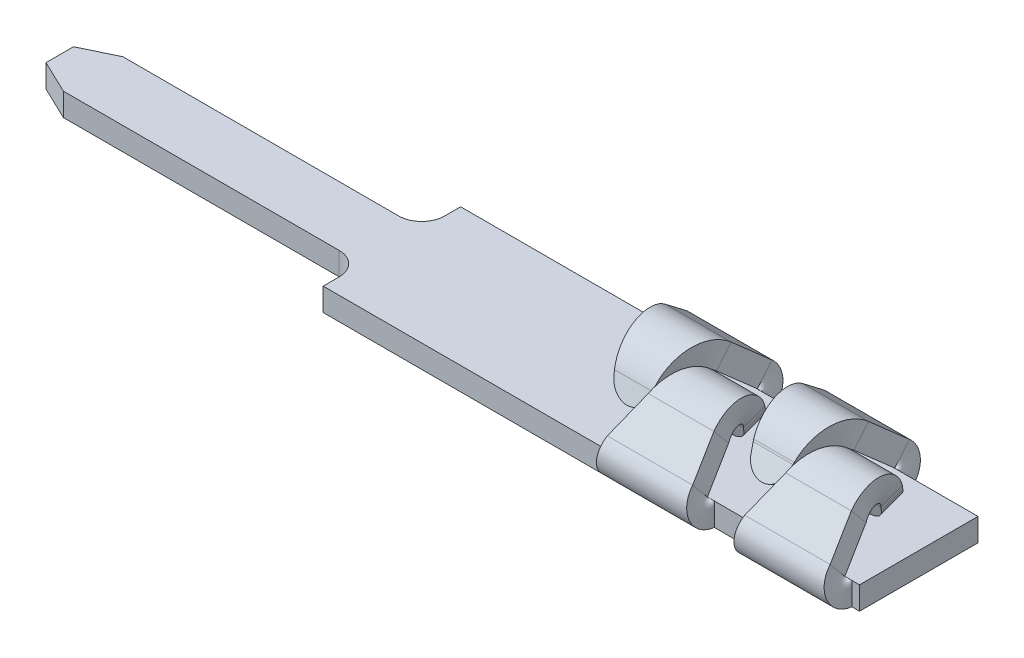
ISO-10303-21;
HEADER;
FILE_DESCRIPTION(('STEP AP214'),'2;1');
FILE_NAME('part.step','',(''),(''),'','','');
FILE_SCHEMA(('AUTOMOTIVE_DESIGN { 1 0 10303 214 1 1 1 1 }'));
ENDSEC;
DATA;
#1=APPLICATION_CONTEXT('core data for automotive mechanical design processes');
#2=APPLICATION_PROTOCOL_DEFINITION('international standard','automotive_design',2000,#1);
#3=PRODUCT_CONTEXT('',#1,'mechanical');
#4=PRODUCT('Part','Part','',(#3));
#5=PRODUCT_RELATED_PRODUCT_CATEGORY('part','',(#4));
#6=PRODUCT_DEFINITION_FORMATION('','',#4);
#7=PRODUCT_DEFINITION_CONTEXT('part definition',#1,'design');
#8=PRODUCT_DEFINITION('design','',#6,#7);
#9=PRODUCT_DEFINITION_SHAPE('','',#8);
#10=(LENGTH_UNIT() NAMED_UNIT(*) SI_UNIT(.MILLI.,.METRE.));
#11=(NAMED_UNIT(*) PLANE_ANGLE_UNIT() SI_UNIT($,.RADIAN.));
#12=(NAMED_UNIT(*) SI_UNIT($,.STERADIAN.) SOLID_ANGLE_UNIT());
#13=UNCERTAINTY_MEASURE_WITH_UNIT(LENGTH_MEASURE(1.E-05),#10,'distance_accuracy_value','');
#14=(GEOMETRIC_REPRESENTATION_CONTEXT(3) GLOBAL_UNCERTAINTY_ASSIGNED_CONTEXT((#13)) GLOBAL_UNIT_ASSIGNED_CONTEXT((#10,
#11,#12)) REPRESENTATION_CONTEXT('',''));
#15=CARTESIAN_POINT('',(0.,0.,0.));
#16=DIRECTION('',(0.,0.,1.));
#17=DIRECTION('',(1.,0.,0.));
#18=AXIS2_PLACEMENT_3D('',#15,#16,#17);
#19=CARTESIAN_POINT('',(-3.175,0.202506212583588,-1.11626923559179));
#20=DIRECTION('',(0.,0.766044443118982,-0.642787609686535));
#21=DIRECTION('',(0.,0.642787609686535,0.766044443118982));
#22=AXIS2_PLACEMENT_3D('',#19,#20,#21);
#23=PLANE('',#22);
#24=DIRECTION('',(-0.236130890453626,-0.624610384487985,-0.744381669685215));
#25=VECTOR('',#24,1.);
#26=CARTESIAN_POINT('',(1.32654624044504,1.17975022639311,0.0483648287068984));
#27=LINE('',#26,#25);
#28=CARTESIAN_POINT('',(1.15999180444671,0.739182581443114,-0.476683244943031));
#29=VERTEX_POINT('',#28);
#30=CARTESIAN_POINT('',(1.05079678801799,0.45034133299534,-0.820910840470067));
#31=VERTEX_POINT('',#30);
#32=EDGE_CURVE('E169',#29,#31,#27,.T.);
#33=ORIENTED_EDGE('',*,*,#32,.F.);
#34=DIRECTION('',(1.,0.,0.));
#35=VECTOR('',#34,1.);
#36=CARTESIAN_POINT('',(-3.175,0.739182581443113,-0.476683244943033));
#37=LINE('',#36,#35);
#38=CARTESIAN_POINT('',(1.88800819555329,0.739182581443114,-0.476683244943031));
#39=VERTEX_POINT('',#38);
#40=EDGE_CURVE('E162',#29,#39,#37,.T.);
#41=ORIENTED_EDGE('',*,*,#40,.T.);
#42=DIRECTION('',(-0.236130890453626,0.624610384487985,0.744381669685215));
#43=VECTOR('',#42,1.);
#44=CARTESIAN_POINT('',(2.07320546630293,0.249301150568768,-1.06050120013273));
#45=LINE('',#44,#43);
#46=CARTESIAN_POINT('',(1.997203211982,0.450341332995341,-0.820910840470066));
#47=VERTEX_POINT('',#46);
#48=EDGE_CURVE('E177',#47,#39,#45,.T.);
#49=ORIENTED_EDGE('',*,*,#48,.F.);
#50=DIRECTION('',(1.,0.,0.));
#51=VECTOR('',#50,1.);
#52=CARTESIAN_POINT('',(-3.175,0.45034133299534,-0.820910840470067));
#53=LINE('',#52,#51);
#54=EDGE_CURVE('E1850',#31,#47,#53,.T.);
#55=ORIENTED_EDGE('',*,*,#54,.F.);
#56=EDGE_LOOP('',(#33,#41,#49,#55));
#57=FACE_BOUND('',#56,.T.);
#58=ADVANCED_FACE('F150',(#57),#23,.T.);
#59=CARTESIAN_POINT('',(-0.197453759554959,0.985174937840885,0.211632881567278));
#60=DIRECTION('',(0.971721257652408,-0.151782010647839,-0.180886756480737));
#61=DIRECTION('',(0.236130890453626,0.624610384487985,0.744381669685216));
#62=AXIS2_PLACEMENT_3D('',#59,#60,#61);
#63=PLANE('',#62);
#64=DIRECTION('',(-0.236130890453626,-0.624610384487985,-0.744381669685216));
#65=VECTOR('',#64,1.);
#66=CARTESIAN_POINT('',(-0.197453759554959,0.985174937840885,0.211632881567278));
#67=LINE('',#66,#65);
#68=CARTESIAN_POINT('',(-0.364008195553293,0.544607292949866,-0.313415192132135));
#69=VERTEX_POINT('',#68);
#70=CARTESIAN_POINT('',(-0.473203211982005,0.255766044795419,-0.657642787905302));
#71=VERTEX_POINT('',#70);
#72=EDGE_CURVE('E1775',#69,#71,#67,.T.);
#73=ORIENTED_EDGE('',*,*,#72,.F.);
#74=CARTESIAN_POINT('',(-0.364008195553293,0.739182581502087,-0.476683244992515));
#75=CARTESIAN_POINT('',(-0.364008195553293,0.544607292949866,-0.313415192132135));
#76=B_SPLINE_CURVE_WITH_KNOTS('',1,(#74,#75),.UNSPECIFIED.,.F.,.F.,(2,2),(0.,1.),.UNSPECIFIED.);
#77=CARTESIAN_POINT('',(-0.364008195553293,0.739182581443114,-0.476683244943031));
#78=VERTEX_POINT('',#77);
#79=EDGE_CURVE('E810',#69,#78,#76,.F.);
#80=ORIENTED_EDGE('',*,*,#79,.T.);
#81=DIRECTION('',(-0.236130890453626,-0.624610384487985,-0.744381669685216));
#82=VECTOR('',#81,1.);
#83=CARTESIAN_POINT('',(-0.197453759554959,1.17975022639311,0.0483648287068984));
#84=LINE('',#83,#82);
#85=CARTESIAN_POINT('',(-0.473203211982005,0.45034133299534,-0.820910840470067));
#86=VERTEX_POINT('',#85);
#87=EDGE_CURVE('E3173',#78,#86,#84,.T.);
#88=ORIENTED_EDGE('',*,*,#87,.T.);
#89=CARTESIAN_POINT('',(-0.473203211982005,0.255766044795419,-0.657642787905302));
#90=CARTESIAN_POINT('',(-0.473203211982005,0.450341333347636,-0.820910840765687));
#91=B_SPLINE_CURVE_WITH_KNOTS('',1,(#89,#90),.UNSPECIFIED.,.F.,.F.,(2,2),(0.,1.),.UNSPECIFIED.);
#92=EDGE_CURVE('E3028',#86,#71,#91,.F.);
#93=ORIENTED_EDGE('',*,*,#92,.T.);
#94=EDGE_LOOP('',(#73,#80,#88,#93));
#95=FACE_BOUND('',#94,.T.);
#96=ADVANCED_FACE('F1802',(#95),#63,.F.);
#97=CARTESIAN_POINT('',(0.549205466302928,0.0547258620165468,-0.897233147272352));
#98=DIRECTION('',(-0.971721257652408,-0.15178201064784,-0.180886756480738));
#99=DIRECTION('',(0.236130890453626,-0.624610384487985,-0.744381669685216));
#100=AXIS2_PLACEMENT_3D('',#97,#98,#99);
#101=PLANE('',#100);
#102=DIRECTION('',(-0.236130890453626,0.624610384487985,0.744381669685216));
#103=VECTOR('',#102,1.);
#104=CARTESIAN_POINT('',(0.549205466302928,0.249301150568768,-1.06050120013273));
#105=LINE('',#104,#103);
#106=CARTESIAN_POINT('',(0.473203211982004,0.45034133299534,-0.820910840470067));
#107=VERTEX_POINT('',#106);
#108=CARTESIAN_POINT('',(0.364008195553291,0.739182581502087,-0.476683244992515));
#109=VERTEX_POINT('',#108);
#110=EDGE_CURVE('E3172',#107,#109,#105,.T.);
#111=ORIENTED_EDGE('',*,*,#110,.T.);
#112=CARTESIAN_POINT('',(0.364008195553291,0.544607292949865,-0.313415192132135));
#113=CARTESIAN_POINT('',(0.364008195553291,0.739182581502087,-0.476683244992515));
#114=B_SPLINE_CURVE_WITH_KNOTS('',1,(#112,#113),.UNSPECIFIED.,.F.,.F.,(2,2),(0.,1.),.UNSPECIFIED.);
#115=CARTESIAN_POINT('',(0.364008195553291,0.544607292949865,-0.313415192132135));
#116=VERTEX_POINT('',#115);
#117=EDGE_CURVE('E796',#109,#116,#114,.F.);
#118=ORIENTED_EDGE('',*,*,#117,.T.);
#119=DIRECTION('',(-0.236130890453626,0.624610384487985,0.744381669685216));
#120=VECTOR('',#119,1.);
#121=CARTESIAN_POINT('',(0.549205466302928,0.0547258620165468,-0.897233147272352));
#122=LINE('',#121,#120);
#123=CARTESIAN_POINT('',(0.473203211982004,0.255766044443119,-0.657642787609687));
#124=VERTEX_POINT('',#123);
#125=EDGE_CURVE('E1774',#124,#116,#122,.T.);
#126=ORIENTED_EDGE('',*,*,#125,.F.);
#127=CARTESIAN_POINT('',(0.473203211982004,0.450341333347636,-0.820910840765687));
#128=CARTESIAN_POINT('',(0.473203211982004,0.255766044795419,-0.657642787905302));
#129=B_SPLINE_CURVE_WITH_KNOTS('',1,(#127,#128),.UNSPECIFIED.,.F.,.F.,(2,2),(0.,1.),.UNSPECIFIED.);
#130=EDGE_CURVE('E1781',#124,#107,#129,.F.);
#131=ORIENTED_EDGE('',*,*,#130,.T.);
#132=EDGE_LOOP('',(#111,#118,#126,#131));
#133=FACE_BOUND('',#132,.T.);
#134=ADVANCED_FACE('F1812',(#133),#101,.F.);
#135=CARTESIAN_POINT('',(-3.175,0.00793092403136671,-0.953001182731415));
#136=DIRECTION('',(0.,0.766044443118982,-0.642787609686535));
#137=DIRECTION('',(0.,0.642787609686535,0.766044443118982));
#138=AXIS2_PLACEMENT_3D('',#135,#136,#137);
#139=PLANE('',#138);
#140=ORIENTED_EDGE('',*,*,#125,.T.);
#141=DIRECTION('',(-1.,0.,0.));
#142=VECTOR('',#141,1.);
#143=CARTESIAN_POINT('',(-3.175,0.544607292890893,-0.313415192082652));
#144=LINE('',#143,#142);
#145=EDGE_CURVE('E1800',#116,#69,#144,.T.);
#146=ORIENTED_EDGE('',*,*,#145,.T.);
#147=ORIENTED_EDGE('',*,*,#72,.T.);
#148=DIRECTION('',(1.,0.,0.));
#149=VECTOR('',#148,1.);
#150=CARTESIAN_POINT('',(-3.175,0.255766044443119,-0.657642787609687));
#151=LINE('',#150,#149);
#152=EDGE_CURVE('E1772',#71,#124,#151,.T.);
#153=ORIENTED_EDGE('',*,*,#152,.T.);
#154=EDGE_LOOP('',(#140,#146,#147,#153));
#155=FACE_BOUND('',#154,.T.);
#156=ADVANCED_FACE('F2080',(#155),#139,.F.);
#157=CARTESIAN_POINT('',(-3.175,-0.54852683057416,2.01131556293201));
#158=DIRECTION('',(0.,0.766044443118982,0.642787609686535));
#159=DIRECTION('',(0.,-0.642787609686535,0.766044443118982));
#160=AXIS2_PLACEMENT_3D('',#157,#158,#159);
#161=PLANE('',#160);
#162=DIRECTION('',(0.236130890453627,-0.624610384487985,0.744381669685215));
#163=VECTOR('',#162,1.);
#164=CARTESIAN_POINT('',(2.48345375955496,1.1797502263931,-0.0483648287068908));
#165=LINE('',#164,#163);
#166=CARTESIAN_POINT('',(2.65000819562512,0.739182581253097,0.476683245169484));
#167=VERTEX_POINT('',#166);
#168=CARTESIAN_POINT('',(2.759203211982,0.450341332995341,0.820910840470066));
#169=VERTEX_POINT('',#168);
#170=EDGE_CURVE('E1922',#167,#169,#165,.T.);
#171=ORIENTED_EDGE('',*,*,#170,.F.);
#172=DIRECTION('',(-1.,0.,0.));
#173=VECTOR('',#172,1.);
#174=CARTESIAN_POINT('',(-3.175,0.739182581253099,0.476683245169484));
#175=LINE('',#174,#173);
#176=CARTESIAN_POINT('',(1.92199180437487,0.739182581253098,0.476683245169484));
#177=VERTEX_POINT('',#176);
#178=EDGE_CURVE('E3405',#167,#177,#175,.T.);
#179=ORIENTED_EDGE('',*,*,#178,.T.);
#180=DIRECTION('',(0.236130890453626,0.624610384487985,-0.744381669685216));
#181=VECTOR('',#180,1.);
#182=CARTESIAN_POINT('',(1.73679453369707,0.249301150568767,1.06050120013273));
#183=LINE('',#182,#181);
#184=CARTESIAN_POINT('',(1.812796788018,0.45034133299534,0.820910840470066));
#185=VERTEX_POINT('',#184);
#186=EDGE_CURVE('E1962',#185,#177,#183,.T.);
#187=ORIENTED_EDGE('',*,*,#186,.F.);
#188=DIRECTION('',(1.,0.,0.));
#189=VECTOR('',#188,1.);
#190=CARTESIAN_POINT('',(-3.175,0.45034133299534,0.820910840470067));
#191=LINE('',#190,#189);
#192=EDGE_CURVE('E1957',#185,#169,#191,.T.);
#193=ORIENTED_EDGE('',*,*,#192,.T.);
#194=EDGE_LOOP('',(#171,#179,#187,#193));
#195=FACE_BOUND('',#194,.T.);
#196=ADVANCED_FACE('F2087',(#195),#161,.T.);
#197=CARTESIAN_POINT('',(-3.175,-0.54852683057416,2.01131556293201));
#198=DIRECTION('',(0.,0.766044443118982,0.642787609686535));
#199=DIRECTION('',(0.,-0.642787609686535,0.766044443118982));
#200=AXIS2_PLACEMENT_3D('',#197,#198,#199);
#201=PLANE('',#200);
#202=DIRECTION('',(0.236130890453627,-0.624610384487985,0.744381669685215));
#203=VECTOR('',#202,1.);
#204=CARTESIAN_POINT('',(0.959453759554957,1.1797502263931,-0.0483648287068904));
#205=LINE('',#204,#203);
#206=CARTESIAN_POINT('',(1.12600819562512,0.739182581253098,0.476683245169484));
#207=VERTEX_POINT('',#206);
#208=CARTESIAN_POINT('',(1.235203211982,0.45034133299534,0.820910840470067));
#209=VERTEX_POINT('',#208);
#210=EDGE_CURVE('E1949',#207,#209,#205,.T.);
#211=ORIENTED_EDGE('',*,*,#210,.F.);
#212=DIRECTION('',(-1.,0.,0.));
#213=VECTOR('',#212,1.);
#214=CARTESIAN_POINT('',(-3.175,0.739182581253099,0.476683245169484));
#215=LINE('',#214,#213);
#216=CARTESIAN_POINT('',(0.397991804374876,0.739182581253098,0.476683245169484));
#217=VERTEX_POINT('',#216);
#218=EDGE_CURVE('E3299',#207,#217,#215,.T.);
#219=ORIENTED_EDGE('',*,*,#218,.T.);
#220=DIRECTION('',(0.236130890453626,0.624610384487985,-0.744381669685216));
#221=VECTOR('',#220,1.);
#222=CARTESIAN_POINT('',(0.212794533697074,0.249301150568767,1.06050120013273));
#223=LINE('',#222,#221);
#224=CARTESIAN_POINT('',(0.288796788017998,0.45034133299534,0.820910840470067));
#225=VERTEX_POINT('',#224);
#226=EDGE_CURVE('E1944',#225,#217,#223,.T.);
#227=ORIENTED_EDGE('',*,*,#226,.F.);
#228=DIRECTION('',(1.,0.,0.));
#229=VECTOR('',#228,1.);
#230=CARTESIAN_POINT('',(-3.175,0.45034133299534,0.820910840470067));
#231=LINE('',#230,#229);
#232=EDGE_CURVE('E1952',#225,#209,#231,.T.);
#233=ORIENTED_EDGE('',*,*,#232,.T.);
#234=EDGE_LOOP('',(#211,#219,#227,#233));
#235=FACE_BOUND('',#234,.T.);
#236=ADVANCED_FACE('F2096',(#235),#201,.T.);
#237=CARTESIAN_POINT('',(-3.175,0.254,-0.5842));
#238=DIRECTION('',(0.,-1.,0.));
#239=DIRECTION('',(0.,0.,-1.));
#240=AXIS2_PLACEMENT_3D('',#237,#238,#239);
#241=PLANE('',#240);
#242=DIRECTION('',(1.,0.,0.));
#243=VECTOR('',#242,1.);
#244=CARTESIAN_POINT('',(0.212794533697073,0.254,0.656999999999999));
#245=LINE('',#244,#243);
#246=CARTESIAN_POINT('',(0.162794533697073,0.254,0.656999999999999));
#247=VERTEX_POINT('',#246);
#248=CARTESIAN_POINT('',(0.212794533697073,0.253999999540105,0.656999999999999));
#249=VERTEX_POINT('',#248);
#250=EDGE_CURVE('E1603',#247,#249,#245,.T.);
#251=ORIENTED_EDGE('',*,*,#250,.T.);
#252=DIRECTION('',(1.,0.,0.));
#253=VECTOR('',#252,1.);
#254=CARTESIAN_POINT('',(-3.175,0.254,0.657000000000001));
#255=LINE('',#254,#253);
#256=CARTESIAN_POINT('',(1.31120546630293,0.253999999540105,0.656999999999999));
#257=VERTEX_POINT('',#256);
#258=EDGE_CURVE('E1890',#249,#257,#255,.T.);
#259=ORIENTED_EDGE('',*,*,#258,.T.);
#260=DIRECTION('',(1.,0.,0.));
#261=VECTOR('',#260,1.);
#262=CARTESIAN_POINT('',(1.31120546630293,0.254,0.656999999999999));
#263=LINE('',#262,#261);
#264=CARTESIAN_POINT('',(1.73679453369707,0.253999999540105,0.656999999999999));
#265=VERTEX_POINT('',#264);
#266=EDGE_CURVE('E3040',#257,#265,#263,.T.);
#267=ORIENTED_EDGE('',*,*,#266,.T.);
#268=DIRECTION('',(1.,0.,0.));
#269=VECTOR('',#268,1.);
#270=CARTESIAN_POINT('',(-3.175,0.254,0.657000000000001));
#271=LINE('',#270,#269);
#272=CARTESIAN_POINT('',(2.83520546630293,0.253999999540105,0.656999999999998));
#273=VERTEX_POINT('',#272);
#274=EDGE_CURVE('E3076',#265,#273,#271,.T.);
#275=ORIENTED_EDGE('',*,*,#274,.T.);
#276=DIRECTION('',(1.,0.,0.));
#277=VECTOR('',#276,1.);
#278=CARTESIAN_POINT('',(2.83520546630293,0.254,0.656999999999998));
#279=LINE('',#278,#277);
#280=CARTESIAN_POINT('',(2.921,0.254,0.656999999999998));
#281=VERTEX_POINT('',#280);
#282=EDGE_CURVE('E1607',#273,#281,#279,.T.);
#283=ORIENTED_EDGE('',*,*,#282,.T.);
#284=DIRECTION('',(0.,0.,-1.));
#285=VECTOR('',#284,1.);
#286=CARTESIAN_POINT('',(2.921,0.254,-0.657000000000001));
#287=LINE('',#286,#285);
#288=CARTESIAN_POINT('',(2.921,0.254,-0.657000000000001));
#289=VERTEX_POINT('',#288);
#290=EDGE_CURVE('E1604',#281,#289,#287,.T.);
#291=ORIENTED_EDGE('',*,*,#290,.T.);
#292=DIRECTION('',(-1.,0.,0.));
#293=VECTOR('',#292,1.);
#294=CARTESIAN_POINT('',(2.07320546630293,0.254,-0.657));
#295=LINE('',#294,#293);
#296=CARTESIAN_POINT('',(2.07320546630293,0.253999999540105,-0.657));
#297=VERTEX_POINT('',#296);
#298=EDGE_CURVE('E1606',#289,#297,#295,.T.);
#299=ORIENTED_EDGE('',*,*,#298,.T.);
#300=DIRECTION('',(1.,0.,0.));
#301=VECTOR('',#300,1.);
#302=CARTESIAN_POINT('',(-3.175,0.254,-0.657));
#303=LINE('',#302,#301);
#304=CARTESIAN_POINT('',(0.974794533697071,0.253999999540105,-0.657));
#305=VERTEX_POINT('',#304);
#306=EDGE_CURVE('E1744',#305,#297,#303,.T.);
#307=ORIENTED_EDGE('',*,*,#306,.F.);
#308=DIRECTION('',(-1.,0.,0.));
#309=VECTOR('',#308,1.);
#310=CARTESIAN_POINT('',(0.549205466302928,0.254,-0.657));
#311=LINE('',#310,#309);
#312=CARTESIAN_POINT('',(0.549205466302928,0.253999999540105,-0.657));
#313=VERTEX_POINT('',#312);
#314=EDGE_CURVE('E1754',#305,#313,#311,.T.);
#315=ORIENTED_EDGE('',*,*,#314,.T.);
#316=DIRECTION('',(1.,0.,0.));
#317=VECTOR('',#316,1.);
#318=CARTESIAN_POINT('',(-3.175,0.254,-0.657));
#319=LINE('',#318,#317);
#320=CARTESIAN_POINT('',(-0.549205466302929,0.253999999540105,-0.657));
#321=VERTEX_POINT('',#320);
#322=EDGE_CURVE('E1693',#321,#313,#319,.T.);
#323=ORIENTED_EDGE('',*,*,#322,.F.);
#324=DIRECTION('',(-1.,0.,0.));
#325=VECTOR('',#324,1.);
#326=CARTESIAN_POINT('',(-0.549205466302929,0.254,-0.657));
#327=LINE('',#326,#325);
#328=CARTESIAN_POINT('',(-0.599205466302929,0.254,-0.657));
#329=VERTEX_POINT('',#328);
#330=EDGE_CURVE('E1611',#321,#329,#327,.T.);
#331=ORIENTED_EDGE('',*,*,#330,.T.);
#332=DIRECTION('',(0.,0.,-1.));
#333=VECTOR('',#332,1.);
#334=CARTESIAN_POINT('',(-0.599205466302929,0.254,-0.657));
#335=LINE('',#334,#333);
#336=CARTESIAN_POINT('',(-0.599205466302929,0.254,-0.762));
#337=VERTEX_POINT('',#336);
#338=EDGE_CURVE('E1608',#329,#337,#335,.T.);
#339=ORIENTED_EDGE('',*,*,#338,.T.);
#340=DIRECTION('',(-1.,0.,0.));
#341=VECTOR('',#340,1.);
#342=CARTESIAN_POINT('',(-2.921,0.254,-0.762));
#343=LINE('',#342,#341);
#344=CARTESIAN_POINT('',(-2.921,0.254,-0.762));
#345=VERTEX_POINT('',#344);
#346=EDGE_CURVE('E1610',#337,#345,#343,.T.);
#347=ORIENTED_EDGE('',*,*,#346,.T.);
#348=DIRECTION('',(0.,0.,1.));
#349=VECTOR('',#348,1.);
#350=CARTESIAN_POINT('',(-2.921,0.254,-0.762));
#351=LINE('',#350,#349);
#352=CARTESIAN_POINT('',(-2.921,0.254,-0.584200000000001));
#353=VERTEX_POINT('',#352);
#354=EDGE_CURVE('E1574',#345,#353,#351,.T.);
#355=ORIENTED_EDGE('',*,*,#354,.T.);
#356=CARTESIAN_POINT('',(-3.175,0.254,-0.5842));
#357=DIRECTION('',(0.,-1.,0.));
#358=DIRECTION('',(0.,0.,-1.));
#359=AXIS2_PLACEMENT_3D('',#356,#357,#358);
#360=CIRCLE('',#359,0.254);
#361=CARTESIAN_POINT('',(-3.175,0.254,-0.3302));
#362=VERTEX_POINT('',#361);
#363=EDGE_CURVE('E1582',#353,#362,#360,.T.);
#364=ORIENTED_EDGE('',*,*,#363,.T.);
#365=DIRECTION('',(-1.,0.,0.));
#366=VECTOR('',#365,1.);
#367=CARTESIAN_POINT('',(-3.175,0.254,-0.3302));
#368=LINE('',#367,#366);
#369=CARTESIAN_POINT('',(-6.23380406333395,0.254,-0.330199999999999));
#370=VERTEX_POINT('',#369);
#371=EDGE_CURVE('E1585',#362,#370,#368,.T.);
#372=ORIENTED_EDGE('',*,*,#371,.T.);
#373=DIRECTION('',(-0.901422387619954,0.,0.432940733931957));
#374=VECTOR('',#373,1.);
#375=CARTESIAN_POINT('',(-6.23380406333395,0.254,-0.330199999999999));
#376=LINE('',#375,#374);
#377=CARTESIAN_POINT('',(-6.604,0.254,-0.1524));
#378=VERTEX_POINT('',#377);
#379=EDGE_CURVE('E1587',#370,#378,#376,.T.);
#380=ORIENTED_EDGE('',*,*,#379,.T.);
#381=DIRECTION('',(0.,0.,1.));
#382=VECTOR('',#381,1.);
#383=CARTESIAN_POINT('',(-6.604,0.254,-0.1524));
#384=LINE('',#383,#382);
#385=CARTESIAN_POINT('',(-6.604,0.254,0.1524));
#386=VERTEX_POINT('',#385);
#387=EDGE_CURVE('E1589',#378,#386,#384,.T.);
#388=ORIENTED_EDGE('',*,*,#387,.T.);
#389=DIRECTION('',(0.901422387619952,0.,0.43294073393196));
#390=VECTOR('',#389,1.);
#391=CARTESIAN_POINT('',(-6.23380406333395,0.254,0.330200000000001));
#392=LINE('',#391,#390);
#393=CARTESIAN_POINT('',(-6.23380406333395,0.254,0.330200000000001));
#394=VERTEX_POINT('',#393);
#395=EDGE_CURVE('E1591',#386,#394,#392,.T.);
#396=ORIENTED_EDGE('',*,*,#395,.T.);
#397=DIRECTION('',(1.,0.,0.));
#398=VECTOR('',#397,1.);
#399=CARTESIAN_POINT('',(-6.23380406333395,0.254,0.330200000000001));
#400=LINE('',#399,#398);
#401=CARTESIAN_POINT('',(-3.175,0.254,0.330200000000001));
#402=VERTEX_POINT('',#401);
#403=EDGE_CURVE('E1593',#394,#402,#400,.T.);
#404=ORIENTED_EDGE('',*,*,#403,.T.);
#405=CARTESIAN_POINT('',(-3.175,0.254,0.584200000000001));
#406=DIRECTION('',(0.,-1.,0.));
#407=DIRECTION('',(0.,0.,1.));
#408=AXIS2_PLACEMENT_3D('',#405,#406,#407);
#409=CIRCLE('',#408,0.254);
#410=CARTESIAN_POINT('',(-2.921,0.254,0.584200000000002));
#411=VERTEX_POINT('',#410);
#412=EDGE_CURVE('E1595',#402,#411,#409,.T.);
#413=ORIENTED_EDGE('',*,*,#412,.T.);
#414=DIRECTION('',(0.,0.,1.));
#415=VECTOR('',#414,1.);
#416=CARTESIAN_POINT('',(-2.921,0.254,0.584200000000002));
#417=LINE('',#416,#415);
#418=CARTESIAN_POINT('',(-2.921,0.254,0.762));
#419=VERTEX_POINT('',#418);
#420=EDGE_CURVE('E1597',#411,#419,#417,.T.);
#421=ORIENTED_EDGE('',*,*,#420,.T.);
#422=DIRECTION('',(1.,0.,0.));
#423=VECTOR('',#422,1.);
#424=CARTESIAN_POINT('',(-2.921,0.254,0.762));
#425=LINE('',#424,#423);
#426=CARTESIAN_POINT('',(0.162794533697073,0.254,0.762));
#427=VERTEX_POINT('',#426);
#428=EDGE_CURVE('E1599',#419,#427,#425,.T.);
#429=ORIENTED_EDGE('',*,*,#428,.T.);
#430=DIRECTION('',(0.,0.,-1.));
#431=VECTOR('',#430,1.);
#432=CARTESIAN_POINT('',(0.162794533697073,0.254,0.656999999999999));
#433=LINE('',#432,#431);
#434=EDGE_CURVE('E1601',#427,#247,#433,.T.);
#435=ORIENTED_EDGE('',*,*,#434,.T.);
#436=EDGE_LOOP('',(#251,#259,#267,#275,#283,#291,#299,#307,#315,#323,#331,#339,#347,#355,#364,
#372,#380,#388,#396,#404,#413,#421,#429,#435));
#437=FACE_BOUND('',#436,.T.);
#438=ADVANCED_FACE('F2104',(#437),#241,.F.);
#439=CARTESIAN_POINT('',(-3.175,0.,-0.5842));
#440=DIRECTION('',(0.,-1.,0.));
#441=DIRECTION('',(0.,0.,-1.));
#442=AXIS2_PLACEMENT_3D('',#439,#440,#441);
#443=PLANE('',#442);
#444=DIRECTION('',(1.,0.,0.));
#445=VECTOR('',#444,1.);
#446=CARTESIAN_POINT('',(-3.175,0.,0.657000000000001));
#447=LINE('',#446,#445);
#448=CARTESIAN_POINT('',(0.212794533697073,-4.59895468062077E-10,0.656999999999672));
#449=VERTEX_POINT('',#448);
#450=CARTESIAN_POINT('',(1.31120546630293,0.,0.656999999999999));
#451=VERTEX_POINT('',#450);
#452=EDGE_CURVE('E1869',#449,#451,#447,.T.);
#453=ORIENTED_EDGE('',*,*,#452,.F.);
#454=DIRECTION('',(1.,0.,0.));
#455=VECTOR('',#454,1.);
#456=CARTESIAN_POINT('',(0.212794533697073,0.,0.656999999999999));
#457=LINE('',#456,#455);
#458=CARTESIAN_POINT('',(0.162794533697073,0.,0.656999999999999));
#459=VERTEX_POINT('',#458);
#460=EDGE_CURVE('E1637',#459,#449,#457,.T.);
#461=ORIENTED_EDGE('',*,*,#460,.F.);
#462=DIRECTION('',(0.,0.,-1.));
#463=VECTOR('',#462,1.);
#464=CARTESIAN_POINT('',(0.162794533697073,0.,0.656999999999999));
#465=LINE('',#464,#463);
#466=CARTESIAN_POINT('',(0.162794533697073,0.,0.762));
#467=VERTEX_POINT('',#466);
#468=EDGE_CURVE('E1635',#467,#459,#465,.T.);
#469=ORIENTED_EDGE('',*,*,#468,.F.);
#470=DIRECTION('',(1.,0.,0.));
#471=VECTOR('',#470,1.);
#472=CARTESIAN_POINT('',(-2.921,0.,0.762));
#473=LINE('',#472,#471);
#474=CARTESIAN_POINT('',(-2.921,0.,0.762));
#475=VERTEX_POINT('',#474);
#476=EDGE_CURVE('E1633',#475,#467,#473,.T.);
#477=ORIENTED_EDGE('',*,*,#476,.F.);
#478=DIRECTION('',(0.,0.,1.));
#479=VECTOR('',#478,1.);
#480=CARTESIAN_POINT('',(-2.921,0.,0.584200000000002));
#481=LINE('',#480,#479);
#482=CARTESIAN_POINT('',(-2.921,0.,0.584200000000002));
#483=VERTEX_POINT('',#482);
#484=EDGE_CURVE('E1631',#483,#475,#481,.T.);
#485=ORIENTED_EDGE('',*,*,#484,.F.);
#486=CARTESIAN_POINT('',(-3.175,0.,0.584200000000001));
#487=DIRECTION('',(0.,-1.,0.));
#488=DIRECTION('',(0.,0.,1.));
#489=AXIS2_PLACEMENT_3D('',#486,#487,#488);
#490=CIRCLE('',#489,0.254);
#491=CARTESIAN_POINT('',(-3.175,0.,0.330200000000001));
#492=VERTEX_POINT('',#491);
#493=EDGE_CURVE('E1629',#492,#483,#490,.T.);
#494=ORIENTED_EDGE('',*,*,#493,.F.);
#495=DIRECTION('',(1.,0.,0.));
#496=VECTOR('',#495,1.);
#497=CARTESIAN_POINT('',(-6.23380406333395,0.,0.330200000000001));
#498=LINE('',#497,#496);
#499=CARTESIAN_POINT('',(-6.23380406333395,0.,0.330200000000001));
#500=VERTEX_POINT('',#499);
#501=EDGE_CURVE('E1627',#500,#492,#498,.T.);
#502=ORIENTED_EDGE('',*,*,#501,.F.);
#503=DIRECTION('',(0.901422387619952,0.,0.43294073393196));
#504=VECTOR('',#503,1.);
#505=CARTESIAN_POINT('',(-6.23380406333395,0.,0.330200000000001));
#506=LINE('',#505,#504);
#507=CARTESIAN_POINT('',(-6.604,0.,0.1524));
#508=VERTEX_POINT('',#507);
#509=EDGE_CURVE('E1625',#508,#500,#506,.T.);
#510=ORIENTED_EDGE('',*,*,#509,.F.);
#511=DIRECTION('',(0.,0.,1.));
#512=VECTOR('',#511,1.);
#513=CARTESIAN_POINT('',(-6.604,0.,-0.1524));
#514=LINE('',#513,#512);
#515=CARTESIAN_POINT('',(-6.604,0.,-0.1524));
#516=VERTEX_POINT('',#515);
#517=EDGE_CURVE('E1623',#516,#508,#514,.T.);
#518=ORIENTED_EDGE('',*,*,#517,.F.);
#519=DIRECTION('',(-0.901422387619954,0.,0.432940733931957));
#520=VECTOR('',#519,1.);
#521=CARTESIAN_POINT('',(-6.23380406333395,0.,-0.330199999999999));
#522=LINE('',#521,#520);
#523=CARTESIAN_POINT('',(-6.23380406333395,0.,-0.330199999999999));
#524=VERTEX_POINT('',#523);
#525=EDGE_CURVE('E1621',#524,#516,#522,.T.);
#526=ORIENTED_EDGE('',*,*,#525,.F.);
#527=DIRECTION('',(-1.,0.,0.));
#528=VECTOR('',#527,1.);
#529=CARTESIAN_POINT('',(-3.175,0.,-0.3302));
#530=LINE('',#529,#528);
#531=CARTESIAN_POINT('',(-3.175,0.,-0.3302));
#532=VERTEX_POINT('',#531);
#533=EDGE_CURVE('E1619',#532,#524,#530,.T.);
#534=ORIENTED_EDGE('',*,*,#533,.F.);
#535=CARTESIAN_POINT('',(-3.175,0.,-0.5842));
#536=DIRECTION('',(0.,-1.,0.));
#537=DIRECTION('',(0.,0.,-1.));
#538=AXIS2_PLACEMENT_3D('',#535,#536,#537);
#539=CIRCLE('',#538,0.254);
#540=CARTESIAN_POINT('',(-2.921,0.,-0.584200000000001));
#541=VERTEX_POINT('',#540);
#542=EDGE_CURVE('E1617',#541,#532,#539,.T.);
#543=ORIENTED_EDGE('',*,*,#542,.F.);
#544=DIRECTION('',(0.,0.,1.));
#545=VECTOR('',#544,1.);
#546=CARTESIAN_POINT('',(-2.921,0.,-0.762));
#547=LINE('',#546,#545);
#548=CARTESIAN_POINT('',(-2.921,0.,-0.762));
#549=VERTEX_POINT('',#548);
#550=EDGE_CURVE('E1614',#549,#541,#547,.T.);
#551=ORIENTED_EDGE('',*,*,#550,.F.);
#552=DIRECTION('',(-1.,0.,0.));
#553=VECTOR('',#552,1.);
#554=CARTESIAN_POINT('',(-2.921,0.,-0.762));
#555=LINE('',#554,#553);
#556=CARTESIAN_POINT('',(-0.599205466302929,0.,-0.762));
#557=VERTEX_POINT('',#556);
#558=EDGE_CURVE('E1583',#557,#549,#555,.T.);
#559=ORIENTED_EDGE('',*,*,#558,.F.);
#560=DIRECTION('',(0.,0.,-1.));
#561=VECTOR('',#560,1.);
#562=CARTESIAN_POINT('',(-0.599205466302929,0.,-0.657));
#563=LINE('',#562,#561);
#564=CARTESIAN_POINT('',(-0.599205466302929,0.,-0.657));
#565=VERTEX_POINT('',#564);
#566=EDGE_CURVE('E1642',#565,#557,#563,.T.);
#567=ORIENTED_EDGE('',*,*,#566,.F.);
#568=DIRECTION('',(-1.,0.,0.));
#569=VECTOR('',#568,1.);
#570=CARTESIAN_POINT('',(-0.549205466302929,0.,-0.657));
#571=LINE('',#570,#569);
#572=CARTESIAN_POINT('',(-0.549205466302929,0.,-0.657));
#573=VERTEX_POINT('',#572);
#574=EDGE_CURVE('E1644',#573,#565,#571,.T.);
#575=ORIENTED_EDGE('',*,*,#574,.F.);
#576=DIRECTION('',(1.,0.,0.));
#577=VECTOR('',#576,1.);
#578=CARTESIAN_POINT('',(-3.175,0.,-0.657));
#579=LINE('',#578,#577);
#580=CARTESIAN_POINT('',(0.549205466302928,-4.59895468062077E-10,-0.657));
#581=VERTEX_POINT('',#580);
#582=EDGE_CURVE('E1694',#573,#581,#579,.T.);
#583=ORIENTED_EDGE('',*,*,#582,.T.);
#584=DIRECTION('',(-1.,0.,0.));
#585=VECTOR('',#584,1.);
#586=CARTESIAN_POINT('',(0.549205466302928,0.,-0.657));
#587=LINE('',#586,#585);
#588=CARTESIAN_POINT('',(0.974794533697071,0.,-0.657));
#589=VERTEX_POINT('',#588);
#590=EDGE_CURVE('E1701',#589,#581,#587,.T.);
#591=ORIENTED_EDGE('',*,*,#590,.F.);
#592=DIRECTION('',(1.,0.,0.));
#593=VECTOR('',#592,1.);
#594=CARTESIAN_POINT('',(-3.175,0.,-0.657));
#595=LINE('',#594,#593);
#596=CARTESIAN_POINT('',(2.07320546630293,-4.59895468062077E-10,-0.657));
#597=VERTEX_POINT('',#596);
#598=EDGE_CURVE('E3030',#589,#597,#595,.T.);
#599=ORIENTED_EDGE('',*,*,#598,.T.);
#600=DIRECTION('',(-1.,0.,0.));
#601=VECTOR('',#600,1.);
#602=CARTESIAN_POINT('',(2.07320546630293,0.,-0.657));
#603=LINE('',#602,#601);
#604=CARTESIAN_POINT('',(2.921,0.,-0.657000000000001));
#605=VERTEX_POINT('',#604);
#606=EDGE_CURVE('E1640',#605,#597,#603,.T.);
#607=ORIENTED_EDGE('',*,*,#606,.F.);
#608=DIRECTION('',(0.,0.,-1.));
#609=VECTOR('',#608,1.);
#610=CARTESIAN_POINT('',(2.921,0.,-0.657000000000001));
#611=LINE('',#610,#609);
#612=CARTESIAN_POINT('',(2.921,0.,0.656999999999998));
#613=VERTEX_POINT('',#612);
#614=EDGE_CURVE('E1638',#613,#605,#611,.T.);
#615=ORIENTED_EDGE('',*,*,#614,.F.);
#616=DIRECTION('',(1.,0.,0.));
#617=VECTOR('',#616,1.);
#618=CARTESIAN_POINT('',(2.83520546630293,0.,0.656999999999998));
#619=LINE('',#618,#617);
#620=CARTESIAN_POINT('',(2.83520546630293,0.,0.656999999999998));
#621=VERTEX_POINT('',#620);
#622=EDGE_CURVE('E1641',#621,#613,#619,.T.);
#623=ORIENTED_EDGE('',*,*,#622,.F.);
#624=DIRECTION('',(1.,0.,0.));
#625=VECTOR('',#624,1.);
#626=CARTESIAN_POINT('',(-3.175,0.,0.657000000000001));
#627=LINE('',#626,#625);
#628=CARTESIAN_POINT('',(1.73679453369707,-4.59895468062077E-10,0.656999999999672));
#629=VERTEX_POINT('',#628);
#630=EDGE_CURVE('E3064',#629,#621,#627,.T.);
#631=ORIENTED_EDGE('',*,*,#630,.F.);
#632=DIRECTION('',(1.,0.,0.));
#633=VECTOR('',#632,1.);
#634=CARTESIAN_POINT('',(1.31120546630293,0.,0.656999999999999));
#635=LINE('',#634,#633);
#636=EDGE_CURVE('E1878',#451,#629,#635,.T.);
#637=ORIENTED_EDGE('',*,*,#636,.F.);
#638=EDGE_LOOP('',(#453,#461,#469,#477,#485,#494,#502,#510,#518,#526,#534,#543,#551,#559,#567,
#575,#583,#591,#599,#607,#615,#623,#631,#637));
#639=FACE_BOUND('',#638,.T.);
#640=ADVANCED_FACE('F2113',(#639),#443,.T.);
#641=CARTESIAN_POINT('',(-2.921,0.254,-0.762));
#642=DIRECTION('',(1.,0.,0.));
#643=DIRECTION('',(0.,0.,-1.));
#644=AXIS2_PLACEMENT_3D('',#641,#642,#643);
#645=PLANE('',#644);
#646=ORIENTED_EDGE('',*,*,#550,.T.);
#647=DIRECTION('',(0.,-1.,0.));
#648=VECTOR('',#647,1.);
#649=CARTESIAN_POINT('',(-2.921,0.254,-0.584200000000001));
#650=LINE('',#649,#648);
#651=EDGE_CURVE('E1690',#353,#541,#650,.T.);
#652=ORIENTED_EDGE('',*,*,#651,.F.);
#653=ORIENTED_EDGE('',*,*,#354,.F.);
#654=DIRECTION('',(0.,-1.,0.));
#655=VECTOR('',#654,1.);
#656=CARTESIAN_POINT('',(-2.921,0.254,-0.762));
#657=LINE('',#656,#655);
#658=EDGE_CURVE('E1613',#345,#549,#657,.T.);
#659=ORIENTED_EDGE('',*,*,#658,.T.);
#660=EDGE_LOOP('',(#646,#652,#653,#659));
#661=FACE_BOUND('',#660,.T.);
#662=ADVANCED_FACE('F2122',(#661),#645,.F.);
#663=CARTESIAN_POINT('',(-3.175,0.254,-0.5842));
#664=DIRECTION('',(0.,-1.,0.));
#665=DIRECTION('',(0.,0.,-1.));
#666=AXIS2_PLACEMENT_3D('',#663,#664,#665);
#667=CYLINDRICAL_SURFACE('',#666,0.254);
#668=ORIENTED_EDGE('',*,*,#542,.T.);
#669=DIRECTION('',(0.,-1.,0.));
#670=VECTOR('',#669,1.);
#671=CARTESIAN_POINT('',(-3.175,0.254,-0.3302));
#672=LINE('',#671,#670);
#673=EDGE_CURVE('E1687',#362,#532,#672,.T.);
#674=ORIENTED_EDGE('',*,*,#673,.F.);
#675=ORIENTED_EDGE('',*,*,#363,.F.);
#676=ORIENTED_EDGE('',*,*,#651,.T.);
#677=EDGE_LOOP('',(#668,#674,#675,#676));
#678=FACE_BOUND('',#677,.T.);
#679=ADVANCED_FACE('F2131',(#678),#667,.F.);
#680=CARTESIAN_POINT('',(-3.175,0.254,-0.3302));
#681=DIRECTION('',(0.,0.,1.));
#682=DIRECTION('',(1.,0.,0.));
#683=AXIS2_PLACEMENT_3D('',#680,#681,#682);
#684=PLANE('',#683);
#685=ORIENTED_EDGE('',*,*,#533,.T.);
#686=DIRECTION('',(0.,-1.,0.));
#687=VECTOR('',#686,1.);
#688=CARTESIAN_POINT('',(-6.23380406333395,0.254,-0.330199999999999));
#689=LINE('',#688,#687);
#690=EDGE_CURVE('E1684',#370,#524,#689,.T.);
#691=ORIENTED_EDGE('',*,*,#690,.F.);
#692=ORIENTED_EDGE('',*,*,#371,.F.);
#693=ORIENTED_EDGE('',*,*,#673,.T.);
#694=EDGE_LOOP('',(#685,#691,#692,#693));
#695=FACE_BOUND('',#694,.T.);
#696=ADVANCED_FACE('F2139',(#695),#684,.F.);
#697=CARTESIAN_POINT('',(-6.23380406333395,0.254,-0.330199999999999));
#698=DIRECTION('',(0.432940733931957,0.,0.901422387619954));
#699=DIRECTION('',(0.901422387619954,0.,-0.432940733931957));
#700=AXIS2_PLACEMENT_3D('',#697,#698,#699);
#701=PLANE('',#700);
#702=ORIENTED_EDGE('',*,*,#525,.T.);
#703=DIRECTION('',(0.,-1.,0.));
#704=VECTOR('',#703,1.);
#705=CARTESIAN_POINT('',(-6.604,0.254,-0.1524));
#706=LINE('',#705,#704);
#707=EDGE_CURVE('E1681',#378,#516,#706,.T.);
#708=ORIENTED_EDGE('',*,*,#707,.F.);
#709=ORIENTED_EDGE('',*,*,#379,.F.);
#710=ORIENTED_EDGE('',*,*,#690,.T.);
#711=EDGE_LOOP('',(#702,#708,#709,#710));
#712=FACE_BOUND('',#711,.T.);
#713=ADVANCED_FACE('F2147',(#712),#701,.F.);
#714=CARTESIAN_POINT('',(-6.604,0.254,-0.1524));
#715=DIRECTION('',(1.,0.,0.));
#716=DIRECTION('',(0.,0.,-1.));
#717=AXIS2_PLACEMENT_3D('',#714,#715,#716);
#718=PLANE('',#717);
#719=ORIENTED_EDGE('',*,*,#517,.T.);
#720=DIRECTION('',(0.,-1.,0.));
#721=VECTOR('',#720,1.);
#722=CARTESIAN_POINT('',(-6.604,0.254,0.1524));
#723=LINE('',#722,#721);
#724=EDGE_CURVE('E1678',#386,#508,#723,.T.);
#725=ORIENTED_EDGE('',*,*,#724,.F.);
#726=ORIENTED_EDGE('',*,*,#387,.F.);
#727=ORIENTED_EDGE('',*,*,#707,.T.);
#728=EDGE_LOOP('',(#719,#725,#726,#727));
#729=FACE_BOUND('',#728,.T.);
#730=ADVANCED_FACE('F2155',(#729),#718,.F.);
#731=CARTESIAN_POINT('',(-6.23380406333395,0.254,0.330200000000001));
#732=DIRECTION('',(0.43294073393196,0.,-0.901422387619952));
#733=DIRECTION('',(-0.901422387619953,0.,-0.43294073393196));
#734=AXIS2_PLACEMENT_3D('',#731,#732,#733);
#735=PLANE('',#734);
#736=ORIENTED_EDGE('',*,*,#509,.T.);
#737=DIRECTION('',(0.,-1.,0.));
#738=VECTOR('',#737,1.);
#739=CARTESIAN_POINT('',(-6.23380406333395,0.254,0.330200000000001));
#740=LINE('',#739,#738);
#741=EDGE_CURVE('E1675',#394,#500,#740,.T.);
#742=ORIENTED_EDGE('',*,*,#741,.F.);
#743=ORIENTED_EDGE('',*,*,#395,.F.);
#744=ORIENTED_EDGE('',*,*,#724,.T.);
#745=EDGE_LOOP('',(#736,#742,#743,#744));
#746=FACE_BOUND('',#745,.T.);
#747=ADVANCED_FACE('F2163',(#746),#735,.F.);
#748=CARTESIAN_POINT('',(-6.23380406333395,0.254,0.330200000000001));
#749=DIRECTION('',(0.,0.,-1.));
#750=DIRECTION('',(-1.,0.,0.));
#751=AXIS2_PLACEMENT_3D('',#748,#749,#750);
#752=PLANE('',#751);
#753=ORIENTED_EDGE('',*,*,#501,.T.);
#754=DIRECTION('',(0.,-1.,0.));
#755=VECTOR('',#754,1.);
#756=CARTESIAN_POINT('',(-3.175,0.254,0.330200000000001));
#757=LINE('',#756,#755);
#758=EDGE_CURVE('E1672',#402,#492,#757,.T.);
#759=ORIENTED_EDGE('',*,*,#758,.F.);
#760=ORIENTED_EDGE('',*,*,#403,.F.);
#761=ORIENTED_EDGE('',*,*,#741,.T.);
#762=EDGE_LOOP('',(#753,#759,#760,#761));
#763=FACE_BOUND('',#762,.T.);
#764=ADVANCED_FACE('F2171',(#763),#752,.F.);
#765=CARTESIAN_POINT('',(-3.175,0.254,0.584200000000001));
#766=DIRECTION('',(0.,-1.,0.));
#767=DIRECTION('',(0.,0.,-1.));
#768=AXIS2_PLACEMENT_3D('',#765,#766,#767);
#769=CYLINDRICAL_SURFACE('',#768,0.254);
#770=ORIENTED_EDGE('',*,*,#493,.T.);
#771=DIRECTION('',(0.,-1.,0.));
#772=VECTOR('',#771,1.);
#773=CARTESIAN_POINT('',(-2.921,0.254,0.584200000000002));
#774=LINE('',#773,#772);
#775=EDGE_CURVE('E1669',#411,#483,#774,.T.);
#776=ORIENTED_EDGE('',*,*,#775,.F.);
#777=ORIENTED_EDGE('',*,*,#412,.F.);
#778=ORIENTED_EDGE('',*,*,#758,.T.);
#779=EDGE_LOOP('',(#770,#776,#777,#778));
#780=FACE_BOUND('',#779,.T.);
#781=ADVANCED_FACE('F2179',(#780),#769,.F.);
#782=CARTESIAN_POINT('',(-2.921,0.254,0.584200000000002));
#783=DIRECTION('',(1.,0.,0.));
#784=DIRECTION('',(0.,0.,-1.));
#785=AXIS2_PLACEMENT_3D('',#782,#783,#784);
#786=PLANE('',#785);
#787=ORIENTED_EDGE('',*,*,#484,.T.);
#788=DIRECTION('',(0.,-1.,0.));
#789=VECTOR('',#788,1.);
#790=CARTESIAN_POINT('',(-2.921,0.254,0.762));
#791=LINE('',#790,#789);
#792=EDGE_CURVE('E1666',#419,#475,#791,.T.);
#793=ORIENTED_EDGE('',*,*,#792,.F.);
#794=ORIENTED_EDGE('',*,*,#420,.F.);
#795=ORIENTED_EDGE('',*,*,#775,.T.);
#796=EDGE_LOOP('',(#787,#793,#794,#795));
#797=FACE_BOUND('',#796,.T.);
#798=ADVANCED_FACE('F2187',(#797),#786,.F.);
#799=CARTESIAN_POINT('',(-2.921,0.254,0.762));
#800=DIRECTION('',(0.,0.,-1.));
#801=DIRECTION('',(-1.,0.,0.));
#802=AXIS2_PLACEMENT_3D('',#799,#800,#801);
#803=PLANE('',#802);
#804=ORIENTED_EDGE('',*,*,#476,.T.);
#805=DIRECTION('',(0.,-1.,0.));
#806=VECTOR('',#805,1.);
#807=CARTESIAN_POINT('',(0.162794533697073,0.254,0.762));
#808=LINE('',#807,#806);
#809=EDGE_CURVE('E1663',#427,#467,#808,.T.);
#810=ORIENTED_EDGE('',*,*,#809,.F.);
#811=ORIENTED_EDGE('',*,*,#428,.F.);
#812=ORIENTED_EDGE('',*,*,#792,.T.);
#813=EDGE_LOOP('',(#804,#810,#811,#812));
#814=FACE_BOUND('',#813,.T.);
#815=ADVANCED_FACE('F2195',(#814),#803,.F.);
#816=CARTESIAN_POINT('',(0.162794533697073,0.254,0.656999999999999));
#817=DIRECTION('',(-1.,0.,0.));
#818=DIRECTION('',(0.,0.,1.));
#819=AXIS2_PLACEMENT_3D('',#816,#817,#818);
#820=PLANE('',#819);
#821=ORIENTED_EDGE('',*,*,#468,.T.);
#822=DIRECTION('',(0.,-1.,0.));
#823=VECTOR('',#822,1.);
#824=CARTESIAN_POINT('',(0.162794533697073,0.254,0.656999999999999));
#825=LINE('',#824,#823);
#826=EDGE_CURVE('E1660',#247,#459,#825,.T.);
#827=ORIENTED_EDGE('',*,*,#826,.F.);
#828=ORIENTED_EDGE('',*,*,#434,.F.);
#829=ORIENTED_EDGE('',*,*,#809,.T.);
#830=EDGE_LOOP('',(#821,#827,#828,#829));
#831=FACE_BOUND('',#830,.T.);
#832=ADVANCED_FACE('F2203',(#831),#820,.F.);
#833=CARTESIAN_POINT('',(0.212794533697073,0.254,0.656999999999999));
#834=DIRECTION('',(0.,0.,-1.));
#835=DIRECTION('',(-1.,0.,0.));
#836=AXIS2_PLACEMENT_3D('',#833,#834,#835);
#837=PLANE('',#836);
#838=ORIENTED_EDGE('',*,*,#460,.T.);
#839=CARTESIAN_POINT('',(0.212794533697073,0.253999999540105,0.656999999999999));
#840=CARTESIAN_POINT('',(0.212794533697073,-4.59895468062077E-10,0.656999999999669));
#841=B_SPLINE_CURVE_WITH_KNOTS('',1,(#839,#840),.UNSPECIFIED.,.F.,.F.,(2,2),(0.,1.),.UNSPECIFIED.);
#842=EDGE_CURVE('E1336',#249,#449,#841,.T.);
#843=ORIENTED_EDGE('',*,*,#842,.F.);
#844=ORIENTED_EDGE('',*,*,#250,.F.);
#845=ORIENTED_EDGE('',*,*,#826,.T.);
#846=EDGE_LOOP('',(#838,#843,#844,#845));
#847=FACE_BOUND('',#846,.T.);
#848=ADVANCED_FACE('F1903',(#847),#837,.F.);
#849=CARTESIAN_POINT('',(1.31120546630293,0.254,0.656999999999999));
#850=DIRECTION('',(0.,0.,-1.));
#851=DIRECTION('',(-1.,0.,0.));
#852=AXIS2_PLACEMENT_3D('',#849,#850,#851);
#853=PLANE('',#852);
#854=ORIENTED_EDGE('',*,*,#636,.T.);
#855=CARTESIAN_POINT('',(1.73679453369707,0.253999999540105,0.656999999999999));
#856=CARTESIAN_POINT('',(1.73679453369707,-4.59895468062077E-10,0.656999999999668));
#857=B_SPLINE_CURVE_WITH_KNOTS('',1,(#855,#856),.UNSPECIFIED.,.F.,.F.,(2,2),(0.,1.),.UNSPECIFIED.);
#858=EDGE_CURVE('E1215',#265,#629,#857,.T.);
#859=ORIENTED_EDGE('',*,*,#858,.F.);
#860=ORIENTED_EDGE('',*,*,#266,.F.);
#861=CARTESIAN_POINT('',(1.31120546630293,-4.59895468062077E-10,0.656999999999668));
#862=CARTESIAN_POINT('',(1.31120546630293,0.253999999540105,0.656999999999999));
#863=B_SPLINE_CURVE_WITH_KNOTS('',1,(#861,#862),.UNSPECIFIED.,.F.,.F.,(2,2),(0.,1.),.UNSPECIFIED.);
#864=EDGE_CURVE('E1348',#257,#451,#863,.F.);
#865=ORIENTED_EDGE('',*,*,#864,.T.);
#866=EDGE_LOOP('',(#854,#859,#860,#865));
#867=FACE_BOUND('',#866,.T.);
#868=ADVANCED_FACE('F1892',(#867),#853,.F.);
#869=CARTESIAN_POINT('',(2.83520546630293,0.254,0.656999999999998));
#870=DIRECTION('',(0.,0.,-1.));
#871=DIRECTION('',(-1.,0.,0.));
#872=AXIS2_PLACEMENT_3D('',#869,#870,#871);
#873=PLANE('',#872);
#874=ORIENTED_EDGE('',*,*,#622,.T.);
#875=DIRECTION('',(0.,-1.,0.));
#876=VECTOR('',#875,1.);
#877=CARTESIAN_POINT('',(2.921,0.254,0.656999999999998));
#878=LINE('',#877,#876);
#879=EDGE_CURVE('E1657',#281,#613,#878,.T.);
#880=ORIENTED_EDGE('',*,*,#879,.F.);
#881=ORIENTED_EDGE('',*,*,#282,.F.);
#882=CARTESIAN_POINT('',(2.83520546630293,-4.59895468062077E-10,0.656999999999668));
#883=CARTESIAN_POINT('',(2.83520546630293,0.253999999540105,0.656999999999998));
#884=B_SPLINE_CURVE_WITH_KNOTS('',1,(#882,#883),.UNSPECIFIED.,.F.,.F.,(2,2),(0.,1.),.UNSPECIFIED.);
#885=EDGE_CURVE('E1227',#273,#621,#884,.F.);
#886=ORIENTED_EDGE('',*,*,#885,.T.);
#887=EDGE_LOOP('',(#874,#880,#881,#886));
#888=FACE_BOUND('',#887,.T.);
#889=ADVANCED_FACE('F1902',(#888),#873,.F.);
#890=CARTESIAN_POINT('',(2.921,0.254,-0.657000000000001));
#891=DIRECTION('',(-1.,0.,0.));
#892=DIRECTION('',(0.,0.,1.));
#893=AXIS2_PLACEMENT_3D('',#890,#891,#892);
#894=PLANE('',#893);
#895=ORIENTED_EDGE('',*,*,#614,.T.);
#896=DIRECTION('',(0.,-1.,0.));
#897=VECTOR('',#896,1.);
#898=CARTESIAN_POINT('',(2.921,0.254,-0.657000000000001));
#899=LINE('',#898,#897);
#900=EDGE_CURVE('E1654',#289,#605,#899,.T.);
#901=ORIENTED_EDGE('',*,*,#900,.F.);
#902=ORIENTED_EDGE('',*,*,#290,.F.);
#903=ORIENTED_EDGE('',*,*,#879,.T.);
#904=EDGE_LOOP('',(#895,#901,#902,#903));
#905=FACE_BOUND('',#904,.T.);
#906=ADVANCED_FACE('F2227',(#905),#894,.F.);
#907=CARTESIAN_POINT('',(2.07320546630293,0.254,-0.657));
#908=DIRECTION('',(0.,0.,1.));
#909=DIRECTION('',(1.,0.,0.));
#910=AXIS2_PLACEMENT_3D('',#907,#908,#909);
#911=PLANE('',#910);
#912=ORIENTED_EDGE('',*,*,#606,.T.);
#913=CARTESIAN_POINT('',(2.07320546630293,0.253999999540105,-0.657));
#914=CARTESIAN_POINT('',(2.07320546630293,-4.59895468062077E-10,-0.657));
#915=B_SPLINE_CURVE_WITH_KNOTS('',1,(#913,#914),.UNSPECIFIED.,.F.,.F.,(2,2),(0.,1.),.UNSPECIFIED.);
#916=EDGE_CURVE('E1460',#297,#597,#915,.T.);
#917=ORIENTED_EDGE('',*,*,#916,.F.);
#918=ORIENTED_EDGE('',*,*,#298,.F.);
#919=ORIENTED_EDGE('',*,*,#900,.T.);
#920=EDGE_LOOP('',(#912,#917,#918,#919));
#921=FACE_BOUND('',#920,.T.);
#922=ADVANCED_FACE('F1727',(#921),#911,.F.);
#923=CARTESIAN_POINT('',(0.549205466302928,0.254,-0.657));
#924=DIRECTION('',(0.,0.,1.));
#925=DIRECTION('',(1.,0.,0.));
#926=AXIS2_PLACEMENT_3D('',#923,#924,#925);
#927=PLANE('',#926);
#928=ORIENTED_EDGE('',*,*,#590,.T.);
#929=CARTESIAN_POINT('',(0.549205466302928,0.253999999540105,-0.657));
#930=CARTESIAN_POINT('',(0.549205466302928,-4.59895468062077E-10,-0.657));
#931=B_SPLINE_CURVE_WITH_KNOTS('',1,(#929,#930),.UNSPECIFIED.,.F.,.F.,(2,2),(0.,1.),.UNSPECIFIED.);
#932=EDGE_CURVE('E1570',#313,#581,#931,.T.);
#933=ORIENTED_EDGE('',*,*,#932,.F.);
#934=ORIENTED_EDGE('',*,*,#314,.F.);
#935=CARTESIAN_POINT('',(0.974794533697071,-4.59895468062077E-10,-0.657));
#936=CARTESIAN_POINT('',(0.974794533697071,0.253999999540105,-0.657));
#937=B_SPLINE_CURVE_WITH_KNOTS('',1,(#935,#936),.UNSPECIFIED.,.F.,.F.,(2,2),(0.,1.),.UNSPECIFIED.);
#938=EDGE_CURVE('E3026',#305,#589,#937,.F.);
#939=ORIENTED_EDGE('',*,*,#938,.T.);
#940=EDGE_LOOP('',(#928,#933,#934,#939));
#941=FACE_BOUND('',#940,.T.);
#942=ADVANCED_FACE('F1723',(#941),#927,.F.);
#943=CARTESIAN_POINT('',(-0.549205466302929,0.254,-0.657));
#944=DIRECTION('',(0.,0.,1.));
#945=DIRECTION('',(1.,0.,0.));
#946=AXIS2_PLACEMENT_3D('',#943,#944,#945);
#947=PLANE('',#946);
#948=ORIENTED_EDGE('',*,*,#574,.T.);
#949=DIRECTION('',(0.,-1.,0.));
#950=VECTOR('',#949,1.);
#951=CARTESIAN_POINT('',(-0.599205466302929,0.254,-0.657));
#952=LINE('',#951,#950);
#953=EDGE_CURVE('E1651',#329,#565,#952,.T.);
#954=ORIENTED_EDGE('',*,*,#953,.F.);
#955=ORIENTED_EDGE('',*,*,#330,.F.);
#956=CARTESIAN_POINT('',(-0.549205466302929,-4.59895468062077E-10,-0.657));
#957=CARTESIAN_POINT('',(-0.549205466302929,0.253999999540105,-0.657));
#958=B_SPLINE_CURVE_WITH_KNOTS('',1,(#956,#957),.UNSPECIFIED.,.F.,.F.,(2,2),(0.,1.),.UNSPECIFIED.);
#959=EDGE_CURVE('E1697',#321,#573,#958,.F.);
#960=ORIENTED_EDGE('',*,*,#959,.T.);
#961=EDGE_LOOP('',(#948,#954,#955,#960));
#962=FACE_BOUND('',#961,.T.);
#963=ADVANCED_FACE('F1713',(#962),#947,.F.);
#964=CARTESIAN_POINT('',(-0.599205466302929,0.254,-0.657));
#965=DIRECTION('',(-1.,0.,0.));
#966=DIRECTION('',(0.,0.,1.));
#967=AXIS2_PLACEMENT_3D('',#964,#965,#966);
#968=PLANE('',#967);
#969=ORIENTED_EDGE('',*,*,#566,.T.);
#970=DIRECTION('',(0.,-1.,0.));
#971=VECTOR('',#970,1.);
#972=CARTESIAN_POINT('',(-0.599205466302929,0.254,-0.762));
#973=LINE('',#972,#971);
#974=EDGE_CURVE('E1648',#337,#557,#973,.T.);
#975=ORIENTED_EDGE('',*,*,#974,.F.);
#976=ORIENTED_EDGE('',*,*,#338,.F.);
#977=ORIENTED_EDGE('',*,*,#953,.T.);
#978=EDGE_LOOP('',(#969,#975,#976,#977));
#979=FACE_BOUND('',#978,.T.);
#980=ADVANCED_FACE('F1722',(#979),#968,.F.);
#981=CARTESIAN_POINT('',(-2.921,0.254,-0.762));
#982=DIRECTION('',(0.,0.,1.));
#983=DIRECTION('',(1.,0.,0.));
#984=AXIS2_PLACEMENT_3D('',#981,#982,#983);
#985=PLANE('',#984);
#986=ORIENTED_EDGE('',*,*,#558,.T.);
#987=ORIENTED_EDGE('',*,*,#658,.F.);
#988=ORIENTED_EDGE('',*,*,#346,.F.);
#989=ORIENTED_EDGE('',*,*,#974,.T.);
#990=EDGE_LOOP('',(#986,#987,#988,#989));
#991=FACE_BOUND('',#990,.T.);
#992=ADVANCED_FACE('F1544',(#991),#985,.F.);
#993=CARTESIAN_POINT('',(-0.473203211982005,0.450341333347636,-0.820910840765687));
#994=CARTESIAN_POINT('',(-0.478569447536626,0.42063082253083,-0.856318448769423));
#995=CARTESIAN_POINT('',(-0.484186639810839,0.379935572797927,-0.884654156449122));
#996=CARTESIAN_POINT('',(-0.495891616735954,0.286477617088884,-0.914768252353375));
#997=CARTESIAN_POINT('',(-0.501984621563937,0.233779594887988,-0.916366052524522));
#998=CARTESIAN_POINT('',(-0.514651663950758,0.134049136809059,-0.887416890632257));
#999=CARTESIAN_POINT('',(-0.521225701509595,0.0872775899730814,-0.856729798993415));
#1000=CARTESIAN_POINT('',(-0.534854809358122,0.0200710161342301,-0.770274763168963));
#1001=CARTESIAN_POINT('',(-0.54188648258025,-4.59895468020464E-10,-0.714765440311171));
#1002=CARTESIAN_POINT('',(-0.549205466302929,-4.59895468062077E-10,-0.657));
#1003=CARTESIAN_POINT('',(-0.473203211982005,0.255766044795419,-0.657642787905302));
#1004=CARTESIAN_POINT('',(-0.478574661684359,0.255649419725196,-0.657781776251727));
#1005=CARTESIAN_POINT('',(-0.484186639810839,0.255489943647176,-0.657892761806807));
#1006=CARTESIAN_POINT('',(-0.495891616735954,0.25512344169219,-0.658010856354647));
#1007=CARTESIAN_POINT('',(-0.501984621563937,0.25491678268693,-0.658017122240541));
#1008=CARTESIAN_POINT('',(-0.514651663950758,0.254525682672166,-0.657903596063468));
#1009=CARTESIAN_POINT('',(-0.521225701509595,0.254342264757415,-0.657783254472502));
#1010=CARTESIAN_POINT('',(-0.534854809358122,0.254078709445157,-0.657444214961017));
#1011=CARTESIAN_POINT('',(-0.541909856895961,0.253999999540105,-0.657225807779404));
#1012=CARTESIAN_POINT('',(-0.549205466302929,0.253999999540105,-0.657));
#1013=B_SPLINE_SURFACE_WITH_KNOTS('',1,3,((#993,#994,#995,#996,#997,#998,#999,#1000,#1001,
#1002),(#1003,#1004,#1005,#1006,#1007,#1008,#1009,#1010,#1011,#1012)),.UNSPECIFIED.,.F.,.F.,.F.,
(2,2),(4,2,2,2,4),(0.,1.),(0.,0.25,0.5,0.75,1.),.UNSPECIFIED.);
#1014=CARTESIAN_POINT('',(-0.473203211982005,0.450341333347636,-0.820910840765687));
#1015=CARTESIAN_POINT('',(-0.478569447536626,0.42063082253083,-0.856318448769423));
#1016=CARTESIAN_POINT('',(-0.484186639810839,0.379935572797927,-0.884654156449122));
#1017=CARTESIAN_POINT('',(-0.495891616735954,0.286477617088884,-0.914768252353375));
#1018=CARTESIAN_POINT('',(-0.501984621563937,0.233779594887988,-0.916366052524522));
#1019=CARTESIAN_POINT('',(-0.514651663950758,0.134049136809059,-0.887416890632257));
#1020=CARTESIAN_POINT('',(-0.521225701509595,0.0872775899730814,-0.856729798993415));
#1021=CARTESIAN_POINT('',(-0.534854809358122,0.0200710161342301,-0.770274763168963));
#1022=CARTESIAN_POINT('',(-0.54188648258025,-4.59895468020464E-10,-0.714765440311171));
#1023=CARTESIAN_POINT('',(-0.549205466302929,-4.59895468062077E-10,-0.657));
#1024=B_SPLINE_CURVE_WITH_KNOTS('',3,(#1014,#1015,#1016,#1017,#1018,#1019,#1020,#1021,#1022,
#1023),.UNSPECIFIED.,.F.,.F.,(4,2,2,2,4),(0.,0.25,0.5,0.75,1.),.UNSPECIFIED.);
#1025=EDGE_CURVE('E1489',#86,#573,#1024,.T.);
#1026=CARTESIAN_POINT('',(-0.549205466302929,0.253999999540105,-0.657));
#1027=CARTESIAN_POINT('',(-0.541909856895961,0.253999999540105,-0.657225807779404));
#1028=CARTESIAN_POINT('',(-0.534854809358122,0.254078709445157,-0.657444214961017));
#1029=CARTESIAN_POINT('',(-0.521225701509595,0.254342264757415,-0.657783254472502));
#1030=CARTESIAN_POINT('',(-0.514651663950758,0.254525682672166,-0.657903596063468));
#1031=CARTESIAN_POINT('',(-0.501984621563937,0.25491678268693,-0.658017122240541));
#1032=CARTESIAN_POINT('',(-0.495891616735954,0.25512344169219,-0.658010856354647));
#1033=CARTESIAN_POINT('',(-0.484186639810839,0.255489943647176,-0.657892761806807));
#1034=CARTESIAN_POINT('',(-0.478574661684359,0.255649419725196,-0.657781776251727));
#1035=CARTESIAN_POINT('',(-0.473203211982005,0.255766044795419,-0.657642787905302));
#1036=B_SPLINE_CURVE_WITH_KNOTS('',3,(#1026,#1027,#1028,#1029,#1030,#1031,#1032,#1033,#1034,
#1035),.UNSPECIFIED.,.F.,.F.,(4,2,2,2,4),(0.,0.25,0.5,0.75,1.),.UNSPECIFIED.);
#1037=EDGE_CURVE('E1482',#71,#321,#1036,.F.);
#1038=ORIENTED_EDGE('',*,*,#92,.F.);
#1039=ORIENTED_EDGE('',*,*,#1025,.T.);
#1040=ORIENTED_EDGE('',*,*,#959,.F.);
#1041=ORIENTED_EDGE('',*,*,#1037,.F.);
#1042=EDGE_LOOP('',(#1038,#1039,#1040,#1041));
#1043=FACE_BOUND('',#1042,.T.);
#1044=ADVANCED_FACE('F1504',(#1043),#1013,.F.);
#1045=CARTESIAN_POINT('',(0.549205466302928,-4.59895468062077E-10,-0.657));
#1046=CARTESIAN_POINT('',(0.5438392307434,-4.5989546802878E-10,-0.703221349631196));
#1047=CARTESIAN_POINT('',(0.538222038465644,0.0129605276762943,-0.751086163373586));
#1048=CARTESIAN_POINT('',(0.526517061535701,0.0651965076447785,-0.834228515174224));
#1049=CARTESIAN_POINT('',(0.52042405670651,0.104538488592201,-0.869326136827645));
#1050=CARTESIAN_POINT('',(0.50775701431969,0.199544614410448,-0.911255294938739));
#1051=CARTESIAN_POINT('',(0.50118297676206,0.255098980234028,-0.917811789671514));
#1052=CARTESIAN_POINT('',(0.487553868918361,0.362154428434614,-0.894782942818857));
#1053=CARTESIAN_POINT('',(0.480522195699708,0.413210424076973,-0.865161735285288));
#1054=CARTESIAN_POINT('',(0.473203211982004,0.450341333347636,-0.820910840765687));
#1055=CARTESIAN_POINT('',(0.549205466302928,0.253999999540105,-0.657));
#1056=CARTESIAN_POINT('',(0.543834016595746,0.253999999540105,-0.65718143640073));
#1057=CARTESIAN_POINT('',(0.538222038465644,0.254050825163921,-0.657368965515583));
#1058=CARTESIAN_POINT('',(0.526517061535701,0.254255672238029,-0.657695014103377));
#1059=CARTESIAN_POINT('',(0.52042405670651,0.254409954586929,-0.657832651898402));
#1060=CARTESIAN_POINT('',(0.50775701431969,0.254782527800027,-0.657997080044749));
#1061=CARTESIAN_POINT('',(0.50118297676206,0.255000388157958,-0.658022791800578));
#1062=CARTESIAN_POINT('',(0.487553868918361,0.255420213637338,-0.657932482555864));
#1063=CARTESIAN_POINT('',(0.480498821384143,0.25562089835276,-0.657815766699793));
#1064=CARTESIAN_POINT('',(0.473203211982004,0.255766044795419,-0.657642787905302));
#1065=B_SPLINE_SURFACE_WITH_KNOTS('',1,3,((#1045,#1046,#1047,#1048,#1049,#1050,#1051,#1052,
#1053,#1054),(#1055,#1056,#1057,#1058,#1059,#1060,#1061,#1062,#1063,#1064)),.UNSPECIFIED.,.F.,
.F.,.F.,(2,2),(4,2,2,2,4),(0.,1.),(0.,0.25,0.5,0.75,1.),.UNSPECIFIED.);
#1066=CARTESIAN_POINT('',(0.549205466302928,-4.59895468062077E-10,-0.657));
#1067=CARTESIAN_POINT('',(0.5438392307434,-4.5989546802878E-10,-0.703221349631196));
#1068=CARTESIAN_POINT('',(0.538222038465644,0.0129605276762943,-0.751086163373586));
#1069=CARTESIAN_POINT('',(0.526517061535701,0.0651965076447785,-0.834228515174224));
#1070=CARTESIAN_POINT('',(0.52042405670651,0.104538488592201,-0.869326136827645));
#1071=CARTESIAN_POINT('',(0.50775701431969,0.199544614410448,-0.911255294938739));
#1072=CARTESIAN_POINT('',(0.50118297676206,0.255098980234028,-0.917811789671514));
#1073=CARTESIAN_POINT('',(0.487553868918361,0.362154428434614,-0.894782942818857));
#1074=CARTESIAN_POINT('',(0.480522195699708,0.413210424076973,-0.865161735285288));
#1075=CARTESIAN_POINT('',(0.473203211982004,0.450341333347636,-0.820910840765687));
#1076=B_SPLINE_CURVE_WITH_KNOTS('',3,(#1066,#1067,#1068,#1069,#1070,#1071,#1072,#1073,#1074,
#1075),.UNSPECIFIED.,.F.,.F.,(4,2,2,2,4),(0.,0.25,0.5,0.75,1.),.UNSPECIFIED.);
#1077=EDGE_CURVE('E3164',#581,#107,#1076,.T.);
#1078=CARTESIAN_POINT('',(0.473203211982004,0.255766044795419,-0.657642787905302));
#1079=CARTESIAN_POINT('',(0.480498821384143,0.25562089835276,-0.657815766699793));
#1080=CARTESIAN_POINT('',(0.487553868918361,0.255420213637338,-0.657932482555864));
#1081=CARTESIAN_POINT('',(0.50118297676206,0.255000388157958,-0.658022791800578));
#1082=CARTESIAN_POINT('',(0.50775701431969,0.254782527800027,-0.657997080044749));
#1083=CARTESIAN_POINT('',(0.52042405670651,0.254409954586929,-0.657832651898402));
#1084=CARTESIAN_POINT('',(0.526517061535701,0.254255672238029,-0.657695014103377));
#1085=CARTESIAN_POINT('',(0.538222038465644,0.254050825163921,-0.657368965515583));
#1086=CARTESIAN_POINT('',(0.543834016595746,0.253999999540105,-0.65718143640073));
#1087=CARTESIAN_POINT('',(0.549205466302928,0.253999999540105,-0.657));
#1088=B_SPLINE_CURVE_WITH_KNOTS('',3,(#1078,#1079,#1080,#1081,#1082,#1083,#1084,#1085,#1086,
#1087),.UNSPECIFIED.,.F.,.F.,(4,2,2,2,4),(0.,0.25,0.5,0.75,1.),.UNSPECIFIED.);
#1089=EDGE_CURVE('E1527',#313,#124,#1088,.F.);
#1090=ORIENTED_EDGE('',*,*,#1077,.T.);
#1091=ORIENTED_EDGE('',*,*,#130,.F.);
#1092=ORIENTED_EDGE('',*,*,#1089,.F.);
#1093=ORIENTED_EDGE('',*,*,#932,.T.);
#1094=EDGE_LOOP('',(#1090,#1091,#1092,#1093));
#1095=FACE_BOUND('',#1094,.T.);
#1096=ADVANCED_FACE('F1503',(#1095),#1065,.F.);
#1097=CARTESIAN_POINT('',(1.16997575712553,0.255,-0.657));
#1098=DIRECTION('',(-1.,0.,0.));
#1099=DIRECTION('',(0.,0.,1.));
#1100=AXIS2_PLACEMENT_3D('',#1097,#1098,#1099);
#1101=CYLINDRICAL_SURFACE('',#1100,0.00100000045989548);
#1102=ORIENTED_EDGE('',*,*,#322,.T.);
#1103=ORIENTED_EDGE('',*,*,#1089,.T.);
#1104=ORIENTED_EDGE('',*,*,#152,.F.);
#1105=ORIENTED_EDGE('',*,*,#1037,.T.);
#1106=EDGE_LOOP('',(#1102,#1103,#1104,#1105));
#1107=FACE_BOUND('',#1106,.T.);
#1108=ADVANCED_FACE('F1433',(#1107),#1101,.F.);
#1109=CARTESIAN_POINT('',(1.16997575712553,0.255,-0.657));
#1110=DIRECTION('',(-1.,0.,0.));
#1111=DIRECTION('',(0.,0.,1.));
#1112=AXIS2_PLACEMENT_3D('',#1109,#1110,#1111);
#1113=CYLINDRICAL_SURFACE('',#1112,0.255000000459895);
#1114=ORIENTED_EDGE('',*,*,#582,.F.);
#1115=ORIENTED_EDGE('',*,*,#1025,.F.);
#1116=DIRECTION('',(1.,0.,0.));
#1117=VECTOR('',#1116,1.);
#1118=CARTESIAN_POINT('',(-3.175,0.45034133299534,-0.820910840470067));
#1119=LINE('',#1118,#1117);
#1120=EDGE_CURVE('E1858',#86,#107,#1119,.T.);
#1121=ORIENTED_EDGE('',*,*,#1120,.T.);
#1122=ORIENTED_EDGE('',*,*,#1077,.F.);
#1123=EDGE_LOOP('',(#1114,#1115,#1121,#1122));
#1124=FACE_BOUND('',#1123,.T.);
#1125=ADVANCED_FACE('F1494',(#1124),#1113,.T.);
#1126=CARTESIAN_POINT('',(1.05079678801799,0.450341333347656,-0.820910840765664));
#1127=CARTESIAN_POINT('',(1.04543055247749,0.420630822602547,-0.856318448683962));
#1128=CARTESIAN_POINT('',(1.03981336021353,0.379935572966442,-0.88465415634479));
#1129=CARTESIAN_POINT('',(1.02810838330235,0.28647761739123,-0.914768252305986));
#1130=CARTESIAN_POINT('',(1.02201537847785,0.233779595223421,-0.916366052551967));
#1131=CARTESIAN_POINT('',(1.00934833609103,0.134049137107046,-0.887416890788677));
#1132=CARTESIAN_POINT('',(1.00277429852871,0.087277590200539,-0.856729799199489));
#1133=CARTESIAN_POINT('',(0.989145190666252,0.0200710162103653,-0.770274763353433));
#1134=CARTESIAN_POINT('',(0.982113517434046,-4.59895468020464E-10,-0.714765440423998));
#1135=CARTESIAN_POINT('',(0.974794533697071,-4.59895468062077E-10,-0.657));
#1136=CARTESIAN_POINT('',(1.05079678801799,0.255766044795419,-0.657642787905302));
#1137=CARTESIAN_POINT('',(1.04542533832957,0.255649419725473,-0.657781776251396));
#1138=CARTESIAN_POINT('',(1.03981336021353,0.255489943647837,-0.657892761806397));
#1139=CARTESIAN_POINT('',(1.02810838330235,0.255123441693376,-0.658010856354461));
#1140=CARTESIAN_POINT('',(1.02201537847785,0.254916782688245,-0.658017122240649));
#1141=CARTESIAN_POINT('',(1.00934833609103,0.254525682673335,-0.657903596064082));
#1142=CARTESIAN_POINT('',(1.00277429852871,0.254342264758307,-0.65778325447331));
#1143=CARTESIAN_POINT('',(0.989145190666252,0.254078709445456,-0.65744421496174));
#1144=CARTESIAN_POINT('',(0.982090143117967,0.253999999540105,-0.657225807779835));
#1145=CARTESIAN_POINT('',(0.974794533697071,0.253999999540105,-0.657));
#1146=B_SPLINE_SURFACE_WITH_KNOTS('',1,3,((#1126,#1127,#1128,#1129,#1130,#1131,#1132,#1133,
#1134,#1135),(#1136,#1137,#1138,#1139,#1140,#1141,#1142,#1143,#1144,#1145)),.UNSPECIFIED.,.F.,
.F.,.F.,(2,2),(4,2,2,2,4),(0.,1.),(0.,0.25,0.5,0.75,1.),.UNSPECIFIED.);
#1147=CARTESIAN_POINT('',(1.05079678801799,0.255766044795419,-0.657642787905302));
#1148=CARTESIAN_POINT('',(1.05079678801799,0.450341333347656,-0.820910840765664));
#1149=B_SPLINE_CURVE_WITH_KNOTS('',1,(#1147,#1148),.UNSPECIFIED.,.F.,.F.,(2,2),(0.,1.),.UNSPECIFIED.);
#1150=CARTESIAN_POINT('',(1.05079678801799,0.255766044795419,-0.657642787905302));
#1151=VERTEX_POINT('',#1150);
#1152=EDGE_CURVE('E1854',#31,#1151,#1149,.F.);
#1153=CARTESIAN_POINT('',(1.05079678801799,0.450341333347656,-0.820910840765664));
#1154=CARTESIAN_POINT('',(1.04543055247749,0.420630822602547,-0.856318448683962));
#1155=CARTESIAN_POINT('',(1.03981336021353,0.379935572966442,-0.88465415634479));
#1156=CARTESIAN_POINT('',(1.02810838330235,0.28647761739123,-0.914768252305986));
#1157=CARTESIAN_POINT('',(1.02201537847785,0.233779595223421,-0.916366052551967));
#1158=CARTESIAN_POINT('',(1.00934833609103,0.134049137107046,-0.887416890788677));
#1159=CARTESIAN_POINT('',(1.00277429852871,0.087277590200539,-0.856729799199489));
#1160=CARTESIAN_POINT('',(0.989145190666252,0.0200710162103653,-0.770274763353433));
#1161=CARTESIAN_POINT('',(0.982113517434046,-4.59895468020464E-10,-0.714765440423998));
#1162=CARTESIAN_POINT('',(0.974794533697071,-4.59895468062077E-10,-0.657));
#1163=B_SPLINE_CURVE_WITH_KNOTS('',3,(#1153,#1154,#1155,#1156,#1157,#1158,#1159,#1160,#1161,
#1162),.UNSPECIFIED.,.F.,.F.,(4,2,2,2,4),(0.,0.25,0.5,0.75,1.),.UNSPECIFIED.);
#1164=EDGE_CURVE('E1377',#31,#589,#1163,.T.);
#1165=CARTESIAN_POINT('',(0.974794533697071,0.253999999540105,-0.657));
#1166=CARTESIAN_POINT('',(0.982090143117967,0.253999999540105,-0.657225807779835));
#1167=CARTESIAN_POINT('',(0.989145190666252,0.254078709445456,-0.65744421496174));
#1168=CARTESIAN_POINT('',(1.00277429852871,0.254342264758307,-0.65778325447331));
#1169=CARTESIAN_POINT('',(1.00934833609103,0.254525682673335,-0.657903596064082));
#1170=CARTESIAN_POINT('',(1.02201537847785,0.254916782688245,-0.658017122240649));
#1171=CARTESIAN_POINT('',(1.02810838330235,0.255123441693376,-0.658010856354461));
#1172=CARTESIAN_POINT('',(1.03981336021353,0.255489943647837,-0.657892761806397));
#1173=CARTESIAN_POINT('',(1.04542533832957,0.255649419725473,-0.657781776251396));
#1174=CARTESIAN_POINT('',(1.05079678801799,0.255766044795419,-0.657642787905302));
#1175=B_SPLINE_CURVE_WITH_KNOTS('',3,(#1165,#1166,#1167,#1168,#1169,#1170,#1171,#1172,#1173,
#1174),.UNSPECIFIED.,.F.,.F.,(4,2,2,2,4),(0.,0.25,0.5,0.75,1.),.UNSPECIFIED.);
#1176=EDGE_CURVE('E1370',#1151,#305,#1175,.F.);
#1177=ORIENTED_EDGE('',*,*,#1152,.F.);
#1178=ORIENTED_EDGE('',*,*,#1164,.T.);
#1179=ORIENTED_EDGE('',*,*,#938,.F.);
#1180=ORIENTED_EDGE('',*,*,#1176,.F.);
#1181=EDGE_LOOP('',(#1177,#1178,#1179,#1180));
#1182=FACE_BOUND('',#1181,.T.);
#1183=ADVANCED_FACE('F1393',(#1182),#1146,.F.);
#1184=CARTESIAN_POINT('',(2.07320546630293,-4.59895468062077E-10,-0.657));
#1185=CARTESIAN_POINT('',(2.06783923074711,-4.5989546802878E-10,-0.703221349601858));
#1186=CARTESIAN_POINT('',(2.06222203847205,0.0129605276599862,-0.75108616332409));
#1187=CARTESIAN_POINT('',(2.05051706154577,0.0651965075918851,-0.834228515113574));
#1188=CARTESIAN_POINT('',(2.0444240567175,0.104538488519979,-0.869326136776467));
#1189=CARTESIAN_POINT('',(2.03175701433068,0.199544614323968,-0.911255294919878));
#1190=CARTESIAN_POINT('',(2.02518297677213,0.255098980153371,-0.917811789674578));
#1191=CARTESIAN_POINT('',(2.01155386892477,0.362154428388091,-0.89478294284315));
#1192=CARTESIAN_POINT('',(2.00452219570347,0.413210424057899,-0.865161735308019));
#1193=CARTESIAN_POINT('',(1.997203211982,0.450341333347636,-0.820910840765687));
#1194=CARTESIAN_POINT('',(2.07320546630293,0.253999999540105,-0.657));
#1195=CARTESIAN_POINT('',(2.06783401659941,0.253999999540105,-0.657181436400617));
#1196=CARTESIAN_POINT('',(2.06222203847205,0.254050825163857,-0.657368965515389));
#1197=CARTESIAN_POINT('',(2.05051706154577,0.254255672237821,-0.657695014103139));
#1198=CARTESIAN_POINT('',(2.0444240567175,0.254409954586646,-0.657832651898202));
#1199=CARTESIAN_POINT('',(2.03175701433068,0.254782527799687,-0.657997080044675));
#1200=CARTESIAN_POINT('',(2.02518297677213,0.255000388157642,-0.65802279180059));
#1201=CARTESIAN_POINT('',(2.01155386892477,0.255420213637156,-0.657932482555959));
#1202=CARTESIAN_POINT('',(2.00449882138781,0.255620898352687,-0.65781576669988));
#1203=CARTESIAN_POINT('',(1.997203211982,0.255766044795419,-0.657642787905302));
#1204=B_SPLINE_SURFACE_WITH_KNOTS('',1,3,((#1184,#1185,#1186,#1187,#1188,#1189,#1190,#1191,
#1192,#1193),(#1194,#1195,#1196,#1197,#1198,#1199,#1200,#1201,#1202,#1203)),.UNSPECIFIED.,.F.,
.F.,.F.,(2,2),(4,2,2,2,4),(0.,1.),(0.,0.25,0.5,0.75,1.),.UNSPECIFIED.);
#1205=CARTESIAN_POINT('',(2.07320546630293,-4.59895468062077E-10,-0.657));
#1206=CARTESIAN_POINT('',(2.06783923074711,-4.5989546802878E-10,-0.703221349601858));
#1207=CARTESIAN_POINT('',(2.06222203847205,0.0129605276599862,-0.75108616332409));
#1208=CARTESIAN_POINT('',(2.05051706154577,0.0651965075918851,-0.834228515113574));
#1209=CARTESIAN_POINT('',(2.0444240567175,0.104538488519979,-0.869326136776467));
#1210=CARTESIAN_POINT('',(2.03175701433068,0.199544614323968,-0.911255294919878));
#1211=CARTESIAN_POINT('',(2.02518297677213,0.255098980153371,-0.917811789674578));
#1212=CARTESIAN_POINT('',(2.01155386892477,0.362154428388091,-0.89478294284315));
#1213=CARTESIAN_POINT('',(2.00452219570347,0.413210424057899,-0.865161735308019));
#1214=CARTESIAN_POINT('',(1.997203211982,0.450341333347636,-0.820910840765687));
#1215=B_SPLINE_CURVE_WITH_KNOTS('',3,(#1205,#1206,#1207,#1208,#1209,#1210,#1211,#1212,#1213,
#1214),.UNSPECIFIED.,.F.,.F.,(4,2,2,2,4),(0.,0.25,0.5,0.75,1.),.UNSPECIFIED.);
#1216=EDGE_CURVE('E3000',#597,#47,#1215,.T.);
#1217=CARTESIAN_POINT('',(1.997203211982,0.450341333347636,-0.820910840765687));
#1218=CARTESIAN_POINT('',(1.997203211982,0.255766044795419,-0.657642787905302));
#1219=B_SPLINE_CURVE_WITH_KNOTS('',1,(#1217,#1218),.UNSPECIFIED.,.F.,.F.,(2,2),(0.,1.),.UNSPECIFIED.);
#1220=CARTESIAN_POINT('',(1.997203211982,0.255766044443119,-0.657642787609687));
#1221=VERTEX_POINT('',#1220);
#1222=EDGE_CURVE('E1836',#1221,#47,#1219,.F.);
#1223=CARTESIAN_POINT('',(1.997203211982,0.255766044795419,-0.657642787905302));
#1224=CARTESIAN_POINT('',(2.00449882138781,0.255620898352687,-0.65781576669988));
#1225=CARTESIAN_POINT('',(2.01155386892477,0.255420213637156,-0.657932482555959));
#1226=CARTESIAN_POINT('',(2.02518297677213,0.255000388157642,-0.65802279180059));
#1227=CARTESIAN_POINT('',(2.03175701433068,0.254782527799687,-0.657997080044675));
#1228=CARTESIAN_POINT('',(2.0444240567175,0.254409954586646,-0.657832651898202));
#1229=CARTESIAN_POINT('',(2.05051706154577,0.254255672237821,-0.657695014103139));
#1230=CARTESIAN_POINT('',(2.06222203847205,0.254050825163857,-0.657368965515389));
#1231=CARTESIAN_POINT('',(2.06783401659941,0.253999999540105,-0.657181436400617));
#1232=CARTESIAN_POINT('',(2.07320546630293,0.253999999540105,-0.657));
#1233=B_SPLINE_CURVE_WITH_KNOTS('',3,(#1223,#1224,#1225,#1226,#1227,#1228,#1229,#1230,#1231,
#1232),.UNSPECIFIED.,.F.,.F.,(4,2,2,2,4),(0.,0.25,0.5,0.75,1.),.UNSPECIFIED.);
#1234=EDGE_CURVE('E1416',#297,#1221,#1233,.F.);
#1235=ORIENTED_EDGE('',*,*,#1216,.T.);
#1236=ORIENTED_EDGE('',*,*,#1222,.F.);
#1237=ORIENTED_EDGE('',*,*,#1234,.F.);
#1238=ORIENTED_EDGE('',*,*,#916,.T.);
#1239=EDGE_LOOP('',(#1235,#1236,#1237,#1238));
#1240=FACE_BOUND('',#1239,.T.);
#1241=ADVANCED_FACE('F1392',(#1240),#1204,.F.);
#1242=CARTESIAN_POINT('',(2.69397575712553,0.255,-0.657));
#1243=DIRECTION('',(-1.,0.,0.));
#1244=DIRECTION('',(0.,0.,1.));
#1245=AXIS2_PLACEMENT_3D('',#1242,#1243,#1244);
#1246=CYLINDRICAL_SURFACE('',#1245,0.00100000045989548);
#1247=ORIENTED_EDGE('',*,*,#306,.T.);
#1248=ORIENTED_EDGE('',*,*,#1234,.T.);
#1249=DIRECTION('',(1.,0.,0.));
#1250=VECTOR('',#1249,1.);
#1251=CARTESIAN_POINT('',(-3.175,0.255766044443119,-0.657642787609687));
#1252=LINE('',#1251,#1250);
#1253=EDGE_CURVE('E1823',#1151,#1221,#1252,.T.);
#1254=ORIENTED_EDGE('',*,*,#1253,.F.);
#1255=ORIENTED_EDGE('',*,*,#1176,.T.);
#1256=EDGE_LOOP('',(#1247,#1248,#1254,#1255));
#1257=FACE_BOUND('',#1256,.T.);
#1258=ADVANCED_FACE('F1309',(#1257),#1246,.F.);
#1259=CARTESIAN_POINT('',(2.69397575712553,0.255,-0.657));
#1260=DIRECTION('',(-1.,0.,0.));
#1261=DIRECTION('',(0.,0.,1.));
#1262=AXIS2_PLACEMENT_3D('',#1259,#1260,#1261);
#1263=CYLINDRICAL_SURFACE('',#1262,0.255000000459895);
#1264=ORIENTED_EDGE('',*,*,#598,.F.);
#1265=ORIENTED_EDGE('',*,*,#1164,.F.);
#1266=ORIENTED_EDGE('',*,*,#54,.T.);
#1267=ORIENTED_EDGE('',*,*,#1216,.F.);
#1268=EDGE_LOOP('',(#1264,#1265,#1266,#1267));
#1269=FACE_BOUND('',#1268,.T.);
#1270=ADVANCED_FACE('F1382',(#1269),#1263,.T.);
#1271=CARTESIAN_POINT('',(-3.175,0.202506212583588,-1.11626923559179));
#1272=DIRECTION('',(0.,0.766044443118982,-0.642787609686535));
#1273=DIRECTION('',(0.,0.642787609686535,0.766044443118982));
#1274=AXIS2_PLACEMENT_3D('',#1271,#1272,#1273);
#1275=PLANE('',#1274);
#1276=DIRECTION('',(-1.,0.,0.));
#1277=VECTOR('',#1276,1.);
#1278=CARTESIAN_POINT('',(-3.175,0.739182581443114,-0.476683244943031));
#1279=LINE('',#1278,#1277);
#1280=EDGE_CURVE('E1789',#109,#78,#1279,.T.);
#1281=ORIENTED_EDGE('',*,*,#1280,.F.);
#1282=ORIENTED_EDGE('',*,*,#110,.F.);
#1283=ORIENTED_EDGE('',*,*,#1120,.F.);
#1284=ORIENTED_EDGE('',*,*,#87,.F.);
#1285=EDGE_LOOP('',(#1281,#1282,#1283,#1284));
#1286=FACE_BOUND('',#1285,.T.);
#1287=ADVANCED_FACE('F1391',(#1286),#1275,.T.);
#1288=CARTESIAN_POINT('',(-3.175,0.00793092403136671,-0.953001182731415));
#1289=DIRECTION('',(0.,0.766044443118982,-0.642787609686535));
#1290=DIRECTION('',(0.,0.642787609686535,0.766044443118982));
#1291=AXIS2_PLACEMENT_3D('',#1288,#1289,#1290);
#1292=PLANE('',#1291);
#1293=DIRECTION('',(1.,0.,0.));
#1294=VECTOR('',#1293,1.);
#1295=CARTESIAN_POINT('',(-3.175,0.544607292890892,-0.313415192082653));
#1296=LINE('',#1295,#1294);
#1297=CARTESIAN_POINT('',(1.15999180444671,0.544607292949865,-0.313415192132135));
#1298=VERTEX_POINT('',#1297);
#1299=CARTESIAN_POINT('',(1.88800819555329,0.544607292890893,-0.313415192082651));
#1300=VERTEX_POINT('',#1299);
#1301=EDGE_CURVE('E1845',#1298,#1300,#1296,.T.);
#1302=ORIENTED_EDGE('',*,*,#1301,.F.);
#1303=DIRECTION('',(-0.236130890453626,-0.624610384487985,-0.744381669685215));
#1304=VECTOR('',#1303,1.);
#1305=CARTESIAN_POINT('',(1.32654624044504,0.985174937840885,0.211632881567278));
#1306=LINE('',#1305,#1304);
#1307=EDGE_CURVE('E1831',#1298,#1151,#1306,.T.);
#1308=ORIENTED_EDGE('',*,*,#1307,.T.);
#1309=ORIENTED_EDGE('',*,*,#1253,.T.);
#1310=DIRECTION('',(-0.236130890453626,0.624610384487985,0.744381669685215));
#1311=VECTOR('',#1310,1.);
#1312=CARTESIAN_POINT('',(2.07320546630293,0.054725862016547,-0.897233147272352));
#1313=LINE('',#1312,#1311);
#1314=EDGE_CURVE('E1830',#1221,#1300,#1313,.T.);
#1315=ORIENTED_EDGE('',*,*,#1314,.T.);
#1316=EDGE_LOOP('',(#1302,#1308,#1309,#1315));
#1317=FACE_BOUND('',#1316,.T.);
#1318=ADVANCED_FACE('F2017',(#1317),#1292,.F.);
#1319=CARTESIAN_POINT('',(2.07320546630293,0.054725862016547,-0.897233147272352));
#1320=DIRECTION('',(-0.971721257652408,-0.15178201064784,-0.180886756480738));
#1321=DIRECTION('',(0.236130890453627,-0.624610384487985,-0.744381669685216));
#1322=AXIS2_PLACEMENT_3D('',#1319,#1320,#1321);
#1323=PLANE('',#1322);
#1324=CARTESIAN_POINT('',(1.88800819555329,0.544607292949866,-0.313415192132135));
#1325=CARTESIAN_POINT('',(1.88800819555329,0.739182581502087,-0.476683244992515));
#1326=B_SPLINE_CURVE_WITH_KNOTS('',1,(#1324,#1325),.UNSPECIFIED.,.F.,.F.,(2,2),(0.,1.),.UNSPECIFIED.);
#1327=EDGE_CURVE('E651',#1300,#39,#1326,.T.);
#1328=ORIENTED_EDGE('',*,*,#1327,.F.);
#1329=ORIENTED_EDGE('',*,*,#1314,.F.);
#1330=ORIENTED_EDGE('',*,*,#1222,.T.);
#1331=ORIENTED_EDGE('',*,*,#48,.T.);
#1332=EDGE_LOOP('',(#1328,#1329,#1330,#1331));
#1333=FACE_BOUND('',#1332,.T.);
#1334=ADVANCED_FACE('F2009',(#1333),#1323,.F.);
#1335=CARTESIAN_POINT('',(1.32654624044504,0.985174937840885,0.211632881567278));
#1336=DIRECTION('',(0.971721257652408,-0.151782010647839,-0.180886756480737));
#1337=DIRECTION('',(0.236130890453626,0.624610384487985,0.744381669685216));
#1338=AXIS2_PLACEMENT_3D('',#1335,#1336,#1337);
#1339=PLANE('',#1338);
#1340=CARTESIAN_POINT('',(1.15999180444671,0.739182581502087,-0.476683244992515));
#1341=CARTESIAN_POINT('',(1.15999180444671,0.544607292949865,-0.313415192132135));
#1342=B_SPLINE_CURVE_WITH_KNOTS('',1,(#1340,#1341),.UNSPECIFIED.,.F.,.F.,(2,2),(0.,1.),.UNSPECIFIED.);
#1343=EDGE_CURVE('E12',#29,#1298,#1342,.T.);
#1344=ORIENTED_EDGE('',*,*,#1343,.F.);
#1345=ORIENTED_EDGE('',*,*,#32,.T.);
#1346=ORIENTED_EDGE('',*,*,#1152,.T.);
#1347=ORIENTED_EDGE('',*,*,#1307,.F.);
#1348=EDGE_LOOP('',(#1344,#1345,#1346,#1347));
#1349=FACE_BOUND('',#1348,.T.);
#1350=ADVANCED_FACE('F152',(#1349),#1339,.F.);
#1351=CARTESIAN_POINT('',(0.212794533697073,-4.59895468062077E-10,0.656999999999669));
#1352=CARTESIAN_POINT('',(0.218160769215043,-4.59955601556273E-10,0.703221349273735));
#1353=CARTESIAN_POINT('',(0.223777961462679,0.0129605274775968,0.751086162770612));
#1354=CARTESIAN_POINT('',(0.235482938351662,0.0651965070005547,0.834228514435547));
#1355=CARTESIAN_POINT('',(0.241575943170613,0.104538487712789,0.869326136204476));
#1356=CARTESIAN_POINT('',(0.254242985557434,0.199544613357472,0.911255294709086));
#1357=CARTESIAN_POINT('',(0.260817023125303,0.25509897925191,0.917811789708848));
#1358=CARTESIAN_POINT('',(0.274446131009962,0.36215442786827,0.894782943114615));
#1359=CARTESIAN_POINT('',(0.281477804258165,0.413210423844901,0.865161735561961));
#1360=CARTESIAN_POINT('',(0.288796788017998,0.450341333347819,0.820910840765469));
#1361=CARTESIAN_POINT('',(0.212794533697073,0.253999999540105,0.656999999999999));
#1362=CARTESIAN_POINT('',(0.218165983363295,0.253999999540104,0.657181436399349));
#1363=CARTESIAN_POINT('',(0.223777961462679,0.254050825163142,0.657368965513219));
#1364=CARTESIAN_POINT('',(0.235482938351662,0.254255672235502,0.657695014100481));
#1365=CARTESIAN_POINT('',(0.241575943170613,0.254409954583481,0.657832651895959));
#1366=CARTESIAN_POINT('',(0.254242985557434,0.254782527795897,0.657997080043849));
#1367=CARTESIAN_POINT('',(0.260817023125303,0.255000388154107,0.658022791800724));
#1368=CARTESIAN_POINT('',(0.274446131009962,0.255420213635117,0.657932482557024));
#1369=CARTESIAN_POINT('',(0.281501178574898,0.255620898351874,0.65781576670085));
#1370=CARTESIAN_POINT('',(0.288796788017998,0.25576604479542,0.657642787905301));
#1371=B_SPLINE_SURFACE_WITH_KNOTS('',1,3,((#1351,#1352,#1353,#1354,#1355,#1356,#1357,#1358,
#1359,#1360),(#1361,#1362,#1363,#1364,#1365,#1366,#1367,#1368,#1369,#1370)),.UNSPECIFIED.,.F.,
.F.,.F.,(2,2),(4,2,2,2,4),(0.,1.),(0.,0.25,0.5,0.75,1.),.UNSPECIFIED.);
#1372=CARTESIAN_POINT('',(0.212794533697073,-4.59895468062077E-10,0.656999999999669));
#1373=CARTESIAN_POINT('',(0.218160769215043,-4.59955601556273E-10,0.703221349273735));
#1374=CARTESIAN_POINT('',(0.223777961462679,0.0129605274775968,0.751086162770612));
#1375=CARTESIAN_POINT('',(0.235482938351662,0.0651965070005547,0.834228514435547));
#1376=CARTESIAN_POINT('',(0.241575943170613,0.104538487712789,0.869326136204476));
#1377=CARTESIAN_POINT('',(0.254242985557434,0.199544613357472,0.911255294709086));
#1378=CARTESIAN_POINT('',(0.260817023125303,0.25509897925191,0.917811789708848));
#1379=CARTESIAN_POINT('',(0.274446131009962,0.36215442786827,0.894782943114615));
#1380=CARTESIAN_POINT('',(0.281477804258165,0.413210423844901,0.865161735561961));
#1381=CARTESIAN_POINT('',(0.288796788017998,0.450341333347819,0.820910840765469));
#1382=B_SPLINE_CURVE_WITH_KNOTS('',3,(#1372,#1373,#1374,#1375,#1376,#1377,#1378,#1379,#1380,
#1381),.UNSPECIFIED.,.F.,.F.,(4,2,2,2,4),(0.,0.25,0.5,0.75,1.),.UNSPECIFIED.);
#1383=EDGE_CURVE('E1997',#449,#225,#1382,.T.);
#1384=CARTESIAN_POINT('',(0.288796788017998,0.450341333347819,0.820910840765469));
#1385=CARTESIAN_POINT('',(0.288796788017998,0.25576604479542,0.657642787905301));
#1386=B_SPLINE_CURVE_WITH_KNOTS('',1,(#1384,#1385),.UNSPECIFIED.,.F.,.F.,(2,2),(0.,1.),.UNSPECIFIED.);
#1387=CARTESIAN_POINT('',(0.288796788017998,0.255766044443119,0.657642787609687));
#1388=VERTEX_POINT('',#1387);
#1389=EDGE_CURVE('E1929',#225,#1388,#1386,.T.);
#1390=CARTESIAN_POINT('',(0.288796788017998,0.25576604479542,0.657642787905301));
#1391=CARTESIAN_POINT('',(0.281501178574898,0.255620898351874,0.65781576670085));
#1392=CARTESIAN_POINT('',(0.274446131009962,0.255420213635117,0.657932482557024));
#1393=CARTESIAN_POINT('',(0.260817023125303,0.255000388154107,0.658022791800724));
#1394=CARTESIAN_POINT('',(0.254242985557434,0.254782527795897,0.657997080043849));
#1395=CARTESIAN_POINT('',(0.241575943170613,0.254409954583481,0.657832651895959));
#1396=CARTESIAN_POINT('',(0.235482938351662,0.254255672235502,0.657695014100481));
#1397=CARTESIAN_POINT('',(0.223777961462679,0.254050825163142,0.657368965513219));
#1398=CARTESIAN_POINT('',(0.218165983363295,0.253999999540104,0.657181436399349));
#1399=CARTESIAN_POINT('',(0.212794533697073,0.253999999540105,0.656999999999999));
#1400=B_SPLINE_CURVE_WITH_KNOTS('',3,(#1390,#1391,#1392,#1393,#1394,#1395,#1396,#1397,#1398,
#1399),.UNSPECIFIED.,.F.,.F.,(4,2,2,2,4),(0.,0.25,0.5,0.75,1.),.UNSPECIFIED.);
#1401=EDGE_CURVE('E1292',#249,#1388,#1400,.F.);
#1402=ORIENTED_EDGE('',*,*,#842,.T.);
#1403=ORIENTED_EDGE('',*,*,#1383,.T.);
#1404=ORIENTED_EDGE('',*,*,#1389,.T.);
#1405=ORIENTED_EDGE('',*,*,#1401,.F.);
#1406=EDGE_LOOP('',(#1402,#1403,#1404,#1405));
#1407=FACE_BOUND('',#1406,.T.);
#1408=ADVANCED_FACE('F1298',(#1407),#1371,.F.);
#1409=CARTESIAN_POINT('',(1.235203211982,0.450341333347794,0.820910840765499));
#1410=CARTESIAN_POINT('',(1.24056944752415,0.420630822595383,0.856318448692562));
#1411=CARTESIAN_POINT('',(1.2461866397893,0.379935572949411,0.884654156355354));
#1412=CARTESIAN_POINT('',(1.2578916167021,0.286477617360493,0.914768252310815));
#1413=CARTESIAN_POINT('',(1.26398462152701,0.233779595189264,0.916366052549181));
#1414=CARTESIAN_POINT('',(1.27665166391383,0.13404913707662,0.887416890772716));
#1415=CARTESIAN_POINT('',(1.28322570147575,0.0872775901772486,0.85672979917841));
#1416=CARTESIAN_POINT('',(1.29685480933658,0.0200710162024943,0.770274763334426));
#1417=CARTESIAN_POINT('',(1.30388648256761,-4.59970620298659E-10,0.714765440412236));
#1418=CARTESIAN_POINT('',(1.31120546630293,-4.59895468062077E-10,0.656999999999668));
#1419=CARTESIAN_POINT('',(1.235203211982,0.25576604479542,0.657642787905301));
#1420=CARTESIAN_POINT('',(1.24057466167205,0.255649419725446,0.65778177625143));
#1421=CARTESIAN_POINT('',(1.2461866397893,0.25548994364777,0.657892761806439));
#1422=CARTESIAN_POINT('',(1.2578916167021,0.255123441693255,0.65801085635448));
#1423=CARTESIAN_POINT('',(1.26398462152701,0.254916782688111,0.658017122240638));
#1424=CARTESIAN_POINT('',(1.27665166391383,0.254525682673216,0.657903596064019));
#1425=CARTESIAN_POINT('',(1.28322570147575,0.254342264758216,0.657783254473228));
#1426=CARTESIAN_POINT('',(1.29685480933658,0.254078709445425,0.657444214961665));
#1427=CARTESIAN_POINT('',(1.30390985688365,0.253999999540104,0.65722580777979));
#1428=CARTESIAN_POINT('',(1.31120546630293,0.253999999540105,0.656999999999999));
#1429=B_SPLINE_SURFACE_WITH_KNOTS('',1,3,((#1409,#1410,#1411,#1412,#1413,#1414,#1415,#1416,
#1417,#1418),(#1419,#1420,#1421,#1422,#1423,#1424,#1425,#1426,#1427,#1428)),.UNSPECIFIED.,.F.,
.F.,.F.,(2,2),(4,2,2,2,4),(0.,1.),(0.,0.25,0.5,0.75,1.),.UNSPECIFIED.);
#1430=CARTESIAN_POINT('',(1.235203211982,0.25576604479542,0.657642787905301));
#1431=CARTESIAN_POINT('',(1.235203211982,0.450341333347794,0.820910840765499));
#1432=B_SPLINE_CURVE_WITH_KNOTS('',1,(#1430,#1431),.UNSPECIFIED.,.F.,.F.,(2,2),(0.,1.),.UNSPECIFIED.);
#1433=CARTESIAN_POINT('',(1.235203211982,0.25576604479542,0.657642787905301));
#1434=VERTEX_POINT('',#1433);
#1435=EDGE_CURVE('E1921',#1434,#209,#1432,.T.);
#1436=CARTESIAN_POINT('',(1.235203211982,0.450341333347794,0.820910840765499));
#1437=CARTESIAN_POINT('',(1.24056944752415,0.420630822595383,0.856318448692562));
#1438=CARTESIAN_POINT('',(1.2461866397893,0.379935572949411,0.884654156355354));
#1439=CARTESIAN_POINT('',(1.2578916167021,0.286477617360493,0.914768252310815));
#1440=CARTESIAN_POINT('',(1.26398462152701,0.233779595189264,0.916366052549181));
#1441=CARTESIAN_POINT('',(1.27665166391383,0.13404913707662,0.887416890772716));
#1442=CARTESIAN_POINT('',(1.28322570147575,0.0872775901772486,0.85672979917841));
#1443=CARTESIAN_POINT('',(1.29685480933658,0.0200710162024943,0.770274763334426));
#1444=CARTESIAN_POINT('',(1.30388648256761,-4.59970620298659E-10,0.714765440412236));
#1445=CARTESIAN_POINT('',(1.31120546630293,-4.59895468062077E-10,0.656999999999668));
#1446=B_SPLINE_CURVE_WITH_KNOTS('',3,(#1436,#1437,#1438,#1439,#1440,#1441,#1442,#1443,#1444,
#1445),.UNSPECIFIED.,.F.,.F.,(4,2,2,2,4),(0.,0.25,0.5,0.75,1.),.UNSPECIFIED.);
#1447=EDGE_CURVE('E1257',#209,#451,#1446,.T.);
#1448=CARTESIAN_POINT('',(1.31120546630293,0.253999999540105,0.656999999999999));
#1449=CARTESIAN_POINT('',(1.30390985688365,0.253999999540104,0.65722580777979));
#1450=CARTESIAN_POINT('',(1.29685480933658,0.254078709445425,0.657444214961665));
#1451=CARTESIAN_POINT('',(1.28322570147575,0.254342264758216,0.657783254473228));
#1452=CARTESIAN_POINT('',(1.27665166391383,0.254525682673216,0.657903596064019));
#1453=CARTESIAN_POINT('',(1.26398462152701,0.254916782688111,0.658017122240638));
#1454=CARTESIAN_POINT('',(1.2578916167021,0.255123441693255,0.65801085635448));
#1455=CARTESIAN_POINT('',(1.2461866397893,0.25548994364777,0.657892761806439));
#1456=CARTESIAN_POINT('',(1.24057466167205,0.255649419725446,0.65778177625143));
#1457=CARTESIAN_POINT('',(1.235203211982,0.25576604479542,0.657642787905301));
#1458=B_SPLINE_CURVE_WITH_KNOTS('',3,(#1448,#1449,#1450,#1451,#1452,#1453,#1454,#1455,#1456,
#1457),.UNSPECIFIED.,.F.,.F.,(4,2,2,2,4),(0.,0.25,0.5,0.75,1.),.UNSPECIFIED.);
#1459=EDGE_CURVE('E1250',#1434,#257,#1458,.F.);
#1460=ORIENTED_EDGE('',*,*,#1435,.T.);
#1461=ORIENTED_EDGE('',*,*,#1447,.T.);
#1462=ORIENTED_EDGE('',*,*,#864,.F.);
#1463=ORIENTED_EDGE('',*,*,#1459,.F.);
#1464=EDGE_LOOP('',(#1460,#1461,#1462,#1463));
#1465=FACE_BOUND('',#1464,.T.);
#1466=ADVANCED_FACE('F1270',(#1465),#1429,.F.);
#1467=CARTESIAN_POINT('',(-0.407975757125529,0.255,0.657));
#1468=DIRECTION('',(1.,0.,0.));
#1469=DIRECTION('',(0.,0.,-1.));
#1470=AXIS2_PLACEMENT_3D('',#1467,#1468,#1469);
#1471=CYLINDRICAL_SURFACE('',#1470,0.00100000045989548);
#1472=ORIENTED_EDGE('',*,*,#1459,.T.);
#1473=ORIENTED_EDGE('',*,*,#258,.F.);
#1474=ORIENTED_EDGE('',*,*,#1401,.T.);
#1475=DIRECTION('',(1.,0.,0.));
#1476=VECTOR('',#1475,1.);
#1477=CARTESIAN_POINT('',(-3.175,0.255766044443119,0.657642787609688));
#1478=LINE('',#1477,#1476);
#1479=EDGE_CURVE('E1914',#1388,#1434,#1478,.T.);
#1480=ORIENTED_EDGE('',*,*,#1479,.T.);
#1481=EDGE_LOOP('',(#1472,#1473,#1474,#1480));
#1482=FACE_BOUND('',#1481,.T.);
#1483=ADVANCED_FACE('F1188',(#1482),#1471,.F.);
#1484=CARTESIAN_POINT('',(-0.407975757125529,0.255,0.657));
#1485=DIRECTION('',(1.,0.,0.));
#1486=DIRECTION('',(0.,0.,-1.));
#1487=AXIS2_PLACEMENT_3D('',#1484,#1485,#1486);
#1488=CYLINDRICAL_SURFACE('',#1487,0.255000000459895);
#1489=ORIENTED_EDGE('',*,*,#1447,.F.);
#1490=ORIENTED_EDGE('',*,*,#232,.F.);
#1491=ORIENTED_EDGE('',*,*,#1383,.F.);
#1492=ORIENTED_EDGE('',*,*,#452,.T.);
#1493=EDGE_LOOP('',(#1489,#1490,#1491,#1492));
#1494=FACE_BOUND('',#1493,.T.);
#1495=ADVANCED_FACE('F1187',(#1494),#1488,.T.);
#1496=CARTESIAN_POINT('',(1.73679453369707,-4.59895468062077E-10,0.656999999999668));
#1497=CARTESIAN_POINT('',(1.74216076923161,-4.59955601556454E-10,0.703221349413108));
#1498=CARTESIAN_POINT('',(1.74777796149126,0.0129605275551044,0.751086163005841));
#1499=CARTESIAN_POINT('',(1.75948293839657,0.0651965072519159,0.834228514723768));
#1500=CARTESIAN_POINT('',(1.76557594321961,0.104538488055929,0.869326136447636));
#1501=CARTESIAN_POINT('',(1.77824298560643,0.199544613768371,0.911255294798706));
#1502=CARTESIAN_POINT('',(1.78481702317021,0.255098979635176,0.917811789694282));
#1503=CARTESIAN_POINT('',(1.79844613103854,0.362154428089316,0.894782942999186));
#1504=CARTESIAN_POINT('',(1.80547780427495,0.413210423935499,0.865161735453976));
#1505=CARTESIAN_POINT('',(1.812796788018,0.450341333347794,0.820910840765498));
#1506=CARTESIAN_POINT('',(1.73679453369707,0.253999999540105,0.656999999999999));
#1507=CARTESIAN_POINT('',(1.74216598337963,0.253999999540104,0.657181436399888));
#1508=CARTESIAN_POINT('',(1.74777796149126,0.254050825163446,0.657368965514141));
#1509=CARTESIAN_POINT('',(1.75948293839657,0.254255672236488,0.657695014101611));
#1510=CARTESIAN_POINT('',(1.76557594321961,0.254409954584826,0.657832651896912));
#1511=CARTESIAN_POINT('',(1.77824298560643,0.254782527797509,0.6579970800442));
#1512=CARTESIAN_POINT('',(1.78481702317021,0.25500038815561,0.658022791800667));
#1513=CARTESIAN_POINT('',(1.79844613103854,0.255420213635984,0.657932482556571));
#1514=CARTESIAN_POINT('',(1.80550117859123,0.25562089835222,0.657815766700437));
#1515=CARTESIAN_POINT('',(1.812796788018,0.25576604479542,0.657642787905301));
#1516=B_SPLINE_SURFACE_WITH_KNOTS('',1,3,((#1496,#1497,#1498,#1499,#1500,#1501,#1502,#1503,
#1504,#1505),(#1506,#1507,#1508,#1509,#1510,#1511,#1512,#1513,#1514,#1515)),.UNSPECIFIED.,.F.,
.F.,.F.,(2,2),(4,2,2,2,4),(0.,1.),(0.,0.25,0.5,0.75,1.),.UNSPECIFIED.);
#1517=CARTESIAN_POINT('',(1.73679453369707,-4.59895468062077E-10,0.656999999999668));
#1518=CARTESIAN_POINT('',(1.74216076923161,-4.59955601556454E-10,0.703221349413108));
#1519=CARTESIAN_POINT('',(1.74777796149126,0.0129605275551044,0.751086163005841));
#1520=CARTESIAN_POINT('',(1.75948293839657,0.0651965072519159,0.834228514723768));
#1521=CARTESIAN_POINT('',(1.76557594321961,0.104538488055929,0.869326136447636));
#1522=CARTESIAN_POINT('',(1.77824298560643,0.199544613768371,0.911255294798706));
#1523=CARTESIAN_POINT('',(1.78481702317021,0.255098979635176,0.917811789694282));
#1524=CARTESIAN_POINT('',(1.79844613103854,0.362154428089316,0.894782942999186));
#1525=CARTESIAN_POINT('',(1.80547780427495,0.413210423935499,0.865161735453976));
#1526=CARTESIAN_POINT('',(1.812796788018,0.450341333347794,0.820910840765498));
#1527=B_SPLINE_CURVE_WITH_KNOTS('',3,(#1517,#1518,#1519,#1520,#1521,#1522,#1523,#1524,#1525,
#1526),.UNSPECIFIED.,.F.,.F.,(4,2,2,2,4),(0.,0.25,0.5,0.75,1.),.UNSPECIFIED.);
#1528=EDGE_CURVE('E1951',#629,#185,#1527,.T.);
#1529=CARTESIAN_POINT('',(1.812796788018,0.450341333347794,0.820910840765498));
#1530=CARTESIAN_POINT('',(1.812796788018,0.25576604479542,0.657642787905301));
#1531=B_SPLINE_CURVE_WITH_KNOTS('',1,(#1529,#1530),.UNSPECIFIED.,.F.,.F.,(2,2),(0.,1.),.UNSPECIFIED.);
#1532=CARTESIAN_POINT('',(1.812796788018,0.255766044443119,0.657642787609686));
#1533=VERTEX_POINT('',#1532);
#1534=EDGE_CURVE('E1982',#185,#1533,#1531,.T.);
#1535=CARTESIAN_POINT('',(1.812796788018,0.25576604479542,0.657642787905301));
#1536=CARTESIAN_POINT('',(1.80550117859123,0.25562089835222,0.657815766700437));
#1537=CARTESIAN_POINT('',(1.79844613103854,0.255420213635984,0.657932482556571));
#1538=CARTESIAN_POINT('',(1.78481702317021,0.25500038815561,0.658022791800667));
#1539=CARTESIAN_POINT('',(1.77824298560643,0.254782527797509,0.6579970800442));
#1540=CARTESIAN_POINT('',(1.76557594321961,0.254409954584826,0.657832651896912));
#1541=CARTESIAN_POINT('',(1.75948293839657,0.254255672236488,0.657695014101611));
#1542=CARTESIAN_POINT('',(1.74777796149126,0.254050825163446,0.657368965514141));
#1543=CARTESIAN_POINT('',(1.74216598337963,0.253999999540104,0.657181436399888));
#1544=CARTESIAN_POINT('',(1.73679453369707,0.253999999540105,0.656999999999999));
#1545=B_SPLINE_CURVE_WITH_KNOTS('',3,(#1535,#1536,#1537,#1538,#1539,#1540,#1541,#1542,#1543,
#1544),.UNSPECIFIED.,.F.,.F.,(4,2,2,2,4),(0.,0.25,0.5,0.75,1.),.UNSPECIFIED.);
#1546=EDGE_CURVE('E1170',#265,#1533,#1545,.F.);
#1547=ORIENTED_EDGE('',*,*,#858,.T.);
#1548=ORIENTED_EDGE('',*,*,#1528,.T.);
#1549=ORIENTED_EDGE('',*,*,#1534,.T.);
#1550=ORIENTED_EDGE('',*,*,#1546,.F.);
#1551=EDGE_LOOP('',(#1547,#1548,#1549,#1550));
#1552=FACE_BOUND('',#1551,.T.);
#1553=ADVANCED_FACE('F1176',(#1552),#1516,.F.);
#1554=CARTESIAN_POINT('',(2.759203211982,0.450341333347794,0.820910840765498));
#1555=CARTESIAN_POINT('',(2.76456944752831,0.420630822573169,0.856318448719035));
#1556=CARTESIAN_POINT('',(2.77018663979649,0.379935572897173,0.884654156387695));
#1557=CARTESIAN_POINT('',(2.7818916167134,0.286477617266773,0.914768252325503));
#1558=CARTESIAN_POINT('',(2.78798462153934,0.233779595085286,0.916366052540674));
#1559=CARTESIAN_POINT('',(2.80065166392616,0.134049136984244,0.887416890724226));
#1560=CARTESIAN_POINT('',(2.80722570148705,0.0872775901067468,0.856729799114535));
#1561=CARTESIAN_POINT('',(2.82085480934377,0.0200710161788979,0.770274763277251));
#1562=CARTESIAN_POINT('',(2.82788648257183,-4.59970620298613E-10,0.714765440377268));
#1563=CARTESIAN_POINT('',(2.83520546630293,-4.59895468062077E-10,0.656999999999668));
#1564=CARTESIAN_POINT('',(2.759203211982,0.25576604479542,0.657642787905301));
#1565=CARTESIAN_POINT('',(2.76457466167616,0.25564941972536,0.657781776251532));
#1566=CARTESIAN_POINT('',(2.77018663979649,0.255489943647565,0.657892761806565));
#1567=CARTESIAN_POINT('',(2.7818916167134,0.255123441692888,0.658010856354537));
#1568=CARTESIAN_POINT('',(2.78798462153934,0.254916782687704,0.658017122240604));
#1569=CARTESIAN_POINT('',(2.80065166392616,0.254525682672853,0.657903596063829));
#1570=CARTESIAN_POINT('',(2.80722570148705,0.254342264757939,0.657783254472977));
#1571=CARTESIAN_POINT('',(2.82085480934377,0.254078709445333,0.657444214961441));
#1572=CARTESIAN_POINT('',(2.82790985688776,0.253999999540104,0.657225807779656));
#1573=CARTESIAN_POINT('',(2.83520546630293,0.253999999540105,0.656999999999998));
#1574=B_SPLINE_SURFACE_WITH_KNOTS('',1,3,((#1554,#1555,#1556,#1557,#1558,#1559,#1560,#1561,
#1562,#1563),(#1564,#1565,#1566,#1567,#1568,#1569,#1570,#1571,#1572,#1573)),.UNSPECIFIED.,.F.,
.F.,.F.,(2,2),(4,2,2,2,4),(0.,1.),(0.,0.25,0.5,0.75,1.),.UNSPECIFIED.);
#1575=CARTESIAN_POINT('',(2.759203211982,0.25576604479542,0.657642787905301));
#1576=CARTESIAN_POINT('',(2.759203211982,0.450341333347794,0.820910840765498));
#1577=B_SPLINE_CURVE_WITH_KNOTS('',1,(#1575,#1576),.UNSPECIFIED.,.F.,.F.,(2,2),(0.,1.),.UNSPECIFIED.);
#1578=CARTESIAN_POINT('',(2.759203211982,0.25576604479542,0.657642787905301));
#1579=VERTEX_POINT('',#1578);
#1580=EDGE_CURVE('E1990',#1579,#169,#1577,.T.);
#1581=CARTESIAN_POINT('',(2.759203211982,0.450341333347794,0.820910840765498));
#1582=CARTESIAN_POINT('',(2.76456944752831,0.420630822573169,0.856318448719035));
#1583=CARTESIAN_POINT('',(2.77018663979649,0.379935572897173,0.884654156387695));
#1584=CARTESIAN_POINT('',(2.7818916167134,0.286477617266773,0.914768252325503));
#1585=CARTESIAN_POINT('',(2.78798462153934,0.233779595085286,0.916366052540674));
#1586=CARTESIAN_POINT('',(2.80065166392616,0.134049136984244,0.887416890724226));
#1587=CARTESIAN_POINT('',(2.80722570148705,0.0872775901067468,0.856729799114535));
#1588=CARTESIAN_POINT('',(2.82085480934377,0.0200710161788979,0.770274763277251));
#1589=CARTESIAN_POINT('',(2.82788648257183,-4.59970620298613E-10,0.714765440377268));
#1590=CARTESIAN_POINT('',(2.83520546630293,-4.59895468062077E-10,0.656999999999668));
#1591=B_SPLINE_CURVE_WITH_KNOTS('',3,(#1581,#1582,#1583,#1584,#1585,#1586,#1587,#1588,#1589,
#1590),.UNSPECIFIED.,.F.,.F.,(4,2,2,2,4),(0.,0.25,0.5,0.75,1.),.UNSPECIFIED.);
#1592=EDGE_CURVE('E1133',#169,#621,#1591,.T.);
#1593=CARTESIAN_POINT('',(2.83520546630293,0.253999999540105,0.656999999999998));
#1594=CARTESIAN_POINT('',(2.82790985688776,0.253999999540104,0.657225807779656));
#1595=CARTESIAN_POINT('',(2.82085480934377,0.254078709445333,0.657444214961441));
#1596=CARTESIAN_POINT('',(2.80722570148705,0.254342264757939,0.657783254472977));
#1597=CARTESIAN_POINT('',(2.80065166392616,0.254525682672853,0.657903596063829));
#1598=CARTESIAN_POINT('',(2.78798462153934,0.254916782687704,0.658017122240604));
#1599=CARTESIAN_POINT('',(2.7818916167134,0.255123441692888,0.658010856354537));
#1600=CARTESIAN_POINT('',(2.77018663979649,0.255489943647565,0.657892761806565));
#1601=CARTESIAN_POINT('',(2.76457466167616,0.25564941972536,0.657781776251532));
#1602=CARTESIAN_POINT('',(2.759203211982,0.25576604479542,0.657642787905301));
#1603=B_SPLINE_CURVE_WITH_KNOTS('',3,(#1593,#1594,#1595,#1596,#1597,#1598,#1599,#1600,#1601,
#1602),.UNSPECIFIED.,.F.,.F.,(4,2,2,2,4),(0.,0.25,0.5,0.75,1.),.UNSPECIFIED.);
#1604=EDGE_CURVE('E1126',#1579,#273,#1603,.F.);
#1605=ORIENTED_EDGE('',*,*,#1580,.T.);
#1606=ORIENTED_EDGE('',*,*,#1592,.T.);
#1607=ORIENTED_EDGE('',*,*,#885,.F.);
#1608=ORIENTED_EDGE('',*,*,#1604,.F.);
#1609=EDGE_LOOP('',(#1605,#1606,#1607,#1608));
#1610=FACE_BOUND('',#1609,.T.);
#1611=ADVANCED_FACE('F1148',(#1610),#1574,.F.);
#1612=CARTESIAN_POINT('',(1.11602424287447,0.255,0.657));
#1613=DIRECTION('',(1.,0.,0.));
#1614=DIRECTION('',(0.,0.,-1.));
#1615=AXIS2_PLACEMENT_3D('',#1612,#1613,#1614);
#1616=CYLINDRICAL_SURFACE('',#1615,0.00100000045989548);
#1617=ORIENTED_EDGE('',*,*,#1604,.T.);
#1618=ORIENTED_EDGE('',*,*,#274,.F.);
#1619=ORIENTED_EDGE('',*,*,#1546,.T.);
#1620=DIRECTION('',(1.,0.,0.));
#1621=VECTOR('',#1620,1.);
#1622=CARTESIAN_POINT('',(-3.175,0.255766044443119,0.657642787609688));
#1623=LINE('',#1622,#1621);
#1624=EDGE_CURVE('E3341',#1533,#1579,#1623,.T.);
#1625=ORIENTED_EDGE('',*,*,#1624,.T.);
#1626=EDGE_LOOP('',(#1617,#1618,#1619,#1625));
#1627=FACE_BOUND('',#1626,.T.);
#1628=ADVANCED_FACE('F1076',(#1627),#1616,.F.);
#1629=CARTESIAN_POINT('',(1.11602424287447,0.255,0.657));
#1630=DIRECTION('',(1.,0.,0.));
#1631=DIRECTION('',(0.,0.,-1.));
#1632=AXIS2_PLACEMENT_3D('',#1629,#1630,#1631);
#1633=CYLINDRICAL_SURFACE('',#1632,0.255000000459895);
#1634=ORIENTED_EDGE('',*,*,#1592,.F.);
#1635=ORIENTED_EDGE('',*,*,#192,.F.);
#1636=ORIENTED_EDGE('',*,*,#1528,.F.);
#1637=ORIENTED_EDGE('',*,*,#630,.T.);
#1638=EDGE_LOOP('',(#1634,#1635,#1636,#1637));
#1639=FACE_BOUND('',#1638,.T.);
#1640=ADVANCED_FACE('F1138',(#1639),#1633,.T.);
#1641=CARTESIAN_POINT('',(-3.175,-0.743102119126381,1.84804751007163));
#1642=DIRECTION('',(0.,0.766044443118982,0.642787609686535));
#1643=DIRECTION('',(0.,-0.642787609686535,0.766044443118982));
#1644=AXIS2_PLACEMENT_3D('',#1641,#1642,#1643);
#1645=PLANE('',#1644);
#1646=DIRECTION('',(-1.,0.,0.));
#1647=VECTOR('',#1646,1.);
#1648=CARTESIAN_POINT('',(-3.175,0.544607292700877,0.313415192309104));
#1649=LINE('',#1648,#1647);
#1650=CARTESIAN_POINT('',(1.12600819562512,0.544607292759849,0.313415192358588));
#1651=VERTEX_POINT('',#1650);
#1652=CARTESIAN_POINT('',(0.397991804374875,0.544607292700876,0.313415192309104));
#1653=VERTEX_POINT('',#1652);
#1654=EDGE_CURVE('E3305',#1651,#1653,#1649,.T.);
#1655=ORIENTED_EDGE('',*,*,#1654,.F.);
#1656=DIRECTION('',(0.236130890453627,-0.624610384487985,0.744381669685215));
#1657=VECTOR('',#1656,1.);
#1658=CARTESIAN_POINT('',(0.959453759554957,0.985174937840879,-0.21163288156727));
#1659=LINE('',#1658,#1657);
#1660=EDGE_CURVE('E1928',#1651,#1434,#1659,.T.);
#1661=ORIENTED_EDGE('',*,*,#1660,.T.);
#1662=ORIENTED_EDGE('',*,*,#1479,.F.);
#1663=DIRECTION('',(0.236130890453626,0.624610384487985,-0.744381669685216));
#1664=VECTOR('',#1663,1.);
#1665=CARTESIAN_POINT('',(0.212794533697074,0.0547258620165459,0.897233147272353));
#1666=LINE('',#1665,#1664);
#1667=EDGE_CURVE('E1925',#1388,#1653,#1666,.T.);
#1668=ORIENTED_EDGE('',*,*,#1667,.T.);
#1669=EDGE_LOOP('',(#1655,#1661,#1662,#1668));
#1670=FACE_BOUND('',#1669,.T.);
#1671=ADVANCED_FACE('F1147',(#1670),#1645,.F.);
#1672=CARTESIAN_POINT('',(0.212794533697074,0.0547258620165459,0.897233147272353));
#1673=DIRECTION('',(0.971721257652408,-0.151782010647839,0.180886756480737));
#1674=DIRECTION('',(-0.236130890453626,-0.624610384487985,0.744381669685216));
#1675=AXIS2_PLACEMENT_3D('',#1672,#1673,#1674);
#1676=PLANE('',#1675);
#1677=CARTESIAN_POINT('',(0.397991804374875,0.544607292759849,0.313415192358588));
#1678=CARTESIAN_POINT('',(0.397991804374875,0.73918258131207,0.476683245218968));
#1679=B_SPLINE_CURVE_WITH_KNOTS('',1,(#1677,#1678),.UNSPECIFIED.,.F.,.F.,(2,2),(0.,1.),.UNSPECIFIED.);
#1680=EDGE_CURVE('E991',#1653,#217,#1679,.T.);
#1681=ORIENTED_EDGE('',*,*,#1680,.F.);
#1682=ORIENTED_EDGE('',*,*,#1667,.F.);
#1683=ORIENTED_EDGE('',*,*,#1389,.F.);
#1684=ORIENTED_EDGE('',*,*,#226,.T.);
#1685=EDGE_LOOP('',(#1681,#1682,#1683,#1684));
#1686=FACE_BOUND('',#1685,.T.);
#1687=ADVANCED_FACE('F2356',(#1686),#1676,.F.);
#1688=CARTESIAN_POINT('',(0.959453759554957,0.985174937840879,-0.21163288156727));
#1689=DIRECTION('',(-0.971721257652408,-0.15178201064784,0.180886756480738));
#1690=DIRECTION('',(-0.236130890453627,0.624610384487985,-0.744381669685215));
#1691=AXIS2_PLACEMENT_3D('',#1688,#1689,#1690);
#1692=PLANE('',#1691);
#1693=CARTESIAN_POINT('',(1.12600819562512,0.73918258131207,0.476683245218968));
#1694=CARTESIAN_POINT('',(1.12600819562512,0.544607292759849,0.313415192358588));
#1695=B_SPLINE_CURVE_WITH_KNOTS('',1,(#1693,#1694),.UNSPECIFIED.,.F.,.F.,(2,2),(0.,1.),.UNSPECIFIED.);
#1696=EDGE_CURVE('E3297',#207,#1651,#1695,.T.);
#1697=ORIENTED_EDGE('',*,*,#1696,.F.);
#1698=ORIENTED_EDGE('',*,*,#210,.T.);
#1699=ORIENTED_EDGE('',*,*,#1435,.F.);
#1700=ORIENTED_EDGE('',*,*,#1660,.F.);
#1701=EDGE_LOOP('',(#1697,#1698,#1699,#1700));
#1702=FACE_BOUND('',#1701,.T.);
#1703=ADVANCED_FACE('F2364',(#1702),#1692,.F.);
#1704=CARTESIAN_POINT('',(-3.175,-0.743102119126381,1.84804751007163));
#1705=DIRECTION('',(0.,0.766044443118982,0.642787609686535));
#1706=DIRECTION('',(0.,-0.642787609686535,0.766044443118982));
#1707=AXIS2_PLACEMENT_3D('',#1704,#1705,#1706);
#1708=PLANE('',#1707);
#1709=DIRECTION('',(-1.,0.,0.));
#1710=VECTOR('',#1709,1.);
#1711=CARTESIAN_POINT('',(-3.175,0.544607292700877,0.313415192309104));
#1712=LINE('',#1711,#1710);
#1713=CARTESIAN_POINT('',(2.65000819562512,0.544607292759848,0.313415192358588));
#1714=VERTEX_POINT('',#1713);
#1715=CARTESIAN_POINT('',(1.92199180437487,0.544607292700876,0.313415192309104));
#1716=VERTEX_POINT('',#1715);
#1717=EDGE_CURVE('E3404',#1714,#1716,#1712,.T.);
#1718=ORIENTED_EDGE('',*,*,#1717,.F.);
#1719=DIRECTION('',(0.236130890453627,-0.624610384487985,0.744381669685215));
#1720=VECTOR('',#1719,1.);
#1721=CARTESIAN_POINT('',(2.48345375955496,0.985174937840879,-0.211632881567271));
#1722=LINE('',#1721,#1720);
#1723=EDGE_CURVE('E1953',#1714,#1579,#1722,.T.);
#1724=ORIENTED_EDGE('',*,*,#1723,.T.);
#1725=ORIENTED_EDGE('',*,*,#1624,.F.);
#1726=DIRECTION('',(0.236130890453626,0.624610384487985,-0.744381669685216));
#1727=VECTOR('',#1726,1.);
#1728=CARTESIAN_POINT('',(1.73679453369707,0.0547258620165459,0.897233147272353));
#1729=LINE('',#1728,#1727);
#1730=EDGE_CURVE('E1980',#1533,#1716,#1729,.T.);
#1731=ORIENTED_EDGE('',*,*,#1730,.T.);
#1732=EDGE_LOOP('',(#1718,#1724,#1725,#1731));
#1733=FACE_BOUND('',#1732,.T.);
#1734=ADVANCED_FACE('F2372',(#1733),#1708,.F.);
#1735=CARTESIAN_POINT('',(1.73679453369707,0.0547258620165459,0.897233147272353));
#1736=DIRECTION('',(0.971721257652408,-0.151782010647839,0.180886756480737));
#1737=DIRECTION('',(-0.236130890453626,-0.624610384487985,0.744381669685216));
#1738=AXIS2_PLACEMENT_3D('',#1735,#1736,#1737);
#1739=PLANE('',#1738);
#1740=CARTESIAN_POINT('',(1.92199180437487,0.544607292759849,0.313415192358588));
#1741=CARTESIAN_POINT('',(1.92199180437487,0.73918258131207,0.476683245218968));
#1742=B_SPLINE_CURVE_WITH_KNOTS('',1,(#1740,#1741),.UNSPECIFIED.,.F.,.F.,(2,2),(0.,1.),.UNSPECIFIED.);
#1743=EDGE_CURVE('E1103',#1716,#177,#1742,.T.);
#1744=ORIENTED_EDGE('',*,*,#1743,.F.);
#1745=ORIENTED_EDGE('',*,*,#1730,.F.);
#1746=ORIENTED_EDGE('',*,*,#1534,.F.);
#1747=ORIENTED_EDGE('',*,*,#186,.T.);
#1748=EDGE_LOOP('',(#1744,#1745,#1746,#1747));
#1749=FACE_BOUND('',#1748,.T.);
#1750=ADVANCED_FACE('F1988',(#1749),#1739,.F.);
#1751=CARTESIAN_POINT('',(2.48345375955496,0.985174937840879,-0.211632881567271));
#1752=DIRECTION('',(-0.971721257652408,-0.15178201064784,0.180886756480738));
#1753=DIRECTION('',(-0.236130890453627,0.624610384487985,-0.744381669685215));
#1754=AXIS2_PLACEMENT_3D('',#1751,#1752,#1753);
#1755=PLANE('',#1754);
#1756=CARTESIAN_POINT('',(2.65000819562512,0.73918258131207,0.476683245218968));
#1757=CARTESIAN_POINT('',(2.65000819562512,0.544607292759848,0.313415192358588));
#1758=B_SPLINE_CURVE_WITH_KNOTS('',1,(#1756,#1757),.UNSPECIFIED.,.F.,.F.,(2,2),(0.,1.),.UNSPECIFIED.);
#1759=EDGE_CURVE('E3363',#167,#1714,#1758,.T.);
#1760=ORIENTED_EDGE('',*,*,#1759,.F.);
#1761=ORIENTED_EDGE('',*,*,#170,.T.);
#1762=ORIENTED_EDGE('',*,*,#1580,.F.);
#1763=ORIENTED_EDGE('',*,*,#1723,.F.);
#1764=EDGE_LOOP('',(#1760,#1761,#1762,#1763));
#1765=FACE_BOUND('',#1764,.T.);
#1766=ADVANCED_FACE('F2387',(#1765),#1755,.F.);
#1767=CARTESIAN_POINT('',(2.49745233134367,0.546675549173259,-0.241762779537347));
#1768=CARTESIAN_POINT('',(2.510170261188,0.614956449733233,-0.216910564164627));
#1769=CARTESIAN_POINT('',(2.52287830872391,0.67705096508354,-0.175412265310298));
#1770=CARTESIAN_POINT('',(2.54830428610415,0.775193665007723,-0.0683083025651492));
#1771=CARTESIAN_POINT('',(2.56101727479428,0.811129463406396,-0.0028059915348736));
#1772=CARTESIAN_POINT('',(2.58644325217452,0.848727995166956,0.137513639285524));
#1773=CARTESIAN_POINT('',(2.59915624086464,0.850357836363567,0.212208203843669));
#1774=CARTESIAN_POINT('',(2.62458221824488,0.818915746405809,0.354034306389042));
#1775=CARTESIAN_POINT('',(2.6372902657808,0.785889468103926,0.421020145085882));
#1776=CARTESIAN_POINT('',(2.65000819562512,0.73918258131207,0.476683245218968));
#1777=CARTESIAN_POINT('',(2.49745233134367,0.459802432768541,-0.00308085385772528));
#1778=CARTESIAN_POINT('',(2.51016971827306,0.489880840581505,0.00786679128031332));
#1779=CARTESIAN_POINT('',(2.52287830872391,0.517236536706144,0.0261484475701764));
#1780=CARTESIAN_POINT('',(2.54830428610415,0.560471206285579,0.0733308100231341));
#1781=CARTESIAN_POINT('',(2.56101727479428,0.576301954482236,0.10218645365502));
#1782=CARTESIAN_POINT('',(2.58644325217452,0.59286518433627,0.164001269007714));
#1783=CARTESIAN_POINT('',(2.59915624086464,0.593583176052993,0.196906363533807));
#1784=CARTESIAN_POINT('',(2.62458221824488,0.579732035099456,0.259384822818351));
#1785=CARTESIAN_POINT('',(2.63729080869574,0.565182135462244,0.288895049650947));
#1786=CARTESIAN_POINT('',(2.65000819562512,0.544607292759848,0.313415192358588));
#1787=B_SPLINE_SURFACE_WITH_KNOTS('',1,3,((#1767,#1768,#1769,#1770,#1771,#1772,#1773,#1774,
#1775,#1776),(#1777,#1778,#1779,#1780,#1781,#1782,#1783,#1784,#1785,#1786)),.UNSPECIFIED.,.F.,
.F.,.F.,(2,2),(4,2,2,2,4),(0.,1.),(0.,0.25,0.5,0.75,1.),.UNSPECIFIED.);
#1788=CARTESIAN_POINT('',(2.49745233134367,0.459802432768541,-0.00308085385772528));
#1789=CARTESIAN_POINT('',(2.49745233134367,0.546675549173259,-0.241762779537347));
#1790=B_SPLINE_CURVE_WITH_KNOTS('',1,(#1788,#1789),.UNSPECIFIED.,.F.,.F.,(2,2),(0.,1.),.UNSPECIFIED.);
#1791=CARTESIAN_POINT('',(2.49745233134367,0.546675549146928,-0.241762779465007));
#1792=VERTEX_POINT('',#1791);
#1793=CARTESIAN_POINT('',(2.49745233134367,0.459802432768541,-0.00308085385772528));
#1794=VERTEX_POINT('',#1793);
#1795=EDGE_CURVE('E855',#1792,#1794,#1790,.F.);
#1796=CARTESIAN_POINT('',(2.49745233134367,0.546675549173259,-0.241762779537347));
#1797=CARTESIAN_POINT('',(2.510170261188,0.614956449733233,-0.216910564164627));
#1798=CARTESIAN_POINT('',(2.52287830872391,0.67705096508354,-0.175412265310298));
#1799=CARTESIAN_POINT('',(2.54830428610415,0.775193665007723,-0.0683083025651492));
#1800=CARTESIAN_POINT('',(2.56101727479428,0.811129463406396,-0.0028059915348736));
#1801=CARTESIAN_POINT('',(2.58644325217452,0.848727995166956,0.137513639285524));
#1802=CARTESIAN_POINT('',(2.59915624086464,0.850357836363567,0.212208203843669));
#1803=CARTESIAN_POINT('',(2.62458221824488,0.818915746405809,0.354034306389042));
#1804=CARTESIAN_POINT('',(2.6372902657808,0.785889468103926,0.421020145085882));
#1805=CARTESIAN_POINT('',(2.65000819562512,0.73918258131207,0.476683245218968));
#1806=B_SPLINE_CURVE_WITH_KNOTS('',3,(#1796,#1797,#1798,#1799,#1800,#1801,#1802,#1803,#1804,
#1805),.UNSPECIFIED.,.F.,.F.,(4,2,2,2,4),(0.,0.25,0.5,0.75,1.),.UNSPECIFIED.);
#1807=EDGE_CURVE('E1021',#1792,#167,#1806,.T.);
#1808=CARTESIAN_POINT('',(2.65000819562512,0.544607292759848,0.313415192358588));
#1809=CARTESIAN_POINT('',(2.63729080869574,0.565182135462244,0.288895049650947));
#1810=CARTESIAN_POINT('',(2.62458221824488,0.579732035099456,0.259384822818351));
#1811=CARTESIAN_POINT('',(2.59915624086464,0.593583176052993,0.196906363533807));
#1812=CARTESIAN_POINT('',(2.58644325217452,0.59286518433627,0.164001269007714));
#1813=CARTESIAN_POINT('',(2.56101727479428,0.576301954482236,0.10218645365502));
#1814=CARTESIAN_POINT('',(2.54830428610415,0.560471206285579,0.0733308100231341));
#1815=CARTESIAN_POINT('',(2.52287830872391,0.517236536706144,0.0261484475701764));
#1816=CARTESIAN_POINT('',(2.51016971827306,0.489880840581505,0.00786679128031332));
#1817=CARTESIAN_POINT('',(2.49745233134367,0.459802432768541,-0.00308085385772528));
#1818=B_SPLINE_CURVE_WITH_KNOTS('',3,(#1808,#1809,#1810,#1811,#1812,#1813,#1814,#1815,#1816,
#1817),.UNSPECIFIED.,.F.,.F.,(4,2,2,2,4),(0.,0.25,0.5,0.75,1.),.UNSPECIFIED.);
#1819=EDGE_CURVE('E1014',#1794,#1714,#1818,.F.);
#1820=ORIENTED_EDGE('',*,*,#1795,.F.);
#1821=ORIENTED_EDGE('',*,*,#1807,.T.);
#1822=ORIENTED_EDGE('',*,*,#1759,.T.);
#1823=ORIENTED_EDGE('',*,*,#1819,.F.);
#1824=EDGE_LOOP('',(#1820,#1821,#1822,#1823));
#1825=FACE_BOUND('',#1824,.T.);
#1826=ADVANCED_FACE('F1036',(#1825),#1787,.F.);
#1827=CARTESIAN_POINT('',(1.92199180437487,0.73918258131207,0.476683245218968));
#1828=CARTESIAN_POINT('',(1.9347097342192,0.785889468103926,0.421020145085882));
#1829=CARTESIAN_POINT('',(1.94741778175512,0.818915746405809,0.354034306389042));
#1830=CARTESIAN_POINT('',(1.97284375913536,0.850357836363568,0.212208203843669));
#1831=CARTESIAN_POINT('',(1.98555674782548,0.848727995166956,0.137513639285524));
#1832=CARTESIAN_POINT('',(2.01098272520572,0.811129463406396,-0.0028059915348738));
#1833=CARTESIAN_POINT('',(2.02369571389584,0.775193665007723,-0.0683083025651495));
#1834=CARTESIAN_POINT('',(2.04912169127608,0.67705096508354,-0.175412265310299));
#1835=CARTESIAN_POINT('',(2.061829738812,0.614956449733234,-0.216910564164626));
#1836=CARTESIAN_POINT('',(2.07454766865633,0.546675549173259,-0.241762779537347));
#1837=CARTESIAN_POINT('',(1.92199180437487,0.544607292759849,0.313415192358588));
#1838=CARTESIAN_POINT('',(1.93470919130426,0.565182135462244,0.288895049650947));
#1839=CARTESIAN_POINT('',(1.94741778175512,0.579732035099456,0.259384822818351));
#1840=CARTESIAN_POINT('',(1.97284375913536,0.593583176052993,0.196906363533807));
#1841=CARTESIAN_POINT('',(1.98555674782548,0.59286518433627,0.164001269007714));
#1842=CARTESIAN_POINT('',(2.01098272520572,0.576301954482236,0.10218645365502));
#1843=CARTESIAN_POINT('',(2.02369571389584,0.560471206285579,0.073330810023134));
#1844=CARTESIAN_POINT('',(2.04912169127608,0.517236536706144,0.0261484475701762));
#1845=CARTESIAN_POINT('',(2.06183028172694,0.489880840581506,0.00786679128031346));
#1846=CARTESIAN_POINT('',(2.07454766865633,0.459802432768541,-0.00308085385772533));
#1847=B_SPLINE_SURFACE_WITH_KNOTS('',1,3,((#1827,#1828,#1829,#1830,#1831,#1832,#1833,#1834,
#1835,#1836),(#1837,#1838,#1839,#1840,#1841,#1842,#1843,#1844,#1845,#1846)),.UNSPECIFIED.,.F.,
.F.,.F.,(2,2),(4,2,2,2,4),(0.,1.),(0.,0.25,0.5,0.75,1.),.UNSPECIFIED.);
#1848=CARTESIAN_POINT('',(1.92199180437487,0.73918258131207,0.476683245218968));
#1849=CARTESIAN_POINT('',(1.9347097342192,0.785889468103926,0.421020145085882));
#1850=CARTESIAN_POINT('',(1.94741778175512,0.818915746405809,0.354034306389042));
#1851=CARTESIAN_POINT('',(1.97284375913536,0.850357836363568,0.212208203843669));
#1852=CARTESIAN_POINT('',(1.98555674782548,0.848727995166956,0.137513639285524));
#1853=CARTESIAN_POINT('',(2.01098272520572,0.811129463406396,-0.0028059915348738));
#1854=CARTESIAN_POINT('',(2.02369571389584,0.775193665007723,-0.0683083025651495));
#1855=CARTESIAN_POINT('',(2.04912169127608,0.67705096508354,-0.175412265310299));
#1856=CARTESIAN_POINT('',(2.061829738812,0.614956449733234,-0.216910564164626));
#1857=CARTESIAN_POINT('',(2.07454766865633,0.546675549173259,-0.241762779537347));
#1858=B_SPLINE_CURVE_WITH_KNOTS('',3,(#1848,#1849,#1850,#1851,#1852,#1853,#1854,#1855,#1856,
#1857),.UNSPECIFIED.,.F.,.F.,(4,2,2,2,4),(0.,0.25,0.5,0.75,1.),.UNSPECIFIED.);
#1859=CARTESIAN_POINT('',(2.07454766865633,0.546675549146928,-0.241762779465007));
#1860=VERTEX_POINT('',#1859);
#1861=EDGE_CURVE('E3390',#177,#1860,#1858,.T.);
#1862=CARTESIAN_POINT('',(2.07454766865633,0.546675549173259,-0.241762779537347));
#1863=CARTESIAN_POINT('',(2.07454766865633,0.459802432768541,-0.00308085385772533));
#1864=B_SPLINE_CURVE_WITH_KNOTS('',1,(#1862,#1863),.UNSPECIFIED.,.F.,.F.,(2,2),(0.,1.),.UNSPECIFIED.);
#1865=CARTESIAN_POINT('',(2.07454766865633,0.459802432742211,-0.0030808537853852));
#1866=VERTEX_POINT('',#1865);
#1867=EDGE_CURVE('E862',#1866,#1860,#1864,.F.);
#1868=CARTESIAN_POINT('',(2.07454766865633,0.459802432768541,-0.00308085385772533));
#1869=CARTESIAN_POINT('',(2.06183028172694,0.489880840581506,0.00786679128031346));
#1870=CARTESIAN_POINT('',(2.04912169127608,0.517236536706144,0.0261484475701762));
#1871=CARTESIAN_POINT('',(2.02369571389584,0.560471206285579,0.073330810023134));
#1872=CARTESIAN_POINT('',(2.01098272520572,0.576301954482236,0.10218645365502));
#1873=CARTESIAN_POINT('',(1.98555674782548,0.59286518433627,0.164001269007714));
#1874=CARTESIAN_POINT('',(1.97284375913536,0.593583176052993,0.196906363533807));
#1875=CARTESIAN_POINT('',(1.94741778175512,0.579732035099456,0.259384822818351));
#1876=CARTESIAN_POINT('',(1.93470919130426,0.565182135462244,0.288895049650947));
#1877=CARTESIAN_POINT('',(1.92199180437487,0.544607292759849,0.313415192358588));
#1878=B_SPLINE_CURVE_WITH_KNOTS('',3,(#1868,#1869,#1870,#1871,#1872,#1873,#1874,#1875,#1876,
#1877),.UNSPECIFIED.,.F.,.F.,(4,2,2,2,4),(0.,0.25,0.5,0.75,1.),.UNSPECIFIED.);
#1879=EDGE_CURVE('E1060',#1716,#1866,#1878,.F.);
#1880=ORIENTED_EDGE('',*,*,#1861,.T.);
#1881=ORIENTED_EDGE('',*,*,#1867,.F.);
#1882=ORIENTED_EDGE('',*,*,#1879,.F.);
#1883=ORIENTED_EDGE('',*,*,#1743,.T.);
#1884=EDGE_LOOP('',(#1880,#1881,#1882,#1883));
#1885=FACE_BOUND('',#1884,.T.);
#1886=ADVANCED_FACE('F1035',(#1885),#1847,.F.);
#1887=CARTESIAN_POINT('',(1.14463018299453,0.39139840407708,0.184857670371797));
#1888=DIRECTION('',(1.,0.,0.));
#1889=DIRECTION('',(0.,1.,0.));
#1890=AXIS2_PLACEMENT_3D('',#1887,#1888,#1889);
#1891=CYLINDRICAL_SURFACE('',#1890,0.200000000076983);
#1892=ORIENTED_EDGE('',*,*,#1717,.T.);
#1893=ORIENTED_EDGE('',*,*,#1879,.T.);
#1894=DIRECTION('',(-1.,0.,0.));
#1895=VECTOR('',#1894,1.);
#1896=CARTESIAN_POINT('',(-3.175,0.459802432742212,-0.00308085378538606));
#1897=LINE('',#1896,#1895);
#1898=EDGE_CURVE('E869',#1794,#1866,#1897,.T.);
#1899=ORIENTED_EDGE('',*,*,#1898,.F.);
#1900=ORIENTED_EDGE('',*,*,#1819,.T.);
#1901=EDGE_LOOP('',(#1892,#1893,#1899,#1900));
#1902=FACE_BOUND('',#1901,.T.);
#1903=ADVANCED_FACE('F964',(#1902),#1891,.F.);
#1904=CARTESIAN_POINT('',(1.14463018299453,0.39139840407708,0.184857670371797));
#1905=DIRECTION('',(1.,0.,0.));
#1906=DIRECTION('',(0.,1.,0.));
#1907=AXIS2_PLACEMENT_3D('',#1904,#1905,#1906);
#1908=CYLINDRICAL_SURFACE('',#1907,0.454000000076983);
#1909=ORIENTED_EDGE('',*,*,#178,.F.);
#1910=ORIENTED_EDGE('',*,*,#1807,.F.);
#1911=DIRECTION('',(-1.,0.,0.));
#1912=VECTOR('',#1911,1.);
#1913=CARTESIAN_POINT('',(-3.175,0.546675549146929,-0.241762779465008));
#1914=LINE('',#1913,#1912);
#1915=EDGE_CURVE('E822',#1792,#1860,#1914,.T.);
#1916=ORIENTED_EDGE('',*,*,#1915,.T.);
#1917=ORIENTED_EDGE('',*,*,#1861,.F.);
#1918=EDGE_LOOP('',(#1909,#1910,#1916,#1917));
#1919=FACE_BOUND('',#1918,.T.);
#1920=ADVANCED_FACE('F1026',(#1919),#1908,.T.);
#1921=CARTESIAN_POINT('',(0.97345233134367,0.546675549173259,-0.241762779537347));
#1922=CARTESIAN_POINT('',(0.986170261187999,0.614956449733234,-0.216910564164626));
#1923=CARTESIAN_POINT('',(0.998878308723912,0.67705096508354,-0.175412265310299));
#1924=CARTESIAN_POINT('',(1.02430428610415,0.775193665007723,-0.0683083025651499));
#1925=CARTESIAN_POINT('',(1.03701727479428,0.811129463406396,-0.00280599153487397));
#1926=CARTESIAN_POINT('',(1.06244325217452,0.848727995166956,0.137513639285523));
#1927=CARTESIAN_POINT('',(1.07515624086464,0.850357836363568,0.212208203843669));
#1928=CARTESIAN_POINT('',(1.10058221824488,0.818915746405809,0.354034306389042));
#1929=CARTESIAN_POINT('',(1.11329026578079,0.785889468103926,0.421020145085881));
#1930=CARTESIAN_POINT('',(1.12600819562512,0.73918258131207,0.476683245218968));
#1931=CARTESIAN_POINT('',(0.973452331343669,0.459802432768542,-0.00308085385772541));
#1932=CARTESIAN_POINT('',(0.986169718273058,0.489880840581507,0.00786679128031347));
#1933=CARTESIAN_POINT('',(0.998878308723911,0.517236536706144,0.0261484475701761));
#1934=CARTESIAN_POINT('',(1.02430428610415,0.560471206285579,0.0733308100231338));
#1935=CARTESIAN_POINT('',(1.03701727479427,0.576301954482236,0.10218645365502));
#1936=CARTESIAN_POINT('',(1.06244325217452,0.59286518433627,0.164001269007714));
#1937=CARTESIAN_POINT('',(1.07515624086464,0.593583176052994,0.196906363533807));
#1938=CARTESIAN_POINT('',(1.10058221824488,0.579732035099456,0.259384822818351));
#1939=CARTESIAN_POINT('',(1.11329080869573,0.565182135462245,0.288895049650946));
#1940=CARTESIAN_POINT('',(1.12600819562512,0.544607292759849,0.313415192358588));
#1941=B_SPLINE_SURFACE_WITH_KNOTS('',1,3,((#1921,#1922,#1923,#1924,#1925,#1926,#1927,#1928,
#1929,#1930),(#1931,#1932,#1933,#1934,#1935,#1936,#1937,#1938,#1939,#1940)),.UNSPECIFIED.,.F.,
.F.,.F.,(2,2),(4,2,2,2,4),(0.,1.),(0.,0.25,0.5,0.75,1.),.UNSPECIFIED.);
#1942=CARTESIAN_POINT('',(0.973452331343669,0.459802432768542,-0.00308085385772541));
#1943=CARTESIAN_POINT('',(0.97345233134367,0.546675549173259,-0.241762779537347));
#1944=B_SPLINE_CURVE_WITH_KNOTS('',1,(#1942,#1943),.UNSPECIFIED.,.F.,.F.,(2,2),(0.,1.),.UNSPECIFIED.);
#1945=CARTESIAN_POINT('',(0.97345233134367,0.546675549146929,-0.241762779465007));
#1946=VERTEX_POINT('',#1945);
#1947=CARTESIAN_POINT('',(0.97345233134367,0.459802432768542,-0.00308085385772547));
#1948=VERTEX_POINT('',#1947);
#1949=EDGE_CURVE('E823',#1946,#1948,#1944,.F.);
#1950=CARTESIAN_POINT('',(0.97345233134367,0.546675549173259,-0.241762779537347));
#1951=CARTESIAN_POINT('',(0.986170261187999,0.614956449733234,-0.216910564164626));
#1952=CARTESIAN_POINT('',(0.998878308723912,0.67705096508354,-0.175412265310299));
#1953=CARTESIAN_POINT('',(1.02430428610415,0.775193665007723,-0.0683083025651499));
#1954=CARTESIAN_POINT('',(1.03701727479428,0.811129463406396,-0.00280599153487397));
#1955=CARTESIAN_POINT('',(1.06244325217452,0.848727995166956,0.137513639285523));
#1956=CARTESIAN_POINT('',(1.07515624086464,0.850357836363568,0.212208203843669));
#1957=CARTESIAN_POINT('',(1.10058221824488,0.818915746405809,0.354034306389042));
#1958=CARTESIAN_POINT('',(1.11329026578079,0.785889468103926,0.421020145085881));
#1959=CARTESIAN_POINT('',(1.12600819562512,0.73918258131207,0.476683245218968));
#1960=B_SPLINE_CURVE_WITH_KNOTS('',3,(#1950,#1951,#1952,#1953,#1954,#1955,#1956,#1957,#1958,
#1959),.UNSPECIFIED.,.F.,.F.,(4,2,2,2,4),(0.,0.25,0.5,0.75,1.),.UNSPECIFIED.);
#1961=EDGE_CURVE('E854',#1946,#207,#1960,.T.);
#1962=CARTESIAN_POINT('',(1.12600819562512,0.544607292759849,0.313415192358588));
#1963=CARTESIAN_POINT('',(1.11329080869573,0.565182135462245,0.288895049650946));
#1964=CARTESIAN_POINT('',(1.10058221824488,0.579732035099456,0.259384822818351));
#1965=CARTESIAN_POINT('',(1.07515624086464,0.593583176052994,0.196906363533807));
#1966=CARTESIAN_POINT('',(1.06244325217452,0.59286518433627,0.164001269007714));
#1967=CARTESIAN_POINT('',(1.03701727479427,0.576301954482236,0.10218645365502));
#1968=CARTESIAN_POINT('',(1.02430428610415,0.560471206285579,0.0733308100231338));
#1969=CARTESIAN_POINT('',(0.998878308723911,0.517236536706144,0.0261484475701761));
#1970=CARTESIAN_POINT('',(0.986169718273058,0.489880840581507,0.00786679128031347));
#1971=CARTESIAN_POINT('',(0.973452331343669,0.459802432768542,-0.00308085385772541));
#1972=B_SPLINE_CURVE_WITH_KNOTS('',3,(#1962,#1963,#1964,#1965,#1966,#1967,#1968,#1969,#1970,
#1971),.UNSPECIFIED.,.F.,.F.,(4,2,2,2,4),(0.,0.25,0.5,0.75,1.),.UNSPECIFIED.);
#1973=EDGE_CURVE('E3378',#1948,#1651,#1972,.F.);
#1974=ORIENTED_EDGE('',*,*,#1949,.F.);
#1975=ORIENTED_EDGE('',*,*,#1961,.T.);
#1976=ORIENTED_EDGE('',*,*,#1696,.T.);
#1977=ORIENTED_EDGE('',*,*,#1973,.F.);
#1978=EDGE_LOOP('',(#1974,#1975,#1976,#1977));
#1979=FACE_BOUND('',#1978,.T.);
#1980=ADVANCED_FACE('F901',(#1979),#1941,.F.);
#1981=CARTESIAN_POINT('',(0.397991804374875,0.73918258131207,0.476683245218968));
#1982=CARTESIAN_POINT('',(0.410709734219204,0.785889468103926,0.421020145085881));
#1983=CARTESIAN_POINT('',(0.423417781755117,0.818915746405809,0.354034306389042));
#1984=CARTESIAN_POINT('',(0.448843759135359,0.850357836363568,0.212208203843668));
#1985=CARTESIAN_POINT('',(0.46155674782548,0.848727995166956,0.137513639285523));
#1986=CARTESIAN_POINT('',(0.486982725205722,0.811129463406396,-0.00280599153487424));
#1987=CARTESIAN_POINT('',(0.499695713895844,0.775193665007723,-0.06830830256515));
#1988=CARTESIAN_POINT('',(0.525121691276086,0.67705096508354,-0.175412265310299));
#1989=CARTESIAN_POINT('',(0.537829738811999,0.614956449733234,-0.216910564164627));
#1990=CARTESIAN_POINT('',(0.550547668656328,0.546675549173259,-0.241762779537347));
#1991=CARTESIAN_POINT('',(0.397991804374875,0.544607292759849,0.313415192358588));
#1992=CARTESIAN_POINT('',(0.410709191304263,0.565182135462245,0.288895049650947));
#1993=CARTESIAN_POINT('',(0.423417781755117,0.579732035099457,0.259384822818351));
#1994=CARTESIAN_POINT('',(0.448843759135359,0.593583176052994,0.196906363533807));
#1995=CARTESIAN_POINT('',(0.46155674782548,0.59286518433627,0.164001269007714));
#1996=CARTESIAN_POINT('',(0.486982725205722,0.576301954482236,0.10218645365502));
#1997=CARTESIAN_POINT('',(0.499695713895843,0.560471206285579,0.0733308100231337));
#1998=CARTESIAN_POINT('',(0.525121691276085,0.517236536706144,0.026148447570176));
#1999=CARTESIAN_POINT('',(0.537830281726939,0.489880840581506,0.00786679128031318));
#2000=CARTESIAN_POINT('',(0.550547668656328,0.459802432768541,-0.00308085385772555));
#2001=B_SPLINE_SURFACE_WITH_KNOTS('',1,3,((#1981,#1982,#1983,#1984,#1985,#1986,#1987,#1988,
#1989,#1990),(#1991,#1992,#1993,#1994,#1995,#1996,#1997,#1998,#1999,#2000)),.UNSPECIFIED.,.F.,
.F.,.F.,(2,2),(4,2,2,2,4),(0.,1.),(0.,0.25,0.5,0.75,1.),.UNSPECIFIED.);
#2002=CARTESIAN_POINT('',(0.397991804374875,0.73918258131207,0.476683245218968));
#2003=CARTESIAN_POINT('',(0.410709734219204,0.785889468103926,0.421020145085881));
#2004=CARTESIAN_POINT('',(0.423417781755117,0.818915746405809,0.354034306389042));
#2005=CARTESIAN_POINT('',(0.448843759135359,0.850357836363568,0.212208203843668));
#2006=CARTESIAN_POINT('',(0.46155674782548,0.848727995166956,0.137513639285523));
#2007=CARTESIAN_POINT('',(0.486982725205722,0.811129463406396,-0.00280599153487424));
#2008=CARTESIAN_POINT('',(0.499695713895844,0.775193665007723,-0.06830830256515));
#2009=CARTESIAN_POINT('',(0.525121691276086,0.67705096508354,-0.175412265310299));
#2010=CARTESIAN_POINT('',(0.537829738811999,0.614956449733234,-0.216910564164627));
#2011=CARTESIAN_POINT('',(0.550547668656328,0.546675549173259,-0.241762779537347));
#2012=B_SPLINE_CURVE_WITH_KNOTS('',3,(#2002,#2003,#2004,#2005,#2006,#2007,#2008,#2009,#2010,
#2011),.UNSPECIFIED.,.F.,.F.,(4,2,2,2,4),(0.,0.25,0.5,0.75,1.),.UNSPECIFIED.);
#2013=CARTESIAN_POINT('',(0.550547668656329,0.546675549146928,-0.241762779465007));
#2014=VERTEX_POINT('',#2013);
#2015=EDGE_CURVE('E933',#217,#2014,#2012,.T.);
#2016=CARTESIAN_POINT('',(0.550547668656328,0.546675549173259,-0.241762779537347));
#2017=CARTESIAN_POINT('',(0.550547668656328,0.459802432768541,-0.00308085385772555));
#2018=B_SPLINE_CURVE_WITH_KNOTS('',1,(#2016,#2017),.UNSPECIFIED.,.F.,.F.,(2,2),(0.,1.),.UNSPECIFIED.);
#2019=CARTESIAN_POINT('',(0.550547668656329,0.459802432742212,-0.00308085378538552));
#2020=VERTEX_POINT('',#2019);
#2021=EDGE_CURVE('E830',#2020,#2014,#2018,.F.);
#2022=CARTESIAN_POINT('',(0.550547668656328,0.459802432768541,-0.00308085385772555));
#2023=CARTESIAN_POINT('',(0.537830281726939,0.489880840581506,0.00786679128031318));
#2024=CARTESIAN_POINT('',(0.525121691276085,0.517236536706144,0.026148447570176));
#2025=CARTESIAN_POINT('',(0.499695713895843,0.560471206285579,0.0733308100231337));
#2026=CARTESIAN_POINT('',(0.486982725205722,0.576301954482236,0.10218645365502));
#2027=CARTESIAN_POINT('',(0.46155674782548,0.59286518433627,0.164001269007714));
#2028=CARTESIAN_POINT('',(0.448843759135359,0.593583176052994,0.196906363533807));
#2029=CARTESIAN_POINT('',(0.423417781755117,0.579732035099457,0.259384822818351));
#2030=CARTESIAN_POINT('',(0.410709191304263,0.565182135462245,0.288895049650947));
#2031=CARTESIAN_POINT('',(0.397991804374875,0.544607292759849,0.313415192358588));
#2032=B_SPLINE_CURVE_WITH_KNOTS('',3,(#2022,#2023,#2024,#2025,#2026,#2027,#2028,#2029,#2030,
#2031),.UNSPECIFIED.,.F.,.F.,(4,2,2,2,4),(0.,0.25,0.5,0.75,1.),.UNSPECIFIED.);
#2033=EDGE_CURVE('E926',#1653,#2020,#2032,.F.);
#2034=ORIENTED_EDGE('',*,*,#2015,.T.);
#2035=ORIENTED_EDGE('',*,*,#2021,.F.);
#2036=ORIENTED_EDGE('',*,*,#2033,.F.);
#2037=ORIENTED_EDGE('',*,*,#1680,.T.);
#2038=EDGE_LOOP('',(#2034,#2035,#2036,#2037));
#2039=FACE_BOUND('',#2038,.T.);
#2040=ADVANCED_FACE('F899',(#2039),#2001,.F.);
#2041=CARTESIAN_POINT('',(-0.379369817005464,0.39139840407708,0.184857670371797));
#2042=DIRECTION('',(1.,0.,0.));
#2043=DIRECTION('',(0.,1.,0.));
#2044=AXIS2_PLACEMENT_3D('',#2041,#2042,#2043);
#2045=CYLINDRICAL_SURFACE('',#2044,0.200000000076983);
#2046=ORIENTED_EDGE('',*,*,#1654,.T.);
#2047=ORIENTED_EDGE('',*,*,#2033,.T.);
#2048=DIRECTION('',(-1.,0.,0.));
#2049=VECTOR('',#2048,1.);
#2050=CARTESIAN_POINT('',(-3.175,0.459802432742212,-0.00308085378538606));
#2051=LINE('',#2050,#2049);
#2052=EDGE_CURVE('E837',#1948,#2020,#2051,.T.);
#2053=ORIENTED_EDGE('',*,*,#2052,.F.);
#2054=ORIENTED_EDGE('',*,*,#1973,.T.);
#2055=EDGE_LOOP('',(#2046,#2047,#2053,#2054));
#2056=FACE_BOUND('',#2055,.T.);
#2057=ADVANCED_FACE('F888',(#2056),#2045,.F.);
#2058=CARTESIAN_POINT('',(-0.379369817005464,0.39139840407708,0.184857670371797));
#2059=DIRECTION('',(1.,0.,0.));
#2060=DIRECTION('',(0.,1.,0.));
#2061=AXIS2_PLACEMENT_3D('',#2058,#2059,#2060);
#2062=CYLINDRICAL_SURFACE('',#2061,0.454000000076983);
#2063=ORIENTED_EDGE('',*,*,#218,.F.);
#2064=ORIENTED_EDGE('',*,*,#1961,.F.);
#2065=DIRECTION('',(-1.,0.,0.));
#2066=VECTOR('',#2065,1.);
#2067=CARTESIAN_POINT('',(-3.175,0.546675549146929,-0.241762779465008));
#2068=LINE('',#2067,#2066);
#2069=EDGE_CURVE('E850',#1946,#2014,#2068,.T.);
#2070=ORIENTED_EDGE('',*,*,#2069,.T.);
#2071=ORIENTED_EDGE('',*,*,#2015,.F.);
#2072=EDGE_LOOP('',(#2063,#2064,#2070,#2071));
#2073=FACE_BOUND('',#2072,.T.);
#2074=ADVANCED_FACE('F898',(#2073),#2062,.T.);
#2075=CARTESIAN_POINT('',(2.286,0.450758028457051,-0.00637274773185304));
#2076=DIRECTION('',(0.,0.34202014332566,-0.939692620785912));
#2077=DIRECTION('',(0.,0.939692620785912,0.34202014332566));
#2078=AXIS2_PLACEMENT_3D('',#2075,#2076,#2077);
#2079=CYLINDRICAL_SURFACE('',#2078,0.203199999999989);
#2080=CARTESIAN_POINT('',(2.286,0.537631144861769,-0.245054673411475));
#2081=DIRECTION('',(0.,-0.34202014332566,0.939692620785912));
#2082=DIRECTION('',(0.,-0.939692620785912,-0.34202014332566));
#2083=AXIS2_PLACEMENT_3D('',#2080,#2081,#2082);
#2084=CIRCLE('',#2083,0.203199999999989);
#2085=CARTESIAN_POINT('',(2.08854624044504,0.49254300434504,-0.261465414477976));
#2086=VERTEX_POINT('',#2085);
#2087=CARTESIAN_POINT('',(2.48345375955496,0.492543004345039,-0.261465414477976));
#2088=VERTEX_POINT('',#2087);
#2089=EDGE_CURVE('E880',#2086,#2088,#2084,.T.);
#2090=ORIENTED_EDGE('',*,*,#2089,.T.);
#2091=DIRECTION('',(0.,0.34202014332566,-0.939692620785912));
#2092=VECTOR('',#2091,1.);
#2093=CARTESIAN_POINT('',(2.48345375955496,0.405669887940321,-0.0227834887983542));
#2094=LINE('',#2093,#2092);
#2095=CARTESIAN_POINT('',(2.48345375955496,0.405669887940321,-0.0227834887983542));
#2096=VERTEX_POINT('',#2095);
#2097=EDGE_CURVE('E851',#2096,#2088,#2094,.T.);
#2098=ORIENTED_EDGE('',*,*,#2097,.F.);
#2099=CARTESIAN_POINT('',(2.286,0.450758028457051,-0.00637274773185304));
#2100=DIRECTION('',(0.,-0.34202014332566,0.939692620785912));
#2101=DIRECTION('',(0.,-0.939692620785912,-0.34202014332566));
#2102=AXIS2_PLACEMENT_3D('',#2099,#2100,#2101);
#2103=CIRCLE('',#2102,0.203199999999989);
#2104=CARTESIAN_POINT('',(2.08854624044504,0.405669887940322,-0.0227834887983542));
#2105=VERTEX_POINT('',#2104);
#2106=EDGE_CURVE('E865',#2105,#2096,#2103,.T.);
#2107=ORIENTED_EDGE('',*,*,#2106,.F.);
#2108=DIRECTION('',(0.,0.34202014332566,-0.939692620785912));
#2109=VECTOR('',#2108,1.);
#2110=CARTESIAN_POINT('',(2.08854624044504,0.405669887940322,-0.0227834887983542));
#2111=LINE('',#2110,#2109);
#2112=EDGE_CURVE('E875',#2105,#2086,#2111,.T.);
#2113=ORIENTED_EDGE('',*,*,#2112,.T.);
#2114=EDGE_LOOP('',(#2090,#2098,#2107,#2113));
#2115=FACE_BOUND('',#2114,.T.);
#2116=ADVANCED_FACE('F2431',(#2115),#2079,.T.);
#2117=CARTESIAN_POINT('',(-3.175,2.93224191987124,0.896813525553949));
#2118=DIRECTION('',(0.,0.34202014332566,-0.939692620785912));
#2119=DIRECTION('',(0.,0.939692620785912,0.34202014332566));
#2120=AXIS2_PLACEMENT_3D('',#2117,#2118,#2119);
#2121=PLANE('',#2120);
#2122=DIRECTION('',(0.236130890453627,0.913119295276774,0.332348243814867));
#2123=VECTOR('',#2122,1.);
#2124=CARTESIAN_POINT('',(2.48345375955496,0.405669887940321,-0.0227834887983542));
#2125=LINE('',#2124,#2123);
#2126=EDGE_CURVE('E872',#2096,#1794,#2125,.T.);
#2127=ORIENTED_EDGE('',*,*,#2126,.T.);
#2128=ORIENTED_EDGE('',*,*,#1898,.T.);
#2129=DIRECTION('',(0.236130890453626,-0.913119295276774,-0.332348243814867));
#2130=VECTOR('',#2129,1.);
#2131=CARTESIAN_POINT('',(1.73679453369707,1.76589543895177,0.472298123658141));
#2132=LINE('',#2131,#2130);
#2133=EDGE_CURVE('E867',#1866,#2105,#2132,.T.);
#2134=ORIENTED_EDGE('',*,*,#2133,.T.);
#2135=ORIENTED_EDGE('',*,*,#2106,.T.);
#2136=EDGE_LOOP('',(#2127,#2128,#2134,#2135));
#2137=FACE_BOUND('',#2136,.T.);
#2138=ADVANCED_FACE('F2437',(#2137),#2121,.F.);
#2139=CARTESIAN_POINT('',(1.73679453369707,1.76589543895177,0.472298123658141));
#2140=DIRECTION('',(0.971721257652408,0.221890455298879,0.0807615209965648));
#2141=DIRECTION('',(-0.236130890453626,0.913119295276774,0.332348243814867));
#2142=AXIS2_PLACEMENT_3D('',#2139,#2140,#2141);
#2143=PLANE('',#2142);
#2144=ORIENTED_EDGE('',*,*,#2133,.F.);
#2145=ORIENTED_EDGE('',*,*,#1867,.T.);
#2146=DIRECTION('',(0.236130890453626,-0.913119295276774,-0.332348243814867));
#2147=VECTOR('',#2146,1.);
#2148=CARTESIAN_POINT('',(1.73679453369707,1.85276855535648,0.233616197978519));
#2149=LINE('',#2148,#2147);
#2150=EDGE_CURVE('E858',#1860,#2086,#2149,.T.);
#2151=ORIENTED_EDGE('',*,*,#2150,.T.);
#2152=ORIENTED_EDGE('',*,*,#2112,.F.);
#2153=EDGE_LOOP('',(#2144,#2145,#2151,#2152));
#2154=FACE_BOUND('',#2153,.T.);
#2155=ADVANCED_FACE('F2445',(#2154),#2143,.F.);
#2156=CARTESIAN_POINT('',(-3.175,3.01911503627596,0.658131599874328));
#2157=DIRECTION('',(0.,0.34202014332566,-0.939692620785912));
#2158=DIRECTION('',(0.,0.939692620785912,0.34202014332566));
#2159=AXIS2_PLACEMENT_3D('',#2156,#2157,#2158);
#2160=PLANE('',#2159);
#2161=ORIENTED_EDGE('',*,*,#1915,.F.);
#2162=DIRECTION('',(0.236130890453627,0.913119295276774,0.332348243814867));
#2163=VECTOR('',#2162,1.);
#2164=CARTESIAN_POINT('',(2.48345375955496,0.492543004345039,-0.261465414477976));
#2165=LINE('',#2164,#2163);
#2166=EDGE_CURVE('E856',#2088,#1792,#2165,.T.);
#2167=ORIENTED_EDGE('',*,*,#2166,.F.);
#2168=ORIENTED_EDGE('',*,*,#2089,.F.);
#2169=ORIENTED_EDGE('',*,*,#2150,.F.);
#2170=EDGE_LOOP('',(#2161,#2167,#2168,#2169));
#2171=FACE_BOUND('',#2170,.T.);
#2172=ADVANCED_FACE('F2453',(#2171),#2160,.T.);
#2173=CARTESIAN_POINT('',(2.48345375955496,0.405669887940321,-0.0227834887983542));
#2174=DIRECTION('',(-0.971721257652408,0.22189045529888,0.080761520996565));
#2175=DIRECTION('',(-0.236130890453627,-0.913119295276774,-0.332348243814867));
#2176=AXIS2_PLACEMENT_3D('',#2173,#2174,#2175);
#2177=PLANE('',#2176);
#2178=ORIENTED_EDGE('',*,*,#2166,.T.);
#2179=ORIENTED_EDGE('',*,*,#1795,.T.);
#2180=ORIENTED_EDGE('',*,*,#2126,.F.);
#2181=ORIENTED_EDGE('',*,*,#2097,.T.);
#2182=EDGE_LOOP('',(#2178,#2179,#2180,#2181));
#2183=FACE_BOUND('',#2182,.T.);
#2184=ADVANCED_FACE('F902',(#2183),#2177,.F.);
#2185=CARTESIAN_POINT('',(0.761999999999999,0.450758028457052,-0.00637274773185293));
#2186=DIRECTION('',(0.,0.34202014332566,-0.939692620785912));
#2187=DIRECTION('',(0.,0.939692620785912,0.34202014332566));
#2188=AXIS2_PLACEMENT_3D('',#2185,#2186,#2187);
#2189=CYLINDRICAL_SURFACE('',#2188,0.203199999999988);
#2190=CARTESIAN_POINT('',(0.761999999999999,0.53763114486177,-0.245054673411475));
#2191=DIRECTION('',(0.,-0.34202014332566,0.939692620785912));
#2192=DIRECTION('',(0.,-0.939692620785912,-0.34202014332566));
#2193=AXIS2_PLACEMENT_3D('',#2190,#2191,#2192);
#2194=CIRCLE('',#2193,0.203199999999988);
#2195=CARTESIAN_POINT('',(0.564546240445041,0.49254300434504,-0.261465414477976));
#2196=VERTEX_POINT('',#2195);
#2197=CARTESIAN_POINT('',(0.959453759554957,0.49254300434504,-0.261465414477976));
#2198=VERTEX_POINT('',#2197);
#2199=EDGE_CURVE('E848',#2196,#2198,#2194,.T.);
#2200=ORIENTED_EDGE('',*,*,#2199,.T.);
#2201=DIRECTION('',(0.,0.34202014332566,-0.939692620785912));
#2202=VECTOR('',#2201,1.);
#2203=CARTESIAN_POINT('',(0.959453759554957,0.405669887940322,-0.0227834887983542));
#2204=LINE('',#2203,#2202);
#2205=CARTESIAN_POINT('',(0.959453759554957,0.405669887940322,-0.0227834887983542));
#2206=VERTEX_POINT('',#2205);
#2207=EDGE_CURVE('E814',#2206,#2198,#2204,.T.);
#2208=ORIENTED_EDGE('',*,*,#2207,.F.);
#2209=CARTESIAN_POINT('',(0.761999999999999,0.450758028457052,-0.00637274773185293));
#2210=DIRECTION('',(0.,-0.34202014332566,0.939692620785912));
#2211=DIRECTION('',(0.,-0.939692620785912,-0.34202014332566));
#2212=AXIS2_PLACEMENT_3D('',#2209,#2210,#2211);
#2213=CIRCLE('',#2212,0.203199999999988);
#2214=CARTESIAN_POINT('',(0.564546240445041,0.405669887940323,-0.0227834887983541));
#2215=VERTEX_POINT('',#2214);
#2216=EDGE_CURVE('E833',#2215,#2206,#2213,.T.);
#2217=ORIENTED_EDGE('',*,*,#2216,.F.);
#2218=DIRECTION('',(0.,0.34202014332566,-0.939692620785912));
#2219=VECTOR('',#2218,1.);
#2220=CARTESIAN_POINT('',(0.564546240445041,0.405669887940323,-0.0227834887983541));
#2221=LINE('',#2220,#2219);
#2222=EDGE_CURVE('E843',#2215,#2196,#2221,.T.);
#2223=ORIENTED_EDGE('',*,*,#2222,.T.);
#2224=EDGE_LOOP('',(#2200,#2208,#2217,#2223));
#2225=FACE_BOUND('',#2224,.T.);
#2226=ADVANCED_FACE('F770',(#2225),#2189,.T.);
#2227=CARTESIAN_POINT('',(-3.175,2.93224191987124,0.896813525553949));
#2228=DIRECTION('',(0.,0.34202014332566,-0.939692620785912));
#2229=DIRECTION('',(0.,0.939692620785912,0.34202014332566));
#2230=AXIS2_PLACEMENT_3D('',#2227,#2228,#2229);
#2231=PLANE('',#2230);
#2232=DIRECTION('',(0.236130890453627,0.913119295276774,0.332348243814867));
#2233=VECTOR('',#2232,1.);
#2234=CARTESIAN_POINT('',(0.959453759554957,0.405669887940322,-0.0227834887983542));
#2235=LINE('',#2234,#2233);
#2236=EDGE_CURVE('E840',#2206,#1948,#2235,.T.);
#2237=ORIENTED_EDGE('',*,*,#2236,.T.);
#2238=ORIENTED_EDGE('',*,*,#2052,.T.);
#2239=DIRECTION('',(0.236130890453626,-0.913119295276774,-0.332348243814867));
#2240=VECTOR('',#2239,1.);
#2241=CARTESIAN_POINT('',(0.212794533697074,1.76589543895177,0.472298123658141));
#2242=LINE('',#2241,#2240);
#2243=EDGE_CURVE('E835',#2020,#2215,#2242,.T.);
#2244=ORIENTED_EDGE('',*,*,#2243,.T.);
#2245=ORIENTED_EDGE('',*,*,#2216,.T.);
#2246=EDGE_LOOP('',(#2237,#2238,#2244,#2245));
#2247=FACE_BOUND('',#2246,.T.);
#2248=ADVANCED_FACE('F2473',(#2247),#2231,.F.);
#2249=CARTESIAN_POINT('',(0.212794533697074,1.76589543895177,0.472298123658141));
#2250=DIRECTION('',(0.971721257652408,0.221890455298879,0.0807615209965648));
#2251=DIRECTION('',(-0.236130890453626,0.913119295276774,0.332348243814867));
#2252=AXIS2_PLACEMENT_3D('',#2249,#2250,#2251);
#2253=PLANE('',#2252);
#2254=ORIENTED_EDGE('',*,*,#2243,.F.);
#2255=ORIENTED_EDGE('',*,*,#2021,.T.);
#2256=DIRECTION('',(0.236130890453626,-0.913119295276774,-0.332348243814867));
#2257=VECTOR('',#2256,1.);
#2258=CARTESIAN_POINT('',(0.212794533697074,1.85276855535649,0.233616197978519));
#2259=LINE('',#2258,#2257);
#2260=EDGE_CURVE('E826',#2014,#2196,#2259,.T.);
#2261=ORIENTED_EDGE('',*,*,#2260,.T.);
#2262=ORIENTED_EDGE('',*,*,#2222,.F.);
#2263=EDGE_LOOP('',(#2254,#2255,#2261,#2262));
#2264=FACE_BOUND('',#2263,.T.);
#2265=ADVANCED_FACE('F2480',(#2264),#2253,.F.);
#2266=CARTESIAN_POINT('',(-3.175,3.01911503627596,0.658131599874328));
#2267=DIRECTION('',(0.,0.34202014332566,-0.939692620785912));
#2268=DIRECTION('',(0.,0.939692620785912,0.34202014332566));
#2269=AXIS2_PLACEMENT_3D('',#2266,#2267,#2268);
#2270=PLANE('',#2269);
#2271=ORIENTED_EDGE('',*,*,#2069,.F.);
#2272=DIRECTION('',(0.236130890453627,0.913119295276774,0.332348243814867));
#2273=VECTOR('',#2272,1.);
#2274=CARTESIAN_POINT('',(0.959453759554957,0.49254300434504,-0.261465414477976));
#2275=LINE('',#2274,#2273);
#2276=EDGE_CURVE('E824',#2198,#1946,#2275,.T.);
#2277=ORIENTED_EDGE('',*,*,#2276,.F.);
#2278=ORIENTED_EDGE('',*,*,#2199,.F.);
#2279=ORIENTED_EDGE('',*,*,#2260,.F.);
#2280=EDGE_LOOP('',(#2271,#2277,#2278,#2279));
#2281=FACE_BOUND('',#2280,.T.);
#2282=ADVANCED_FACE('F2487',(#2281),#2270,.T.);
#2283=CARTESIAN_POINT('',(0.959453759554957,0.405669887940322,-0.0227834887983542));
#2284=DIRECTION('',(-0.971721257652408,0.22189045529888,0.0807615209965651));
#2285=DIRECTION('',(-0.236130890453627,-0.913119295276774,-0.332348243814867));
#2286=AXIS2_PLACEMENT_3D('',#2283,#2284,#2285);
#2287=PLANE('',#2286);
#2288=ORIENTED_EDGE('',*,*,#2276,.T.);
#2289=ORIENTED_EDGE('',*,*,#1949,.T.);
#2290=ORIENTED_EDGE('',*,*,#2236,.F.);
#2291=ORIENTED_EDGE('',*,*,#2207,.T.);
#2292=EDGE_LOOP('',(#2288,#2289,#2290,#2291));
#2293=FACE_BOUND('',#2292,.T.);
#2294=ADVANCED_FACE('F766',(#2293),#2287,.F.);
#2295=CARTESIAN_POINT('',(0.364008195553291,0.739182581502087,-0.476683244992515));
#2296=CARTESIAN_POINT('',(0.351290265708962,0.785889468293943,-0.421020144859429));
#2297=CARTESIAN_POINT('',(0.338582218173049,0.818915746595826,-0.354034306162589));
#2298=CARTESIAN_POINT('',(0.313156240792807,0.850357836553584,-0.212208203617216));
#2299=CARTESIAN_POINT('',(0.300443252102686,0.848727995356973,-0.137513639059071));
#2300=CARTESIAN_POINT('',(0.275017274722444,0.811129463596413,0.0028059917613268));
#2301=CARTESIAN_POINT('',(0.262304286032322,0.77519366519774,0.0683083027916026));
#2302=CARTESIAN_POINT('',(0.23687830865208,0.677050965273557,0.175412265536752));
#2303=CARTESIAN_POINT('',(0.224170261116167,0.61495644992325,0.216910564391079));
#2304=CARTESIAN_POINT('',(0.211452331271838,0.546675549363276,0.2417627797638));
#2305=CARTESIAN_POINT('',(0.364008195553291,0.544607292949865,-0.313415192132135));
#2306=CARTESIAN_POINT('',(0.351290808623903,0.565182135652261,-0.288895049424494));
#2307=CARTESIAN_POINT('',(0.338582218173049,0.579732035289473,-0.259384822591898));
#2308=CARTESIAN_POINT('',(0.313156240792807,0.59358317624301,-0.196906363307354));
#2309=CARTESIAN_POINT('',(0.300443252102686,0.592865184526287,-0.164001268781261));
#2310=CARTESIAN_POINT('',(0.275017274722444,0.576301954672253,-0.102186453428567));
#2311=CARTESIAN_POINT('',(0.262304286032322,0.560471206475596,-0.073330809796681));
#2312=CARTESIAN_POINT('',(0.23687830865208,0.517236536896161,-0.0261484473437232));
#2313=CARTESIAN_POINT('',(0.224169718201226,0.489880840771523,-0.0078667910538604));
#2314=CARTESIAN_POINT('',(0.211452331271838,0.459802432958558,0.00308085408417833));
#2315=B_SPLINE_SURFACE_WITH_KNOTS('',1,3,((#2295,#2296,#2297,#2298,#2299,#2300,#2301,#2302,
#2303,#2304),(#2305,#2306,#2307,#2308,#2309,#2310,#2311,#2312,#2313,#2314)),.UNSPECIFIED.,.F.,
.F.,.F.,(2,2),(4,2,2,2,4),(0.,1.),(0.,0.25,0.5,0.75,1.),.UNSPECIFIED.);
#2316=CARTESIAN_POINT('',(0.364008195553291,0.739182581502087,-0.476683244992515));
#2317=CARTESIAN_POINT('',(0.351290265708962,0.785889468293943,-0.421020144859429));
#2318=CARTESIAN_POINT('',(0.338582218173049,0.818915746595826,-0.354034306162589));
#2319=CARTESIAN_POINT('',(0.313156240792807,0.850357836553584,-0.212208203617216));
#2320=CARTESIAN_POINT('',(0.300443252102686,0.848727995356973,-0.137513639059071));
#2321=CARTESIAN_POINT('',(0.275017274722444,0.811129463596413,0.0028059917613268));
#2322=CARTESIAN_POINT('',(0.262304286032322,0.77519366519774,0.0683083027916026));
#2323=CARTESIAN_POINT('',(0.23687830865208,0.677050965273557,0.175412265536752));
#2324=CARTESIAN_POINT('',(0.224170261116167,0.61495644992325,0.216910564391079));
#2325=CARTESIAN_POINT('',(0.211452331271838,0.546675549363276,0.2417627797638));
#2326=B_SPLINE_CURVE_WITH_KNOTS('',3,(#2316,#2317,#2318,#2319,#2320,#2321,#2322,#2323,#2324,
#2325),.UNSPECIFIED.,.F.,.F.,(4,2,2,2,4),(0.,0.25,0.5,0.75,1.),.UNSPECIFIED.);
#2327=CARTESIAN_POINT('',(0.211452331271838,0.546675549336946,0.241762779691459));
#2328=VERTEX_POINT('',#2327);
#2329=EDGE_CURVE('E662',#109,#2328,#2326,.T.);
#2330=CARTESIAN_POINT('',(0.211452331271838,0.546675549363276,0.2417627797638));
#2331=CARTESIAN_POINT('',(0.211452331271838,0.459802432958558,0.00308085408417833));
#2332=B_SPLINE_CURVE_WITH_KNOTS('',1,(#2330,#2331),.UNSPECIFIED.,.F.,.F.,(2,2),(0.,1.),.UNSPECIFIED.);
#2333=CARTESIAN_POINT('',(0.211452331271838,0.459802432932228,0.00308085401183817));
#2334=VERTEX_POINT('',#2333);
#2335=EDGE_CURVE('E689',#2328,#2334,#2332,.T.);
#2336=CARTESIAN_POINT('',(0.211452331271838,0.459802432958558,0.00308085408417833));
#2337=CARTESIAN_POINT('',(0.224169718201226,0.489880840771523,-0.0078667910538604));
#2338=CARTESIAN_POINT('',(0.23687830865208,0.517236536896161,-0.0261484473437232));
#2339=CARTESIAN_POINT('',(0.262304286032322,0.560471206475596,-0.073330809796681));
#2340=CARTESIAN_POINT('',(0.275017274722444,0.576301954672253,-0.102186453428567));
#2341=CARTESIAN_POINT('',(0.300443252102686,0.592865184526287,-0.164001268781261));
#2342=CARTESIAN_POINT('',(0.313156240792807,0.59358317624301,-0.196906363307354));
#2343=CARTESIAN_POINT('',(0.338582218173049,0.579732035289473,-0.259384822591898));
#2344=CARTESIAN_POINT('',(0.351290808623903,0.565182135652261,-0.288895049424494));
#2345=CARTESIAN_POINT('',(0.364008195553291,0.544607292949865,-0.313415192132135));
#2346=B_SPLINE_CURVE_WITH_KNOTS('',3,(#2336,#2337,#2338,#2339,#2340,#2341,#2342,#2343,#2344,
#2345),.UNSPECIFIED.,.F.,.F.,(4,2,2,2,4),(0.,0.25,0.5,0.75,1.),.UNSPECIFIED.);
#2347=EDGE_CURVE('E732',#116,#2334,#2346,.F.);
#2348=ORIENTED_EDGE('',*,*,#117,.F.);
#2349=ORIENTED_EDGE('',*,*,#2329,.T.);
#2350=ORIENTED_EDGE('',*,*,#2335,.T.);
#2351=ORIENTED_EDGE('',*,*,#2347,.F.);
#2352=EDGE_LOOP('',(#2348,#2349,#2350,#2351));
#2353=FACE_BOUND('',#2352,.T.);
#2354=ADVANCED_FACE('F755',(#2353),#2315,.F.);
#2355=CARTESIAN_POINT('',(-0.21145233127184,0.546675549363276,0.2417627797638));
#2356=CARTESIAN_POINT('',(-0.224170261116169,0.61495644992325,0.216910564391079));
#2357=CARTESIAN_POINT('',(-0.236878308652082,0.677050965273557,0.175412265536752));
#2358=CARTESIAN_POINT('',(-0.262304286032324,0.77519366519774,0.0683083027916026));
#2359=CARTESIAN_POINT('',(-0.275017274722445,0.811129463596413,0.00280599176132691));
#2360=CARTESIAN_POINT('',(-0.300443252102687,0.848727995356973,-0.137513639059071));
#2361=CARTESIAN_POINT('',(-0.313156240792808,0.850357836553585,-0.212208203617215));
#2362=CARTESIAN_POINT('',(-0.338582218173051,0.818915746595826,-0.354034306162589));
#2363=CARTESIAN_POINT('',(-0.351290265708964,0.785889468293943,-0.421020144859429));
#2364=CARTESIAN_POINT('',(-0.364008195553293,0.739182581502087,-0.476683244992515));
#2365=CARTESIAN_POINT('',(-0.21145233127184,0.459802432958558,0.0030808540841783));
#2366=CARTESIAN_POINT('',(-0.224169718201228,0.489880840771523,-0.00786679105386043));
#2367=CARTESIAN_POINT('',(-0.236878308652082,0.517236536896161,-0.0261484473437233));
#2368=CARTESIAN_POINT('',(-0.262304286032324,0.560471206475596,-0.0733308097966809));
#2369=CARTESIAN_POINT('',(-0.275017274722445,0.576301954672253,-0.102186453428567));
#2370=CARTESIAN_POINT('',(-0.300443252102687,0.592865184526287,-0.164001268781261));
#2371=CARTESIAN_POINT('',(-0.313156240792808,0.59358317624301,-0.196906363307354));
#2372=CARTESIAN_POINT('',(-0.338582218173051,0.579732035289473,-0.259384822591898));
#2373=CARTESIAN_POINT('',(-0.351290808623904,0.565182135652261,-0.288895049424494));
#2374=CARTESIAN_POINT('',(-0.364008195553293,0.544607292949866,-0.313415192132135));
#2375=B_SPLINE_SURFACE_WITH_KNOTS('',1,3,((#2355,#2356,#2357,#2358,#2359,#2360,#2361,#2362,
#2363,#2364),(#2365,#2366,#2367,#2368,#2369,#2370,#2371,#2372,#2373,#2374)),.UNSPECIFIED.,.F.,
.F.,.F.,(2,2),(4,2,2,2,4),(0.,1.),(0.,0.25,0.5,0.75,1.),.UNSPECIFIED.);
#2376=CARTESIAN_POINT('',(-0.21145233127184,0.459802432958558,0.0030808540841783));
#2377=CARTESIAN_POINT('',(-0.21145233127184,0.546675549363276,0.2417627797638));
#2378=B_SPLINE_CURVE_WITH_KNOTS('',1,(#2376,#2377),.UNSPECIFIED.,.F.,.F.,(2,2),(0.,1.),.UNSPECIFIED.);
#2379=CARTESIAN_POINT('',(-0.21145233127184,0.459802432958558,0.0030808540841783));
#2380=VERTEX_POINT('',#2379);
#2381=CARTESIAN_POINT('',(-0.21145233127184,0.546675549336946,0.24176277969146));
#2382=VERTEX_POINT('',#2381);
#2383=EDGE_CURVE('E3253',#2380,#2382,#2378,.T.);
#2384=CARTESIAN_POINT('',(-0.21145233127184,0.546675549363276,0.2417627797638));
#2385=CARTESIAN_POINT('',(-0.224170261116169,0.61495644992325,0.216910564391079));
#2386=CARTESIAN_POINT('',(-0.236878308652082,0.677050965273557,0.175412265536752));
#2387=CARTESIAN_POINT('',(-0.262304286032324,0.77519366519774,0.0683083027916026));
#2388=CARTESIAN_POINT('',(-0.275017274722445,0.811129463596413,0.00280599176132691));
#2389=CARTESIAN_POINT('',(-0.300443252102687,0.848727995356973,-0.137513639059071));
#2390=CARTESIAN_POINT('',(-0.313156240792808,0.850357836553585,-0.212208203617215));
#2391=CARTESIAN_POINT('',(-0.338582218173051,0.818915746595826,-0.354034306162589));
#2392=CARTESIAN_POINT('',(-0.351290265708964,0.785889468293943,-0.421020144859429));
#2393=CARTESIAN_POINT('',(-0.364008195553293,0.739182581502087,-0.476683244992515));
#2394=B_SPLINE_CURVE_WITH_KNOTS('',3,(#2384,#2385,#2386,#2387,#2388,#2389,#2390,#2391,#2392,
#2393),.UNSPECIFIED.,.F.,.F.,(4,2,2,2,4),(0.,0.25,0.5,0.75,1.),.UNSPECIFIED.);
#2395=EDGE_CURVE('E3245',#2382,#78,#2394,.T.);
#2396=CARTESIAN_POINT('',(-0.364008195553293,0.544607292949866,-0.313415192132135));
#2397=CARTESIAN_POINT('',(-0.351290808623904,0.565182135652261,-0.288895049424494));
#2398=CARTESIAN_POINT('',(-0.338582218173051,0.579732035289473,-0.259384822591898));
#2399=CARTESIAN_POINT('',(-0.313156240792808,0.59358317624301,-0.196906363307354));
#2400=CARTESIAN_POINT('',(-0.300443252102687,0.592865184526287,-0.164001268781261));
#2401=CARTESIAN_POINT('',(-0.275017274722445,0.576301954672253,-0.102186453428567));
#2402=CARTESIAN_POINT('',(-0.262304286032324,0.560471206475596,-0.0733308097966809));
#2403=CARTESIAN_POINT('',(-0.236878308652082,0.517236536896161,-0.0261484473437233));
#2404=CARTESIAN_POINT('',(-0.224169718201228,0.489880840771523,-0.00786679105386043));
#2405=CARTESIAN_POINT('',(-0.21145233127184,0.459802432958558,0.0030808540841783));
#2406=B_SPLINE_CURVE_WITH_KNOTS('',3,(#2396,#2397,#2398,#2399,#2400,#2401,#2402,#2403,#2404,
#2405),.UNSPECIFIED.,.F.,.F.,(4,2,2,2,4),(0.,0.25,0.5,0.75,1.),.UNSPECIFIED.);
#2407=EDGE_CURVE('E3236',#2380,#69,#2406,.F.);
#2408=ORIENTED_EDGE('',*,*,#2383,.T.);
#2409=ORIENTED_EDGE('',*,*,#2395,.T.);
#2410=ORIENTED_EDGE('',*,*,#79,.F.);
#2411=ORIENTED_EDGE('',*,*,#2407,.F.);
#2412=EDGE_LOOP('',(#2408,#2409,#2410,#2411));
#2413=FACE_BOUND('',#2412,.T.);
#2414=ADVANCED_FACE('F707',(#2413),#2375,.F.);
#2415=CARTESIAN_POINT('',(1.14136981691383,0.391398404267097,-0.184857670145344));
#2416=DIRECTION('',(-1.,0.,0.));
#2417=DIRECTION('',(0.,0.,1.));
#2418=AXIS2_PLACEMENT_3D('',#2415,#2416,#2417);
#2419=CYLINDRICAL_SURFACE('',#2418,0.200000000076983);
#2420=ORIENTED_EDGE('',*,*,#2407,.T.);
#2421=ORIENTED_EDGE('',*,*,#145,.F.);
#2422=ORIENTED_EDGE('',*,*,#2347,.T.);
#2423=DIRECTION('',(-1.,0.,0.));
#2424=VECTOR('',#2423,1.);
#2425=CARTESIAN_POINT('',(-3.175,0.459802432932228,0.00308085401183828));
#2426=LINE('',#2425,#2424);
#2427=EDGE_CURVE('E2987',#2334,#2380,#2426,.T.);
#2428=ORIENTED_EDGE('',*,*,#2427,.T.);
#2429=EDGE_LOOP('',(#2420,#2421,#2422,#2428));
#2430=FACE_BOUND('',#2429,.T.);
#2431=ADVANCED_FACE('F696',(#2430),#2419,.F.);
#2432=CARTESIAN_POINT('',(1.14136981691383,0.391398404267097,-0.184857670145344));
#2433=DIRECTION('',(-1.,0.,0.));
#2434=DIRECTION('',(0.,0.,1.));
#2435=AXIS2_PLACEMENT_3D('',#2432,#2433,#2434);
#2436=CYLINDRICAL_SURFACE('',#2435,0.454000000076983);
#2437=ORIENTED_EDGE('',*,*,#2395,.F.);
#2438=DIRECTION('',(-1.,0.,0.));
#2439=VECTOR('',#2438,1.);
#2440=CARTESIAN_POINT('',(-3.175,0.546675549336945,0.24176277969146));
#2441=LINE('',#2440,#2439);
#2442=EDGE_CURVE('E668',#2328,#2382,#2441,.T.);
#2443=ORIENTED_EDGE('',*,*,#2442,.F.);
#2444=ORIENTED_EDGE('',*,*,#2329,.F.);
#2445=ORIENTED_EDGE('',*,*,#1280,.T.);
#2446=EDGE_LOOP('',(#2437,#2443,#2444,#2445));
#2447=FACE_BOUND('',#2446,.T.);
#2448=ADVANCED_FACE('F706',(#2447),#2436,.T.);
#2449=CARTESIAN_POINT('',(0.,0.450758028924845,0.00637274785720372));
#2450=DIRECTION('',(0.,0.34202014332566,0.939692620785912));
#2451=DIRECTION('',(0.,-0.939692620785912,0.34202014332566));
#2452=AXIS2_PLACEMENT_3D('',#2449,#2450,#2451);
#2453=CYLINDRICAL_SURFACE('',#2452,0.203199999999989);
#2454=CARTESIAN_POINT('',(0.,0.537631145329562,0.245054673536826));
#2455=DIRECTION('',(0.,-0.34202014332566,-0.939692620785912));
#2456=DIRECTION('',(0.,0.939692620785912,-0.34202014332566));
#2457=AXIS2_PLACEMENT_3D('',#2454,#2455,#2456);
#2458=CIRCLE('',#2457,0.203199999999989);
#2459=CARTESIAN_POINT('',(0.197453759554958,0.492543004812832,0.261465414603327));
#2460=VERTEX_POINT('',#2459);
#2461=CARTESIAN_POINT('',(-0.197453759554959,0.492543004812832,0.261465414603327));
#2462=VERTEX_POINT('',#2461);
#2463=EDGE_CURVE('E687',#2460,#2462,#2458,.T.);
#2464=ORIENTED_EDGE('',*,*,#2463,.T.);
#2465=DIRECTION('',(0.,0.34202014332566,0.939692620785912));
#2466=VECTOR('',#2465,1.);
#2467=CARTESIAN_POINT('',(-0.197453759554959,0.405669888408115,0.0227834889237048));
#2468=LINE('',#2467,#2466);
#2469=CARTESIAN_POINT('',(-0.197453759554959,0.405669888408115,0.0227834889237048));
#2470=VERTEX_POINT('',#2469);
#2471=EDGE_CURVE('E663',#2470,#2462,#2468,.T.);
#2472=ORIENTED_EDGE('',*,*,#2471,.F.);
#2473=CARTESIAN_POINT('',(0.,0.450758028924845,0.00637274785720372));
#2474=DIRECTION('',(0.,-0.34202014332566,-0.939692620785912));
#2475=DIRECTION('',(0.,0.939692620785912,-0.34202014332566));
#2476=AXIS2_PLACEMENT_3D('',#2473,#2474,#2475);
#2477=CIRCLE('',#2476,0.203199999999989);
#2478=CARTESIAN_POINT('',(0.197453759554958,0.405669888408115,0.0227834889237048));
#2479=VERTEX_POINT('',#2478);
#2480=EDGE_CURVE('E676',#2479,#2470,#2477,.T.);
#2481=ORIENTED_EDGE('',*,*,#2480,.F.);
#2482=DIRECTION('',(0.,0.34202014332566,0.939692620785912));
#2483=VECTOR('',#2482,1.);
#2484=CARTESIAN_POINT('',(0.197453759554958,0.405669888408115,0.0227834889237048));
#2485=LINE('',#2484,#2483);
#2486=EDGE_CURVE('E682',#2479,#2460,#2485,.T.);
#2487=ORIENTED_EDGE('',*,*,#2486,.T.);
#2488=EDGE_LOOP('',(#2464,#2472,#2481,#2487));
#2489=FACE_BOUND('',#2488,.T.);
#2490=ADVANCED_FACE('F626',(#2489),#2453,.T.);
#2491=CARTESIAN_POINT('',(-3.175,1.83430506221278,-0.497197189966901));
#2492=DIRECTION('',(0.,0.34202014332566,0.939692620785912));
#2493=DIRECTION('',(0.,-0.939692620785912,0.34202014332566));
#2494=AXIS2_PLACEMENT_3D('',#2491,#2492,#2493);
#2495=PLANE('',#2494);
#2496=ORIENTED_EDGE('',*,*,#2427,.F.);
#2497=DIRECTION('',(-0.236130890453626,-0.913119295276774,0.332348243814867));
#2498=VECTOR('',#2497,1.);
#2499=CARTESIAN_POINT('',(0.549205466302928,1.76589543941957,-0.472298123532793));
#2500=LINE('',#2499,#2498);
#2501=EDGE_CURVE('E680',#2334,#2479,#2500,.T.);
#2502=ORIENTED_EDGE('',*,*,#2501,.T.);
#2503=ORIENTED_EDGE('',*,*,#2480,.T.);
#2504=DIRECTION('',(-0.236130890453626,0.913119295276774,-0.332348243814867));
#2505=VECTOR('',#2504,1.);
#2506=CARTESIAN_POINT('',(-0.197453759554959,0.405669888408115,0.0227834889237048));
#2507=LINE('',#2506,#2505);
#2508=EDGE_CURVE('E671',#2470,#2380,#2507,.T.);
#2509=ORIENTED_EDGE('',*,*,#2508,.T.);
#2510=EDGE_LOOP('',(#2496,#2502,#2503,#2509));
#2511=FACE_BOUND('',#2510,.T.);
#2512=ADVANCED_FACE('F2525',(#2511),#2495,.F.);
#2513=CARTESIAN_POINT('',(0.549205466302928,1.76589543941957,-0.472298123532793));
#2514=DIRECTION('',(-0.971721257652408,0.221890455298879,-0.0807615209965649));
#2515=DIRECTION('',(0.236130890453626,0.913119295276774,-0.332348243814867));
#2516=AXIS2_PLACEMENT_3D('',#2513,#2514,#2515);
#2517=PLANE('',#2516);
#2518=ORIENTED_EDGE('',*,*,#2335,.F.);
#2519=DIRECTION('',(-0.236130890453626,-0.913119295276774,0.332348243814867));
#2520=VECTOR('',#2519,1.);
#2521=CARTESIAN_POINT('',(0.549205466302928,1.85276855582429,-0.233616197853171));
#2522=LINE('',#2521,#2520);
#2523=EDGE_CURVE('E669',#2328,#2460,#2522,.T.);
#2524=ORIENTED_EDGE('',*,*,#2523,.T.);
#2525=ORIENTED_EDGE('',*,*,#2486,.F.);
#2526=ORIENTED_EDGE('',*,*,#2501,.F.);
#2527=EDGE_LOOP('',(#2518,#2524,#2525,#2526));
#2528=FACE_BOUND('',#2527,.T.);
#2529=ADVANCED_FACE('F2532',(#2528),#2517,.F.);
#2530=CARTESIAN_POINT('',(-3.175,1.9211781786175,-0.25851526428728));
#2531=DIRECTION('',(0.,0.34202014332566,0.939692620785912));
#2532=DIRECTION('',(0.,-0.939692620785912,0.34202014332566));
#2533=AXIS2_PLACEMENT_3D('',#2530,#2531,#2532);
#2534=PLANE('',#2533);
#2535=ORIENTED_EDGE('',*,*,#2523,.F.);
#2536=ORIENTED_EDGE('',*,*,#2442,.T.);
#2537=DIRECTION('',(-0.236130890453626,0.913119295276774,-0.332348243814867));
#2538=VECTOR('',#2537,1.);
#2539=CARTESIAN_POINT('',(-0.197453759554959,0.492543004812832,0.261465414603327));
#2540=LINE('',#2539,#2538);
#2541=EDGE_CURVE('E655',#2462,#2382,#2540,.T.);
#2542=ORIENTED_EDGE('',*,*,#2541,.F.);
#2543=ORIENTED_EDGE('',*,*,#2463,.F.);
#2544=EDGE_LOOP('',(#2535,#2536,#2542,#2543));
#2545=FACE_BOUND('',#2544,.T.);
#2546=ADVANCED_FACE('F2539',(#2545),#2534,.T.);
#2547=CARTESIAN_POINT('',(-0.197453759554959,0.405669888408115,0.0227834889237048));
#2548=DIRECTION('',(0.971721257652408,0.221890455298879,-0.0807615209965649));
#2549=DIRECTION('',(0.236130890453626,-0.913119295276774,0.332348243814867));
#2550=AXIS2_PLACEMENT_3D('',#2547,#2548,#2549);
#2551=PLANE('',#2550);
#2552=ORIENTED_EDGE('',*,*,#2383,.F.);
#2553=ORIENTED_EDGE('',*,*,#2508,.F.);
#2554=ORIENTED_EDGE('',*,*,#2471,.T.);
#2555=ORIENTED_EDGE('',*,*,#2541,.T.);
#2556=EDGE_LOOP('',(#2552,#2553,#2554,#2555));
#2557=FACE_BOUND('',#2556,.T.);
#2558=ADVANCED_FACE('F709',(#2557),#2551,.F.);
#2559=CARTESIAN_POINT('',(1.29867895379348,0.618398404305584,0.208317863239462));
#2560=CARTESIAN_POINT('',(1.28711861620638,0.675598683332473,0.175293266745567));
#2561=CARTESIAN_POINT('',(1.27556442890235,0.725419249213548,0.129635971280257));
#2562=CARTESIAN_POINT('',(1.25244990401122,0.801167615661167,0.0214560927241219));
#2563=CARTESIAN_POINT('',(1.24089264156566,0.827034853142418,-0.040992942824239));
#2564=CARTESIAN_POINT('',(1.21777811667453,0.849967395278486,-0.171049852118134));
#2565=CARTESIAN_POINT('',(1.20622085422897,0.847018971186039,-0.238579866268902));
#2566=CARTESIAN_POINT('',(1.18310632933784,0.81283848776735,-0.366143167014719));
#2567=CARTESIAN_POINT('',(1.17155214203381,0.781638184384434,-0.426086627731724));
#2568=CARTESIAN_POINT('',(1.15999180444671,0.739182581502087,-0.476683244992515));
#2569=CARTESIAN_POINT('',(1.29867895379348,0.491398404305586,-0.0116525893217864));
#2570=CARTESIAN_POINT('',(1.28711895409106,0.51659602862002,-0.0262004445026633));
#2571=CARTESIAN_POINT('',(1.27556442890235,0.53854415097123,-0.0463142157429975));
#2572=CARTESIAN_POINT('',(1.25244990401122,0.57191347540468,-0.0939705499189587));
#2573=CARTESIAN_POINT('',(1.24089264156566,0.583308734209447,-0.121481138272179));
#2574=CARTESIAN_POINT('',(1.21777811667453,0.593411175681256,-0.178774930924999));
#2575=CARTESIAN_POINT('',(1.20622085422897,0.592112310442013,-0.208523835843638));
#2576=CARTESIAN_POINT('',(1.18310632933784,0.577054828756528,-0.264719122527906));
#2577=CARTESIAN_POINT('',(1.17155180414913,0.56330965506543,-0.291126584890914));
#2578=CARTESIAN_POINT('',(1.15999180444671,0.544607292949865,-0.313415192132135));
#2579=B_SPLINE_SURFACE_WITH_KNOTS('',1,3,((#2559,#2560,#2561,#2562,#2563,#2564,#2565,#2566,
#2567,#2568),(#2569,#2570,#2571,#2572,#2573,#2574,#2575,#2576,#2577,#2578)),.UNSPECIFIED.,.F.,
.F.,.F.,(2,2),(4,2,2,2,4),(0.,1.),(0.,0.25,0.5,0.75,1.),.UNSPECIFIED.);
#2580=CARTESIAN_POINT('',(1.29867895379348,0.491398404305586,-0.0116525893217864));
#2581=CARTESIAN_POINT('',(1.29867895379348,0.618398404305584,0.208317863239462));
#2582=B_SPLINE_CURVE_WITH_KNOTS('',1,(#2580,#2581),.UNSPECIFIED.,.F.,.F.,(2,2),(0.,1.),.UNSPECIFIED.);
#2583=CARTESIAN_POINT('',(1.29867895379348,0.618398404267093,0.208317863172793));
#2584=VERTEX_POINT('',#2583);
#2585=CARTESIAN_POINT('',(1.29867895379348,0.491398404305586,-0.0116525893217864));
#2586=VERTEX_POINT('',#2585);
#2587=EDGE_CURVE('E2964',#2584,#2586,#2582,.F.);
#2588=CARTESIAN_POINT('',(1.29867895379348,0.618398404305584,0.208317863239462));
#2589=CARTESIAN_POINT('',(1.28711861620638,0.675598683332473,0.175293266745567));
#2590=CARTESIAN_POINT('',(1.27556442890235,0.725419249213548,0.129635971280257));
#2591=CARTESIAN_POINT('',(1.25244990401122,0.801167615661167,0.0214560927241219));
#2592=CARTESIAN_POINT('',(1.24089264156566,0.827034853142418,-0.040992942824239));
#2593=CARTESIAN_POINT('',(1.21777811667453,0.849967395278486,-0.171049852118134));
#2594=CARTESIAN_POINT('',(1.20622085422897,0.847018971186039,-0.238579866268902));
#2595=CARTESIAN_POINT('',(1.18310632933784,0.81283848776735,-0.366143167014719));
#2596=CARTESIAN_POINT('',(1.17155214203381,0.781638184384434,-0.426086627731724));
#2597=CARTESIAN_POINT('',(1.15999180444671,0.739182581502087,-0.476683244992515));
#2598=B_SPLINE_CURVE_WITH_KNOTS('',3,(#2588,#2589,#2590,#2591,#2592,#2593,#2594,#2595,#2596,
#2597),.UNSPECIFIED.,.F.,.F.,(4,2,2,2,4),(0.,0.25,0.5,0.75,1.),.UNSPECIFIED.);
#2599=EDGE_CURVE('E2960',#2584,#29,#2598,.T.);
#2600=CARTESIAN_POINT('',(1.15999180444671,0.544607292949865,-0.313415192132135));
#2601=CARTESIAN_POINT('',(1.17155180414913,0.56330965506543,-0.291126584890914));
#2602=CARTESIAN_POINT('',(1.18310632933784,0.577054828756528,-0.264719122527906));
#2603=CARTESIAN_POINT('',(1.20622085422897,0.592112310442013,-0.208523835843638));
#2604=CARTESIAN_POINT('',(1.21777811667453,0.593411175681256,-0.178774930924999));
#2605=CARTESIAN_POINT('',(1.24089264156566,0.583308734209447,-0.121481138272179));
#2606=CARTESIAN_POINT('',(1.25244990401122,0.57191347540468,-0.0939705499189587));
#2607=CARTESIAN_POINT('',(1.27556442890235,0.53854415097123,-0.0463142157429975));
#2608=CARTESIAN_POINT('',(1.28711895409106,0.51659602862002,-0.0262004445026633));
#2609=CARTESIAN_POINT('',(1.29867895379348,0.491398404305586,-0.0116525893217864));
#2610=B_SPLINE_CURVE_WITH_KNOTS('',3,(#2600,#2601,#2602,#2603,#2604,#2605,#2606,#2607,#2608,
#2609),.UNSPECIFIED.,.F.,.F.,(4,2,2,2,4),(0.,0.25,0.5,0.75,1.),.UNSPECIFIED.);
#2611=EDGE_CURVE('E2976',#2586,#1298,#2610,.F.);
#2612=ORIENTED_EDGE('',*,*,#2587,.F.);
#2613=ORIENTED_EDGE('',*,*,#2599,.T.);
#2614=ORIENTED_EDGE('',*,*,#1343,.T.);
#2615=ORIENTED_EDGE('',*,*,#2611,.F.);
#2616=EDGE_LOOP('',(#2612,#2613,#2614,#2615));
#2617=FACE_BOUND('',#2616,.T.);
#2618=ADVANCED_FACE('F563',(#2617),#2579,.F.);
#2619=CARTESIAN_POINT('',(1.88800819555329,0.739182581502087,-0.476683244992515));
#2620=CARTESIAN_POINT('',(1.87644785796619,0.781638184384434,-0.426086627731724));
#2621=CARTESIAN_POINT('',(1.86489367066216,0.81283848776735,-0.366143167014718));
#2622=CARTESIAN_POINT('',(1.84177914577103,0.847018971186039,-0.238579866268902));
#2623=CARTESIAN_POINT('',(1.83022188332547,0.849967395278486,-0.171049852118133));
#2624=CARTESIAN_POINT('',(1.80710735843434,0.827034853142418,-0.0409929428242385));
#2625=CARTESIAN_POINT('',(1.79555009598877,0.801167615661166,0.0214560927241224));
#2626=CARTESIAN_POINT('',(1.77243557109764,0.725419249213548,0.129635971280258));
#2627=CARTESIAN_POINT('',(1.76088138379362,0.675598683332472,0.175293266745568));
#2628=CARTESIAN_POINT('',(1.74932104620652,0.618398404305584,0.208317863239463));
#2629=CARTESIAN_POINT('',(1.88800819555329,0.544607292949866,-0.313415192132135));
#2630=CARTESIAN_POINT('',(1.87644819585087,0.56330965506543,-0.291126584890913));
#2631=CARTESIAN_POINT('',(1.86489367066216,0.577054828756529,-0.264719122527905));
#2632=CARTESIAN_POINT('',(1.84177914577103,0.592112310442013,-0.208523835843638));
#2633=CARTESIAN_POINT('',(1.83022188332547,0.593411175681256,-0.178774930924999));
#2634=CARTESIAN_POINT('',(1.80710735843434,0.583308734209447,-0.121481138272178));
#2635=CARTESIAN_POINT('',(1.79555009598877,0.57191347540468,-0.0939705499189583));
#2636=CARTESIAN_POINT('',(1.77243557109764,0.53854415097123,-0.0463142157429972));
#2637=CARTESIAN_POINT('',(1.76088104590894,0.51659602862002,-0.0262004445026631));
#2638=CARTESIAN_POINT('',(1.74932104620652,0.491398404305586,-0.0116525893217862));
#2639=B_SPLINE_SURFACE_WITH_KNOTS('',1,3,((#2619,#2620,#2621,#2622,#2623,#2624,#2625,#2626,
#2627,#2628),(#2629,#2630,#2631,#2632,#2633,#2634,#2635,#2636,#2637,#2638)),.UNSPECIFIED.,.F.,
.F.,.F.,(2,2),(4,2,2,2,4),(0.,1.),(0.,0.25,0.5,0.75,1.),.UNSPECIFIED.);
#2640=CARTESIAN_POINT('',(1.88800819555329,0.739182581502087,-0.476683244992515));
#2641=CARTESIAN_POINT('',(1.87644785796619,0.781638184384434,-0.426086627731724));
#2642=CARTESIAN_POINT('',(1.86489367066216,0.81283848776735,-0.366143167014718));
#2643=CARTESIAN_POINT('',(1.84177914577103,0.847018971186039,-0.238579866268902));
#2644=CARTESIAN_POINT('',(1.83022188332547,0.849967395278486,-0.171049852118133));
#2645=CARTESIAN_POINT('',(1.80710735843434,0.827034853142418,-0.0409929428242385));
#2646=CARTESIAN_POINT('',(1.79555009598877,0.801167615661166,0.0214560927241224));
#2647=CARTESIAN_POINT('',(1.77243557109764,0.725419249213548,0.129635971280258));
#2648=CARTESIAN_POINT('',(1.76088138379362,0.675598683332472,0.175293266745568));
#2649=CARTESIAN_POINT('',(1.74932104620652,0.618398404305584,0.208317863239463));
#2650=B_SPLINE_CURVE_WITH_KNOTS('',3,(#2640,#2641,#2642,#2643,#2644,#2645,#2646,#2647,#2648,
#2649),.UNSPECIFIED.,.F.,.F.,(4,2,2,2,4),(0.,0.25,0.5,0.75,1.),.UNSPECIFIED.);
#2651=CARTESIAN_POINT('',(1.74932104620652,0.618398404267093,0.208317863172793));
#2652=VERTEX_POINT('',#2651);
#2653=EDGE_CURVE('E595',#39,#2652,#2650,.T.);
#2654=CARTESIAN_POINT('',(1.74932104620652,0.618398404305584,0.208317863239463));
#2655=CARTESIAN_POINT('',(1.74932104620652,0.491398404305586,-0.0116525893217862));
#2656=B_SPLINE_CURVE_WITH_KNOTS('',1,(#2654,#2655),.UNSPECIFIED.,.F.,.F.,(2,2),(0.,1.),.UNSPECIFIED.);
#2657=CARTESIAN_POINT('',(1.74932104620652,0.491398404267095,-0.0116525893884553));
#2658=VERTEX_POINT('',#2657);
#2659=EDGE_CURVE('E2036',#2658,#2652,#2656,.F.);
#2660=CARTESIAN_POINT('',(1.74932104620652,0.491398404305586,-0.0116525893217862));
#2661=CARTESIAN_POINT('',(1.76088104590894,0.51659602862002,-0.0262004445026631));
#2662=CARTESIAN_POINT('',(1.77243557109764,0.53854415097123,-0.0463142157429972));
#2663=CARTESIAN_POINT('',(1.79555009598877,0.57191347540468,-0.0939705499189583));
#2664=CARTESIAN_POINT('',(1.80710735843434,0.583308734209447,-0.121481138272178));
#2665=CARTESIAN_POINT('',(1.83022188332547,0.593411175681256,-0.178774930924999));
#2666=CARTESIAN_POINT('',(1.84177914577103,0.592112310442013,-0.208523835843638));
#2667=CARTESIAN_POINT('',(1.86489367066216,0.577054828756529,-0.264719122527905));
#2668=CARTESIAN_POINT('',(1.87644819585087,0.56330965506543,-0.291126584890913));
#2669=CARTESIAN_POINT('',(1.88800819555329,0.544607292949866,-0.313415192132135));
#2670=B_SPLINE_CURVE_WITH_KNOTS('',3,(#2660,#2661,#2662,#2663,#2664,#2665,#2666,#2667,#2668,
#2669),.UNSPECIFIED.,.F.,.F.,(4,2,2,2,4),(0.,0.25,0.5,0.75,1.),.UNSPECIFIED.);
#2671=EDGE_CURVE('E588',#1300,#2658,#2670,.F.);
#2672=ORIENTED_EDGE('',*,*,#2653,.T.);
#2673=ORIENTED_EDGE('',*,*,#2659,.F.);
#2674=ORIENTED_EDGE('',*,*,#2671,.F.);
#2675=ORIENTED_EDGE('',*,*,#1327,.T.);
#2676=EDGE_LOOP('',(#2672,#2673,#2674,#2675));
#2677=FACE_BOUND('',#2676,.T.);
#2678=ADVANCED_FACE('F561',(#2677),#2639,.F.);
#2679=CARTESIAN_POINT('',(2.62207590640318,0.391398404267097,-0.184857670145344));
#2680=DIRECTION('',(-1.,0.,0.));
#2681=DIRECTION('',(0.,0.,1.));
#2682=AXIS2_PLACEMENT_3D('',#2679,#2680,#2681);
#2683=CYLINDRICAL_SURFACE('',#2682,0.200000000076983);
#2684=ORIENTED_EDGE('',*,*,#1301,.T.);
#2685=ORIENTED_EDGE('',*,*,#2671,.T.);
#2686=DIRECTION('',(1.,0.,0.));
#2687=VECTOR('',#2686,1.);
#2688=CARTESIAN_POINT('',(-3.175,0.491398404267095,-0.0116525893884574));
#2689=LINE('',#2688,#2687);
#2690=EDGE_CURVE('E2025',#2586,#2658,#2689,.T.);
#2691=ORIENTED_EDGE('',*,*,#2690,.F.);
#2692=ORIENTED_EDGE('',*,*,#2611,.T.);
#2693=EDGE_LOOP('',(#2684,#2685,#2691,#2692));
#2694=FACE_BOUND('',#2693,.T.);
#2695=ADVANCED_FACE('F551',(#2694),#2683,.F.);
#2696=CARTESIAN_POINT('',(2.62207590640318,0.391398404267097,-0.184857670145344));
#2697=DIRECTION('',(-1.,0.,0.));
#2698=DIRECTION('',(0.,0.,1.));
#2699=AXIS2_PLACEMENT_3D('',#2696,#2697,#2698);
#2700=CYLINDRICAL_SURFACE('',#2699,0.454000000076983);
#2701=ORIENTED_EDGE('',*,*,#40,.F.);
#2702=ORIENTED_EDGE('',*,*,#2599,.F.);
#2703=DIRECTION('',(1.,0.,0.));
#2704=VECTOR('',#2703,1.);
#2705=CARTESIAN_POINT('',(-3.175,0.618398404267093,0.208317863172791));
#2706=LINE('',#2705,#2704);
#2707=EDGE_CURVE('E541',#2584,#2652,#2706,.T.);
#2708=ORIENTED_EDGE('',*,*,#2707,.T.);
#2709=ORIENTED_EDGE('',*,*,#2653,.F.);
#2710=EDGE_LOOP('',(#2701,#2702,#2708,#2709));
#2711=FACE_BOUND('',#2710,.T.);
#2712=ADVANCED_FACE('F560',(#2711),#2700,.T.);
#2713=CARTESIAN_POINT('',(-3.175,1.83572084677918,-0.494503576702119));
#2714=DIRECTION('',(0.,0.499999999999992,0.866025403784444));
#2715=DIRECTION('',(0.,-0.866025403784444,0.499999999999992));
#2716=AXIS2_PLACEMENT_3D('',#2713,#2714,#2715);
#2717=PLANE('',#2716);
#2718=DIRECTION('',(-0.236130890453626,-0.841535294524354,0.485860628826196));
#2719=VECTOR('',#2718,1.);
#2720=CARTESIAN_POINT('',(2.07320546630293,1.77267419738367,-0.458103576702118));
#2721=LINE('',#2720,#2719);
#2722=CARTESIAN_POINT('',(1.74453340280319,0.601335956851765,0.218168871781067));
#2723=VERTEX_POINT('',#2722);
#2724=CARTESIAN_POINT('',(1.72145375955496,0.519083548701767,0.265657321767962));
#2725=VERTEX_POINT('',#2724);
#2726=EDGE_CURVE('E514',#2723,#2725,#2721,.T.);
#2727=ORIENTED_EDGE('',*,*,#2726,.F.);
#2728=DIRECTION('',(-1.,0.,0.));
#2729=VECTOR('',#2728,1.);
#2730=CARTESIAN_POINT('',(-3.175,0.601335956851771,0.218168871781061));
#2731=LINE('',#2730,#2729);
#2732=CARTESIAN_POINT('',(1.30346659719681,0.601335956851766,0.218168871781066));
#2733=VERTEX_POINT('',#2732);
#2734=EDGE_CURVE('E539',#2723,#2733,#2731,.T.);
#2735=ORIENTED_EDGE('',*,*,#2734,.T.);
#2736=DIRECTION('',(-0.236130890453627,0.841535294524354,-0.485860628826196));
#2737=VECTOR('',#2736,1.);
#2738=CARTESIAN_POINT('',(1.32654624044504,0.519083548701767,0.265657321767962));
#2739=LINE('',#2738,#2737);
#2740=CARTESIAN_POINT('',(1.32654624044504,0.519083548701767,0.265657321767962));
#2741=VERTEX_POINT('',#2740);
#2742=EDGE_CURVE('E538',#2741,#2733,#2739,.T.);
#2743=ORIENTED_EDGE('',*,*,#2742,.F.);
#2744=CARTESIAN_POINT('',(1.524,0.560637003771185,0.241666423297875));
#2745=DIRECTION('',(0.,-0.499999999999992,-0.866025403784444));
#2746=DIRECTION('',(0.,0.866025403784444,-0.499999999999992));
#2747=AXIS2_PLACEMENT_3D('',#2744,#2745,#2746);
#2748=CIRCLE('',#2747,0.203199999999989);
#2749=EDGE_CURVE('E530',#2725,#2741,#2748,.T.);
#2750=ORIENTED_EDGE('',*,*,#2749,.F.);
#2751=EDGE_LOOP('',(#2727,#2735,#2743,#2750));
#2752=FACE_BOUND('',#2751,.T.);
#2753=ADVANCED_FACE('F536',(#2752),#2717,.T.);
#2754=CARTESIAN_POINT('',(1.524,0.433637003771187,0.0216959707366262));
#2755=DIRECTION('',(0.,0.499999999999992,0.866025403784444));
#2756=DIRECTION('',(0.,-0.866025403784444,0.499999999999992));
#2757=AXIS2_PLACEMENT_3D('',#2754,#2755,#2756);
#2758=CYLINDRICAL_SURFACE('',#2757,0.203199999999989);
#2759=ORIENTED_EDGE('',*,*,#2749,.T.);
#2760=DIRECTION('',(0.,0.499999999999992,0.866025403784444));
#2761=VECTOR('',#2760,1.);
#2762=CARTESIAN_POINT('',(1.32654624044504,0.392083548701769,0.045686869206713));
#2763=LINE('',#2762,#2761);
#2764=CARTESIAN_POINT('',(1.32654624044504,0.392083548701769,0.045686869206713));
#2765=VERTEX_POINT('',#2764);
#2766=EDGE_CURVE('E3567',#2765,#2741,#2763,.T.);
#2767=ORIENTED_EDGE('',*,*,#2766,.F.);
#2768=CARTESIAN_POINT('',(1.524,0.433637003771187,0.0216959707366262));
#2769=DIRECTION('',(0.,-0.499999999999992,-0.866025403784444));
#2770=DIRECTION('',(0.,0.866025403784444,-0.499999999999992));
#2771=AXIS2_PLACEMENT_3D('',#2768,#2769,#2770);
#2772=CIRCLE('',#2771,0.203199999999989);
#2773=CARTESIAN_POINT('',(1.72145375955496,0.392083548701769,0.0456868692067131));
#2774=VERTEX_POINT('',#2773);
#2775=EDGE_CURVE('E532',#2774,#2765,#2772,.T.);
#2776=ORIENTED_EDGE('',*,*,#2775,.F.);
#2777=DIRECTION('',(0.,0.499999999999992,0.866025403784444));
#2778=VECTOR('',#2777,1.);
#2779=CARTESIAN_POINT('',(1.72145375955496,0.392083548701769,0.0456868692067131));
#2780=LINE('',#2779,#2778);
#2781=EDGE_CURVE('E518',#2774,#2725,#2780,.T.);
#2782=ORIENTED_EDGE('',*,*,#2781,.T.);
#2783=EDGE_LOOP('',(#2759,#2767,#2776,#2782));
#2784=FACE_BOUND('',#2783,.T.);
#2785=ADVANCED_FACE('F528',(#2784),#2758,.T.);
#2786=CARTESIAN_POINT('',(-3.175,1.70872084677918,-0.714474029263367));
#2787=DIRECTION('',(0.,0.499999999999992,0.866025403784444));
#2788=DIRECTION('',(0.,-0.866025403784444,0.499999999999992));
#2789=AXIS2_PLACEMENT_3D('',#2786,#2787,#2788);
#2790=PLANE('',#2789);
#2791=DIRECTION('',(-0.236130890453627,0.841535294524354,-0.485860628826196));
#2792=VECTOR('',#2791,1.);
#2793=CARTESIAN_POINT('',(1.32654624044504,0.392083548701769,0.045686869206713));
#2794=LINE('',#2793,#2792);
#2795=EDGE_CURVE('E533',#2765,#2586,#2794,.T.);
#2796=ORIENTED_EDGE('',*,*,#2795,.T.);
#2797=ORIENTED_EDGE('',*,*,#2690,.T.);
#2798=DIRECTION('',(-0.236130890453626,-0.841535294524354,0.485860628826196));
#2799=VECTOR('',#2798,1.);
#2800=CARTESIAN_POINT('',(2.07320546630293,1.64567419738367,-0.678074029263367));
#2801=LINE('',#2800,#2799);
#2802=EDGE_CURVE('E2032',#2658,#2774,#2801,.T.);
#2803=ORIENTED_EDGE('',*,*,#2802,.T.);
#2804=ORIENTED_EDGE('',*,*,#2775,.T.);
#2805=EDGE_LOOP('',(#2796,#2797,#2803,#2804));
#2806=FACE_BOUND('',#2805,.T.);
#2807=ADVANCED_FACE('F2050',(#2806),#2790,.F.);
#2808=CARTESIAN_POINT('',(2.07320546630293,1.64567419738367,-0.678074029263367));
#2809=DIRECTION('',(-0.971721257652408,0.204495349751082,-0.118065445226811));
#2810=DIRECTION('',(0.236130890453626,0.841535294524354,-0.485860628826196));
#2811=AXIS2_PLACEMENT_3D('',#2808,#2809,#2810);
#2812=PLANE('',#2811);
#2813=ORIENTED_EDGE('',*,*,#2802,.F.);
#2814=ORIENTED_EDGE('',*,*,#2659,.T.);
#2815=EDGE_CURVE('E521',#2652,#2723,#2721,.T.);
#2816=ORIENTED_EDGE('',*,*,#2815,.T.);
#2817=ORIENTED_EDGE('',*,*,#2726,.T.);
#2818=ORIENTED_EDGE('',*,*,#2781,.F.);
#2819=EDGE_LOOP('',(#2813,#2814,#2816,#2817,#2818));
#2820=FACE_BOUND('',#2819,.T.);
#2821=ADVANCED_FACE('F517',(#2820),#2812,.F.);
#2822=ORIENTED_EDGE('',*,*,#2707,.F.);
#2823=EDGE_CURVE('E525',#2733,#2584,#2739,.T.);
#2824=ORIENTED_EDGE('',*,*,#2823,.F.);
#2825=ORIENTED_EDGE('',*,*,#2734,.F.);
#2826=ORIENTED_EDGE('',*,*,#2815,.F.);
#2827=EDGE_LOOP('',(#2822,#2824,#2825,#2826));
#2828=FACE_BOUND('',#2827,.T.);
#2829=ADVANCED_FACE('F2049',(#2828),#2717,.T.);
#2830=CARTESIAN_POINT('',(1.32654624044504,0.392083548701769,0.045686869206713));
#2831=DIRECTION('',(0.971721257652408,0.204495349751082,-0.118065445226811));
#2832=DIRECTION('',(0.236130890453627,-0.841535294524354,0.485860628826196));
#2833=AXIS2_PLACEMENT_3D('',#2830,#2831,#2832);
#2834=PLANE('',#2833);
#2835=ORIENTED_EDGE('',*,*,#2823,.T.);
#2836=ORIENTED_EDGE('',*,*,#2587,.T.);
#2837=ORIENTED_EDGE('',*,*,#2795,.F.);
#2838=ORIENTED_EDGE('',*,*,#2766,.T.);
#2839=ORIENTED_EDGE('',*,*,#2742,.T.);
#2840=EDGE_LOOP('',(#2835,#2836,#2837,#2838,#2839));
#2841=FACE_BOUND('',#2840,.T.);
#2842=ADVANCED_FACE('F564',(#2841),#2834,.F.);
#2843=CLOSED_SHELL('',(#58,#96,#134,#156,#196,#236,#438,#640,#662,#679,#696,#713,#730,#747,#764,
#781,#798,#815,#832,#848,#868,#889,#906,#922,#942,#963,#980,#992,#1044,#1096,#1108,#1125,#1183,
#1241,#1258,#1270,#1287,#1318,#1334,#1350,#1408,#1466,#1483,#1495,#1553,#1611,#1628,#1640,#1671,
#1687,#1703,#1734,#1750,#1766,#1826,#1886,#1903,#1920,#1980,#2040,#2057,#2074,#2116,#2138,#2155,
#2172,#2184,#2226,#2248,#2265,#2282,#2294,#2354,#2414,#2431,#2448,#2490,#2512,#2529,#2546,#2558,
#2618,#2678,#2695,#2712,#2753,#2785,#2807,#2821,#2829,#2842));
#2844=MANIFOLD_SOLID_BREP('B2',#2843);
#2845=ADVANCED_BREP_SHAPE_REPRESENTATION('',(#18,#2844),#14);
#2846=SHAPE_DEFINITION_REPRESENTATION(#9,#2845);
ENDSEC;
END-ISO-10303-21;
